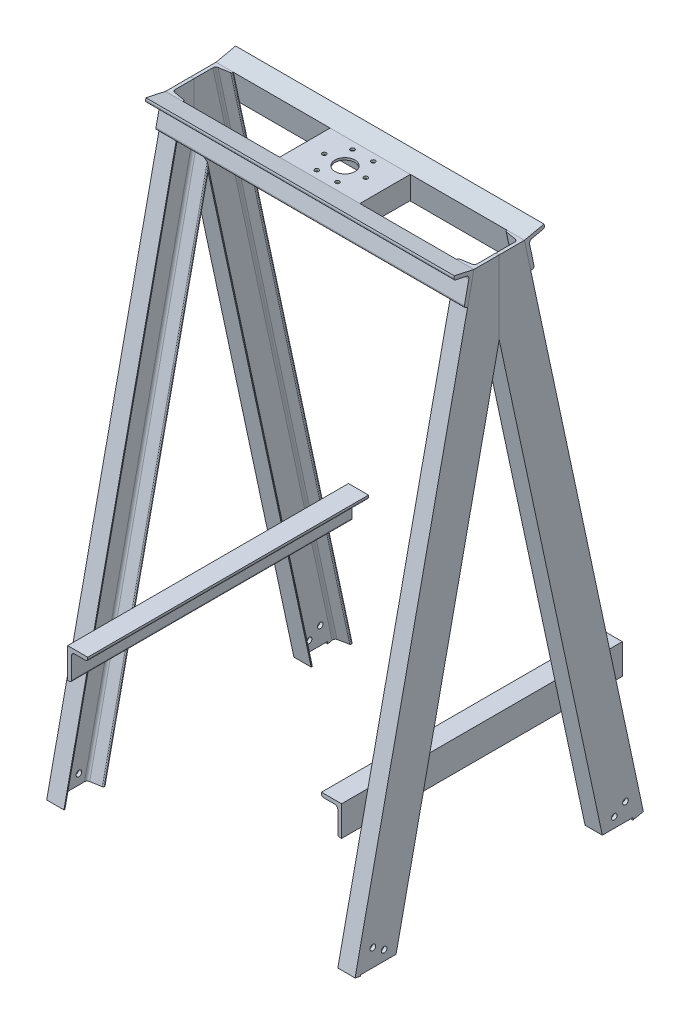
ISO-10303-21;
HEADER;
FILE_DESCRIPTION(('STEP AP214'),'2;1');
FILE_NAME('part.step','',(''),(''),'','','');
FILE_SCHEMA(('AUTOMOTIVE_DESIGN { 1 0 10303 214 1 1 1 1 }'));
ENDSEC;
DATA;
#1=APPLICATION_CONTEXT('core data for automotive mechanical design processes');
#2=APPLICATION_PROTOCOL_DEFINITION('international standard','automotive_design',2000,#1);
#3=PRODUCT_CONTEXT('',#1,'mechanical');
#4=PRODUCT('Part','Part','',(#3));
#5=PRODUCT_RELATED_PRODUCT_CATEGORY('part','',(#4));
#6=PRODUCT_DEFINITION_FORMATION('','',#4);
#7=PRODUCT_DEFINITION_CONTEXT('part definition',#1,'design');
#8=PRODUCT_DEFINITION('design','',#6,#7);
#9=PRODUCT_DEFINITION_SHAPE('','',#8);
#10=(LENGTH_UNIT() NAMED_UNIT(*) SI_UNIT(.MILLI.,.METRE.));
#11=(NAMED_UNIT(*) PLANE_ANGLE_UNIT() SI_UNIT($,.RADIAN.));
#12=(NAMED_UNIT(*) SI_UNIT($,.STERADIAN.) SOLID_ANGLE_UNIT());
#13=UNCERTAINTY_MEASURE_WITH_UNIT(LENGTH_MEASURE(1.E-05),#10,'distance_accuracy_value','');
#14=(GEOMETRIC_REPRESENTATION_CONTEXT(3) GLOBAL_UNCERTAINTY_ASSIGNED_CONTEXT((#13)) GLOBAL_UNIT_ASSIGNED_CONTEXT((#10,
#11,#12)) REPRESENTATION_CONTEXT('',''));
#15=CARTESIAN_POINT('',(0.,0.,0.));
#16=DIRECTION('',(0.,0.,1.));
#17=DIRECTION('',(1.,0.,0.));
#18=AXIS2_PLACEMENT_3D('',#15,#16,#17);
#19=CARTESIAN_POINT('',(101.6,1403.78210714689,-63.9404061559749));
#20=DIRECTION('',(0.,-1.,0.));
#21=DIRECTION('',(1.,0.,0.));
#22=AXIS2_PLACEMENT_3D('',#19,#20,#21);
#23=PLANE('',#22);
#24=CARTESIAN_POINT('',(-52.3874999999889,1403.78210714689,1.82157612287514E-13));
#25=DIRECTION('',(0.,1.,0.));
#26=DIRECTION('',(0.,0.,1.));
#27=AXIS2_PLACEMENT_3D('',#24,#25,#26);
#28=CIRCLE('',#27,5.159375);
#29=CARTESIAN_POINT('',(-52.3874999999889,1403.78210714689,5.15937500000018));
#30=VERTEX_POINT('',#29);
#31=EDGE_CURVE('E432',#30,#30,#28,.T.);
#32=ORIENTED_EDGE('',*,*,#31,.F.);
#33=EDGE_LOOP('',(#32));
#34=FACE_BOUND('',#33,.T.);
#35=CARTESIAN_POINT('',(4.90128186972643E-12,1403.78210714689,0.));
#36=DIRECTION('',(0.,1.,0.));
#37=DIRECTION('',(-1.,0.,0.));
#38=AXIS2_PLACEMENT_3D('',#35,#36,#37);
#39=CIRCLE('',#38,25.4000000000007);
#40=CARTESIAN_POINT('',(-25.3999999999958,1403.78210714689,0.));
#41=VERTEX_POINT('',#40);
#42=EDGE_CURVE('E438',#41,#41,#39,.T.);
#43=ORIENTED_EDGE('',*,*,#42,.F.);
#44=EDGE_LOOP('',(#43));
#45=FACE_BOUND('',#44,.T.);
#46=DIRECTION('',(1.,0.,0.));
#47=VECTOR('',#46,1.);
#48=CARTESIAN_POINT('',(101.6,1403.78210714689,63.940406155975));
#49=LINE('',#48,#47);
#50=CARTESIAN_POINT('',(-101.6,1403.78210714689,63.940406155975));
#51=VERTEX_POINT('',#50);
#52=CARTESIAN_POINT('',(101.6,1403.78210714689,63.940406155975));
#53=VERTEX_POINT('',#52);
#54=EDGE_CURVE('E240',#51,#53,#49,.T.);
#55=ORIENTED_EDGE('',*,*,#54,.T.);
#56=DIRECTION('',(0.,0.,1.));
#57=VECTOR('',#56,1.);
#58=CARTESIAN_POINT('',(101.6,1403.78210714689,-63.9404061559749));
#59=LINE('',#58,#57);
#60=CARTESIAN_POINT('',(101.6,1403.78210714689,-63.9404061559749));
#61=VERTEX_POINT('',#60);
#62=EDGE_CURVE('E293',#61,#53,#59,.T.);
#63=ORIENTED_EDGE('',*,*,#62,.F.);
#64=DIRECTION('',(1.,0.,0.));
#65=VECTOR('',#64,1.);
#66=CARTESIAN_POINT('',(101.6,1403.78210714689,-63.9404061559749));
#67=LINE('',#66,#65);
#68=CARTESIAN_POINT('',(-101.6,1403.78210714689,-63.9404061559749));
#69=VERTEX_POINT('',#68);
#70=EDGE_CURVE('E193',#69,#61,#67,.T.);
#71=ORIENTED_EDGE('',*,*,#70,.F.);
#72=DIRECTION('',(0.,0.,1.));
#73=VECTOR('',#72,1.);
#74=CARTESIAN_POINT('',(-101.6,1403.78210714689,-63.9404061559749));
#75=LINE('',#74,#73);
#76=EDGE_CURVE('E289',#69,#51,#75,.T.);
#77=ORIENTED_EDGE('',*,*,#76,.T.);
#78=EDGE_LOOP('',(#55,#63,#71,#77));
#79=FACE_BOUND('',#78,.T.);
#80=CARTESIAN_POINT('',(-26.1937499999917,1403.78210714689,45.368905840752));
#81=DIRECTION('',(0.,1.,0.));
#82=DIRECTION('',(0.,0.,1.));
#83=AXIS2_PLACEMENT_3D('',#80,#81,#82);
#84=CIRCLE('',#83,5.159375);
#85=CARTESIAN_POINT('',(-26.1937499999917,1403.78210714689,50.528280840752));
#86=VERTEX_POINT('',#85);
#87=EDGE_CURVE('E394',#86,#86,#84,.T.);
#88=ORIENTED_EDGE('',*,*,#87,.F.);
#89=EDGE_LOOP('',(#88));
#90=FACE_BOUND('',#89,.T.);
#91=CARTESIAN_POINT('',(26.1937500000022,1403.78210714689,45.3689058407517));
#92=DIRECTION('',(0.,1.,0.));
#93=DIRECTION('',(0.,0.,1.));
#94=AXIS2_PLACEMENT_3D('',#91,#92,#93);
#95=CIRCLE('',#94,5.159375);
#96=CARTESIAN_POINT('',(26.1937500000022,1403.78210714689,50.5282808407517));
#97=VERTEX_POINT('',#96);
#98=EDGE_CURVE('E398',#97,#97,#95,.T.);
#99=ORIENTED_EDGE('',*,*,#98,.F.);
#100=EDGE_LOOP('',(#99));
#101=FACE_BOUND('',#100,.T.);
#102=CARTESIAN_POINT('',(52.3874999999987,1403.78210714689,-5.4797778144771E-13));
#103=DIRECTION('',(0.,1.,0.));
#104=DIRECTION('',(0.,0.,1.));
#105=AXIS2_PLACEMENT_3D('',#102,#103,#104);
#106=CIRCLE('',#105,5.159375);
#107=CARTESIAN_POINT('',(52.3874999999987,1403.78210714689,5.15937499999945));
#108=VERTEX_POINT('',#107);
#109=EDGE_CURVE('E402',#108,#108,#106,.T.);
#110=ORIENTED_EDGE('',*,*,#109,.F.);
#111=EDGE_LOOP('',(#110));
#112=FACE_BOUND('',#111,.T.);
#113=CARTESIAN_POINT('',(26.1937500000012,1403.78210714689,-45.3689058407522));
#114=DIRECTION('',(0.,1.,0.));
#115=DIRECTION('',(0.,0.,1.));
#116=AXIS2_PLACEMENT_3D('',#113,#114,#115);
#117=CIRCLE('',#116,5.159375);
#118=CARTESIAN_POINT('',(26.1937500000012,1403.78210714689,-40.2095308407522));
#119=VERTEX_POINT('',#118);
#120=EDGE_CURVE('E406',#119,#119,#117,.T.);
#121=ORIENTED_EDGE('',*,*,#120,.F.);
#122=EDGE_LOOP('',(#121));
#123=FACE_BOUND('',#122,.T.);
#124=CARTESIAN_POINT('',(-26.1937499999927,1403.78210714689,-45.3689058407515));
#125=DIRECTION('',(0.,1.,0.));
#126=DIRECTION('',(0.,0.,1.));
#127=AXIS2_PLACEMENT_3D('',#124,#125,#126);
#128=CIRCLE('',#127,5.159375);
#129=CARTESIAN_POINT('',(-26.1937499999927,1403.78210714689,-40.2095308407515));
#130=VERTEX_POINT('',#129);
#131=EDGE_CURVE('E409',#130,#130,#128,.T.);
#132=ORIENTED_EDGE('',*,*,#131,.F.);
#133=EDGE_LOOP('',(#132));
#134=FACE_BOUND('',#133,.T.);
#135=ADVANCED_FACE('F176',(#34,#45,#79,#90,#101,#112,#123,#134),#23,.F.);
#136=CARTESIAN_POINT('',(101.6,1403.78210714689,-63.9404061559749));
#137=DIRECTION('',(-1.,0.,0.));
#138=DIRECTION('',(0.,-1.,0.));
#139=AXIS2_PLACEMENT_3D('',#136,#137,#138);
#140=PLANE('',#139);
#141=DIRECTION('',(0.,-1.,0.));
#142=VECTOR('',#141,1.);
#143=CARTESIAN_POINT('',(101.6,1403.78210714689,63.940406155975));
#144=LINE('',#143,#142);
#145=CARTESIAN_POINT('',(101.6,1346.37810714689,63.940406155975));
#146=VERTEX_POINT('',#145);
#147=EDGE_CURVE('E297',#53,#146,#144,.T.);
#148=ORIENTED_EDGE('',*,*,#147,.T.);
#149=DIRECTION('',(0.,0.,1.));
#150=VECTOR('',#149,1.);
#151=CARTESIAN_POINT('',(101.6,1346.37810714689,-63.9404061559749));
#152=LINE('',#151,#150);
#153=CARTESIAN_POINT('',(101.6,1346.37810714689,-63.9404061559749));
#154=VERTEX_POINT('',#153);
#155=EDGE_CURVE('E13',#154,#146,#152,.T.);
#156=ORIENTED_EDGE('',*,*,#155,.F.);
#157=DIRECTION('',(0.,-1.,0.));
#158=VECTOR('',#157,1.);
#159=CARTESIAN_POINT('',(101.6,1403.78210714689,-63.9404061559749));
#160=LINE('',#159,#158);
#161=EDGE_CURVE('E320',#61,#154,#160,.T.);
#162=ORIENTED_EDGE('',*,*,#161,.F.);
#163=ORIENTED_EDGE('',*,*,#62,.T.);
#164=EDGE_LOOP('',(#148,#156,#162,#163));
#165=FACE_BOUND('',#164,.T.);
#166=ADVANCED_FACE('F178',(#165),#140,.F.);
#167=CARTESIAN_POINT('',(101.6,1346.37810714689,-63.9404061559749));
#168=DIRECTION('',(0.,1.,0.));
#169=DIRECTION('',(-1.,0.,0.));
#170=AXIS2_PLACEMENT_3D('',#167,#168,#169);
#171=PLANE('',#170);
#172=DIRECTION('',(-1.,0.,0.));
#173=VECTOR('',#172,1.);
#174=CARTESIAN_POINT('',(101.6,1346.37810714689,63.940406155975));
#175=LINE('',#174,#173);
#176=CARTESIAN_POINT('',(98.8094950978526,1346.37810714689,63.940406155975));
#177=VERTEX_POINT('',#176);
#178=EDGE_CURVE('E300',#146,#177,#175,.T.);
#179=ORIENTED_EDGE('',*,*,#178,.T.);
#180=DIRECTION('',(0.,0.,1.));
#181=VECTOR('',#180,1.);
#182=CARTESIAN_POINT('',(98.8094950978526,1346.37810714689,-63.9404061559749));
#183=LINE('',#182,#181);
#184=CARTESIAN_POINT('',(98.8094950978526,1346.37810714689,-63.9404061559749));
#185=VERTEX_POINT('',#184);
#186=EDGE_CURVE('E185',#185,#177,#183,.T.);
#187=ORIENTED_EDGE('',*,*,#186,.F.);
#188=DIRECTION('',(-1.,0.,0.));
#189=VECTOR('',#188,1.);
#190=CARTESIAN_POINT('',(101.6,1346.37810714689,-63.9404061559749));
#191=LINE('',#190,#189);
#192=EDGE_CURVE('E248',#154,#185,#191,.T.);
#193=ORIENTED_EDGE('',*,*,#192,.F.);
#194=ORIENTED_EDGE('',*,*,#155,.T.);
#195=EDGE_LOOP('',(#179,#187,#193,#194));
#196=FACE_BOUND('',#195,.T.);
#197=ADVANCED_FACE('F470',(#196),#171,.F.);
#198=CARTESIAN_POINT('',(98.8094950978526,1349.68010714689,-63.9404061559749));
#199=DIRECTION('',(0.,0.,1.));
#200=DIRECTION('',(0.,-1.,0.));
#201=AXIS2_PLACEMENT_3D('',#198,#199,#200);
#202=CYLINDRICAL_SURFACE('',#201,3.30199999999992);
#203=CARTESIAN_POINT('',(98.8094950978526,1349.68010714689,63.940406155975));
#204=DIRECTION('',(0.,0.,-1.));
#205=DIRECTION('',(0.,1.,0.));
#206=AXIS2_PLACEMENT_3D('',#203,#204,#205);
#207=CIRCLE('',#206,3.30199999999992);
#208=CARTESIAN_POINT('',(95.5524287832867,1349.13722316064,63.940406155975));
#209=VERTEX_POINT('',#208);
#210=EDGE_CURVE('E303',#177,#209,#207,.T.);
#211=ORIENTED_EDGE('',*,*,#210,.T.);
#212=DIRECTION('',(0.,0.,1.));
#213=VECTOR('',#212,1.);
#214=CARTESIAN_POINT('',(95.5524287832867,1349.13722316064,-63.9404061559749));
#215=LINE('',#214,#213);
#216=CARTESIAN_POINT('',(95.5524287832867,1349.13722316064,-63.9404061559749));
#217=VERTEX_POINT('',#216);
#218=EDGE_CURVE('E339',#217,#209,#215,.T.);
#219=ORIENTED_EDGE('',*,*,#218,.F.);
#220=CARTESIAN_POINT('',(98.8094950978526,1349.68010714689,-63.9404061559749));
#221=DIRECTION('',(0.,0.,-1.));
#222=DIRECTION('',(0.,1.,0.));
#223=AXIS2_PLACEMENT_3D('',#220,#221,#222);
#224=CIRCLE('',#223,3.30199999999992);
#225=EDGE_CURVE('E347',#185,#217,#224,.T.);
#226=ORIENTED_EDGE('',*,*,#225,.F.);
#227=ORIENTED_EDGE('',*,*,#186,.T.);
#228=EDGE_LOOP('',(#211,#219,#226,#227));
#229=FACE_BOUND('',#228,.T.);
#230=ADVANCED_FACE('F345',(#229),#202,.T.);
#231=CARTESIAN_POINT('',(88.5077126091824,1391.40243695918,-63.9404061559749));
#232=DIRECTION('',(0.986391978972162,0.164410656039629,0.));
#233=DIRECTION('',(-0.164410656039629,0.986391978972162,0.));
#234=AXIS2_PLACEMENT_3D('',#231,#232,#233);
#235=PLANE('',#234);
#236=DIRECTION('',(-0.164410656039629,0.986391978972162,0.));
#237=VECTOR('',#236,1.);
#238=CARTESIAN_POINT('',(88.5077126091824,1391.40243695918,63.940406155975));
#239=LINE('',#238,#237);
#240=CARTESIAN_POINT('',(88.5077126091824,1391.40243695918,63.940406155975));
#241=VERTEX_POINT('',#240);
#242=EDGE_CURVE('E305',#209,#241,#239,.T.);
#243=ORIENTED_EDGE('',*,*,#242,.T.);
#244=DIRECTION('',(0.,0.,1.));
#245=VECTOR('',#244,1.);
#246=CARTESIAN_POINT('',(88.5077126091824,1391.40243695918,-63.9404061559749));
#247=LINE('',#246,#245);
#248=CARTESIAN_POINT('',(88.5077126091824,1391.40243695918,-63.9404061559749));
#249=VERTEX_POINT('',#248);
#250=EDGE_CURVE('E336',#249,#241,#247,.T.);
#251=ORIENTED_EDGE('',*,*,#250,.F.);
#252=DIRECTION('',(-0.164410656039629,0.986391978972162,0.));
#253=VECTOR('',#252,1.);
#254=CARTESIAN_POINT('',(88.5077126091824,1391.40243695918,-63.9404061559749));
#255=LINE('',#254,#253);
#256=EDGE_CURVE('E365',#217,#249,#255,.T.);
#257=ORIENTED_EDGE('',*,*,#256,.F.);
#258=ORIENTED_EDGE('',*,*,#218,.T.);
#259=EDGE_LOOP('',(#243,#251,#257,#258));
#260=FACE_BOUND('',#259,.T.);
#261=ADVANCED_FACE('F356',(#260),#235,.F.);
#262=CARTESIAN_POINT('',(80.4903186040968,1390.06610714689,-63.9404061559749));
#263=DIRECTION('',(0.,0.,1.));
#264=DIRECTION('',(0.,-1.,0.));
#265=AXIS2_PLACEMENT_3D('',#262,#263,#264);
#266=CYLINDRICAL_SURFACE('',#265,8.12799999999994);
#267=CARTESIAN_POINT('',(80.4903186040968,1390.06610714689,63.940406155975));
#268=DIRECTION('',(0.,0.,1.));
#269=DIRECTION('',(0.,1.,0.));
#270=AXIS2_PLACEMENT_3D('',#267,#268,#269);
#271=CIRCLE('',#270,8.12799999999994);
#272=CARTESIAN_POINT('',(80.4903186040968,1398.19410714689,63.940406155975));
#273=VERTEX_POINT('',#272);
#274=EDGE_CURVE('E307',#241,#273,#271,.T.);
#275=ORIENTED_EDGE('',*,*,#274,.T.);
#276=DIRECTION('',(0.,0.,1.));
#277=VECTOR('',#276,1.);
#278=CARTESIAN_POINT('',(80.4903186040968,1398.19410714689,-63.9404061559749));
#279=LINE('',#278,#277);
#280=CARTESIAN_POINT('',(80.4903186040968,1398.19410714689,-63.9404061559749));
#281=VERTEX_POINT('',#280);
#282=EDGE_CURVE('E333',#281,#273,#279,.T.);
#283=ORIENTED_EDGE('',*,*,#282,.F.);
#284=CARTESIAN_POINT('',(80.4903186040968,1390.06610714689,-63.9404061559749));
#285=DIRECTION('',(0.,0.,1.));
#286=DIRECTION('',(0.,1.,0.));
#287=AXIS2_PLACEMENT_3D('',#284,#285,#286);
#288=CIRCLE('',#287,8.12799999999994);
#289=EDGE_CURVE('E362',#249,#281,#288,.T.);
#290=ORIENTED_EDGE('',*,*,#289,.F.);
#291=ORIENTED_EDGE('',*,*,#250,.T.);
#292=EDGE_LOOP('',(#275,#283,#290,#291));
#293=FACE_BOUND('',#292,.T.);
#294=ADVANCED_FACE('F360',(#293),#266,.F.);
#295=CARTESIAN_POINT('',(-80.4903186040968,1398.19410714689,-63.9404061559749));
#296=DIRECTION('',(0.,1.,0.));
#297=DIRECTION('',(-1.,0.,0.));
#298=AXIS2_PLACEMENT_3D('',#295,#296,#297);
#299=PLANE('',#298);
#300=CARTESIAN_POINT('',(-26.1937499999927,1398.19410714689,-45.3689058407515));
#301=DIRECTION('',(0.,1.,0.));
#302=DIRECTION('',(-1.,0.,0.));
#303=AXIS2_PLACEMENT_3D('',#300,#301,#302);
#304=CIRCLE('',#303,5.159375);
#305=CARTESIAN_POINT('',(-31.3531249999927,1398.19410714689,-45.3689058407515));
#306=VERTEX_POINT('',#305);
#307=EDGE_CURVE('E411',#306,#306,#304,.T.);
#308=ORIENTED_EDGE('',*,*,#307,.T.);
#309=EDGE_LOOP('',(#308));
#310=FACE_BOUND('',#309,.T.);
#311=CARTESIAN_POINT('',(26.1937500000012,1398.19410714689,-45.3689058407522));
#312=DIRECTION('',(0.,1.,0.));
#313=DIRECTION('',(-1.,0.,0.));
#314=AXIS2_PLACEMENT_3D('',#311,#312,#313);
#315=CIRCLE('',#314,5.159375);
#316=CARTESIAN_POINT('',(21.0343750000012,1398.19410714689,-45.3689058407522));
#317=VERTEX_POINT('',#316);
#318=EDGE_CURVE('E417',#317,#317,#315,.T.);
#319=ORIENTED_EDGE('',*,*,#318,.T.);
#320=EDGE_LOOP('',(#319));
#321=FACE_BOUND('',#320,.T.);
#322=CARTESIAN_POINT('',(52.3874999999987,1398.19410714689,-5.4797778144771E-13));
#323=DIRECTION('',(0.,1.,0.));
#324=DIRECTION('',(-1.,0.,0.));
#325=AXIS2_PLACEMENT_3D('',#322,#323,#324);
#326=CIRCLE('',#325,5.159375);
#327=CARTESIAN_POINT('',(47.2281249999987,1398.19410714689,-5.4797778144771E-13));
#328=VERTEX_POINT('',#327);
#329=EDGE_CURVE('E421',#328,#328,#326,.T.);
#330=ORIENTED_EDGE('',*,*,#329,.T.);
#331=EDGE_LOOP('',(#330));
#332=FACE_BOUND('',#331,.T.);
#333=CARTESIAN_POINT('',(26.1937500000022,1398.19410714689,45.3689058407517));
#334=DIRECTION('',(0.,1.,0.));
#335=DIRECTION('',(-1.,0.,0.));
#336=AXIS2_PLACEMENT_3D('',#333,#334,#335);
#337=CIRCLE('',#336,5.159375);
#338=CARTESIAN_POINT('',(21.0343750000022,1398.19410714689,45.3689058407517));
#339=VERTEX_POINT('',#338);
#340=EDGE_CURVE('E425',#339,#339,#337,.T.);
#341=ORIENTED_EDGE('',*,*,#340,.T.);
#342=EDGE_LOOP('',(#341));
#343=FACE_BOUND('',#342,.T.);
#344=CARTESIAN_POINT('',(-26.1937499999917,1398.19410714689,45.368905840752));
#345=DIRECTION('',(0.,1.,0.));
#346=DIRECTION('',(-1.,0.,0.));
#347=AXIS2_PLACEMENT_3D('',#344,#345,#346);
#348=CIRCLE('',#347,5.159375);
#349=CARTESIAN_POINT('',(-31.3531249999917,1398.19410714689,45.368905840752));
#350=VERTEX_POINT('',#349);
#351=EDGE_CURVE('E429',#350,#350,#348,.T.);
#352=ORIENTED_EDGE('',*,*,#351,.T.);
#353=EDGE_LOOP('',(#352));
#354=FACE_BOUND('',#353,.T.);
#355=CARTESIAN_POINT('',(-52.3874999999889,1398.19410714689,1.82157612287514E-13));
#356=DIRECTION('',(0.,1.,0.));
#357=DIRECTION('',(-1.,0.,0.));
#358=AXIS2_PLACEMENT_3D('',#355,#356,#357);
#359=CIRCLE('',#358,5.159375);
#360=CARTESIAN_POINT('',(-57.5468749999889,1398.19410714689,1.82157612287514E-13));
#361=VERTEX_POINT('',#360);
#362=EDGE_CURVE('E435',#361,#361,#359,.T.);
#363=ORIENTED_EDGE('',*,*,#362,.T.);
#364=EDGE_LOOP('',(#363));
#365=FACE_BOUND('',#364,.T.);
#366=CARTESIAN_POINT('',(4.88177146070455E-12,1398.19410714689,0.));
#367=DIRECTION('',(0.,1.,0.));
#368=DIRECTION('',(-1.,0.,0.));
#369=AXIS2_PLACEMENT_3D('',#366,#367,#368);
#370=CIRCLE('',#369,25.4000000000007);
#371=CARTESIAN_POINT('',(-25.3999999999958,1398.19410714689,0.));
#372=VERTEX_POINT('',#371);
#373=EDGE_CURVE('E301',#372,#372,#370,.F.);
#374=ORIENTED_EDGE('',*,*,#373,.F.);
#375=EDGE_LOOP('',(#374));
#376=FACE_BOUND('',#375,.T.);
#377=DIRECTION('',(-1.,0.,0.));
#378=VECTOR('',#377,1.);
#379=CARTESIAN_POINT('',(-80.4903186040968,1398.19410714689,63.940406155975));
#380=LINE('',#379,#378);
#381=CARTESIAN_POINT('',(-80.4903186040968,1398.19410714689,63.940406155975));
#382=VERTEX_POINT('',#381);
#383=EDGE_CURVE('E309',#273,#382,#380,.T.);
#384=ORIENTED_EDGE('',*,*,#383,.T.);
#385=DIRECTION('',(0.,0.,1.));
#386=VECTOR('',#385,1.);
#387=CARTESIAN_POINT('',(-80.4903186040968,1398.19410714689,-63.9404061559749));
#388=LINE('',#387,#386);
#389=CARTESIAN_POINT('',(-80.4903186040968,1398.19410714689,-63.9404061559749));
#390=VERTEX_POINT('',#389);
#391=EDGE_CURVE('E330',#390,#382,#388,.T.);
#392=ORIENTED_EDGE('',*,*,#391,.F.);
#393=DIRECTION('',(-1.,0.,0.));
#394=VECTOR('',#393,1.);
#395=CARTESIAN_POINT('',(-80.4903186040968,1398.19410714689,-63.9404061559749));
#396=LINE('',#395,#394);
#397=EDGE_CURVE('E364',#281,#390,#396,.T.);
#398=ORIENTED_EDGE('',*,*,#397,.F.);
#399=ORIENTED_EDGE('',*,*,#282,.T.);
#400=EDGE_LOOP('',(#384,#392,#398,#399));
#401=FACE_BOUND('',#400,.T.);
#402=ADVANCED_FACE('F448',(#310,#321,#332,#343,#354,#365,#376,#401),#299,.F.);
#403=CARTESIAN_POINT('',(-80.4903186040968,1390.06610714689,-63.9404061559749));
#404=DIRECTION('',(0.,0.,1.));
#405=DIRECTION('',(0.,-1.,0.));
#406=AXIS2_PLACEMENT_3D('',#403,#404,#405);
#407=CYLINDRICAL_SURFACE('',#406,8.12800000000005);
#408=CARTESIAN_POINT('',(-80.4903186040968,1390.06610714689,63.940406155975));
#409=DIRECTION('',(0.,0.,1.));
#410=DIRECTION('',(0.,-1.,0.));
#411=AXIS2_PLACEMENT_3D('',#408,#409,#410);
#412=CIRCLE('',#411,8.12800000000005);
#413=CARTESIAN_POINT('',(-88.5077126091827,1391.40243695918,63.940406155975));
#414=VERTEX_POINT('',#413);
#415=EDGE_CURVE('E311',#382,#414,#412,.T.);
#416=ORIENTED_EDGE('',*,*,#415,.T.);
#417=DIRECTION('',(0.,0.,1.));
#418=VECTOR('',#417,1.);
#419=CARTESIAN_POINT('',(-88.5077126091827,1391.40243695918,-63.9404061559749));
#420=LINE('',#419,#418);
#421=CARTESIAN_POINT('',(-88.5077126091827,1391.40243695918,-63.9404061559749));
#422=VERTEX_POINT('',#421);
#423=EDGE_CURVE('E327',#422,#414,#420,.T.);
#424=ORIENTED_EDGE('',*,*,#423,.F.);
#425=CARTESIAN_POINT('',(-80.4903186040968,1390.06610714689,-63.9404061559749));
#426=DIRECTION('',(0.,0.,1.));
#427=DIRECTION('',(0.,-1.,0.));
#428=AXIS2_PLACEMENT_3D('',#425,#426,#427);
#429=CIRCLE('',#428,8.12800000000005);
#430=EDGE_CURVE('E367',#390,#422,#429,.T.);
#431=ORIENTED_EDGE('',*,*,#430,.F.);
#432=ORIENTED_EDGE('',*,*,#391,.T.);
#433=EDGE_LOOP('',(#416,#424,#431,#432));
#434=FACE_BOUND('',#433,.T.);
#435=ADVANCED_FACE('F451',(#434),#407,.F.);
#436=CARTESIAN_POINT('',(-88.5077126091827,1391.40243695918,-63.9404061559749));
#437=DIRECTION('',(-0.986391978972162,0.164410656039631,0.));
#438=DIRECTION('',(-0.164410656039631,-0.986391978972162,0.));
#439=AXIS2_PLACEMENT_3D('',#436,#437,#438);
#440=PLANE('',#439);
#441=DIRECTION('',(-0.164410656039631,-0.986391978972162,0.));
#442=VECTOR('',#441,1.);
#443=CARTESIAN_POINT('',(-88.5077126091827,1391.40243695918,63.940406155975));
#444=LINE('',#443,#442);
#445=CARTESIAN_POINT('',(-95.5524287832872,1349.13722316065,63.940406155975));
#446=VERTEX_POINT('',#445);
#447=EDGE_CURVE('E313',#414,#446,#444,.T.);
#448=ORIENTED_EDGE('',*,*,#447,.T.);
#449=DIRECTION('',(0.,0.,1.));
#450=VECTOR('',#449,1.);
#451=CARTESIAN_POINT('',(-95.5524287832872,1349.13722316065,-63.9404061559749));
#452=LINE('',#451,#450);
#453=CARTESIAN_POINT('',(-95.5524287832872,1349.13722316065,-63.9404061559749));
#454=VERTEX_POINT('',#453);
#455=EDGE_CURVE('E324',#454,#446,#452,.T.);
#456=ORIENTED_EDGE('',*,*,#455,.F.);
#457=DIRECTION('',(-0.164410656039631,-0.986391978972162,0.));
#458=VECTOR('',#457,1.);
#459=CARTESIAN_POINT('',(-88.5077126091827,1391.40243695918,-63.9404061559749));
#460=LINE('',#459,#458);
#461=EDGE_CURVE('E373',#422,#454,#460,.T.);
#462=ORIENTED_EDGE('',*,*,#461,.F.);
#463=ORIENTED_EDGE('',*,*,#423,.T.);
#464=EDGE_LOOP('',(#448,#456,#462,#463));
#465=FACE_BOUND('',#464,.T.);
#466=ADVANCED_FACE('F379',(#465),#440,.F.);
#467=CARTESIAN_POINT('',(-98.8094950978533,1349.68010714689,-63.9404061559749));
#468=DIRECTION('',(0.,0.,1.));
#469=DIRECTION('',(0.,-1.,0.));
#470=AXIS2_PLACEMENT_3D('',#467,#468,#469);
#471=CYLINDRICAL_SURFACE('',#470,3.30200000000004);
#472=CARTESIAN_POINT('',(-98.8094950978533,1349.68010714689,63.940406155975));
#473=DIRECTION('',(0.,0.,-1.));
#474=DIRECTION('',(0.,-1.,0.));
#475=AXIS2_PLACEMENT_3D('',#472,#473,#474);
#476=CIRCLE('',#475,3.30200000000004);
#477=CARTESIAN_POINT('',(-98.8094950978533,1346.37810714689,63.940406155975));
#478=VERTEX_POINT('',#477);
#479=EDGE_CURVE('E315',#446,#478,#476,.T.);
#480=ORIENTED_EDGE('',*,*,#479,.T.);
#481=DIRECTION('',(0.,0.,1.));
#482=VECTOR('',#481,1.);
#483=CARTESIAN_POINT('',(-98.8094950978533,1346.37810714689,-63.9404061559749));
#484=LINE('',#483,#482);
#485=CARTESIAN_POINT('',(-98.8094950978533,1346.37810714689,-63.9404061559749));
#486=VERTEX_POINT('',#485);
#487=EDGE_CURVE('E288',#486,#478,#484,.T.);
#488=ORIENTED_EDGE('',*,*,#487,.F.);
#489=CARTESIAN_POINT('',(-98.8094950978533,1349.68010714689,-63.9404061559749));
#490=DIRECTION('',(0.,0.,-1.));
#491=DIRECTION('',(0.,-1.,0.));
#492=AXIS2_PLACEMENT_3D('',#489,#490,#491);
#493=CIRCLE('',#492,3.30200000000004);
#494=EDGE_CURVE('E279',#454,#486,#493,.T.);
#495=ORIENTED_EDGE('',*,*,#494,.F.);
#496=ORIENTED_EDGE('',*,*,#455,.T.);
#497=EDGE_LOOP('',(#480,#488,#495,#496));
#498=FACE_BOUND('',#497,.T.);
#499=ADVANCED_FACE('F383',(#498),#471,.T.);
#500=CARTESIAN_POINT('',(-101.6,1346.37810714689,-63.9404061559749));
#501=DIRECTION('',(0.,1.,0.));
#502=DIRECTION('',(-1.,0.,0.));
#503=AXIS2_PLACEMENT_3D('',#500,#501,#502);
#504=PLANE('',#503);
#505=DIRECTION('',(-1.,0.,0.));
#506=VECTOR('',#505,1.);
#507=CARTESIAN_POINT('',(-101.6,1346.37810714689,63.940406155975));
#508=LINE('',#507,#506);
#509=CARTESIAN_POINT('',(-101.6,1346.37810714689,63.940406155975));
#510=VERTEX_POINT('',#509);
#511=EDGE_CURVE('E287',#478,#510,#508,.T.);
#512=ORIENTED_EDGE('',*,*,#511,.T.);
#513=DIRECTION('',(0.,0.,1.));
#514=VECTOR('',#513,1.);
#515=CARTESIAN_POINT('',(-101.6,1346.37810714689,-63.9404061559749));
#516=LINE('',#515,#514);
#517=CARTESIAN_POINT('',(-101.6,1346.37810714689,-63.9404061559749));
#518=VERTEX_POINT('',#517);
#519=EDGE_CURVE('E284',#518,#510,#516,.T.);
#520=ORIENTED_EDGE('',*,*,#519,.F.);
#521=DIRECTION('',(-1.,0.,0.));
#522=VECTOR('',#521,1.);
#523=CARTESIAN_POINT('',(-101.6,1346.37810714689,-63.9404061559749));
#524=LINE('',#523,#522);
#525=EDGE_CURVE('E273',#486,#518,#524,.T.);
#526=ORIENTED_EDGE('',*,*,#525,.F.);
#527=ORIENTED_EDGE('',*,*,#487,.T.);
#528=EDGE_LOOP('',(#512,#520,#526,#527));
#529=FACE_BOUND('',#528,.T.);
#530=ADVANCED_FACE('F285',(#529),#504,.F.);
#531=CARTESIAN_POINT('',(-101.6,1403.78210714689,-63.9404061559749));
#532=DIRECTION('',(1.,0.,0.));
#533=DIRECTION('',(0.,1.,0.));
#534=AXIS2_PLACEMENT_3D('',#531,#532,#533);
#535=PLANE('',#534);
#536=DIRECTION('',(0.,1.,0.));
#537=VECTOR('',#536,1.);
#538=CARTESIAN_POINT('',(-101.6,1403.78210714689,63.940406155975));
#539=LINE('',#538,#537);
#540=EDGE_CURVE('E234',#510,#51,#539,.T.);
#541=ORIENTED_EDGE('',*,*,#540,.T.);
#542=ORIENTED_EDGE('',*,*,#76,.F.);
#543=DIRECTION('',(0.,1.,0.));
#544=VECTOR('',#543,1.);
#545=CARTESIAN_POINT('',(-101.6,1403.78210714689,-63.9404061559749));
#546=LINE('',#545,#544);
#547=EDGE_CURVE('E277',#518,#69,#546,.T.);
#548=ORIENTED_EDGE('',*,*,#547,.F.);
#549=ORIENTED_EDGE('',*,*,#519,.T.);
#550=EDGE_LOOP('',(#541,#542,#548,#549));
#551=FACE_BOUND('',#550,.T.);
#552=ADVANCED_FACE('F291',(#551),#535,.F.);
#553=CARTESIAN_POINT('',(98.8094950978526,1349.68010714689,-63.9404061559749));
#554=DIRECTION('',(0.,0.,-1.));
#555=DIRECTION('',(0.,1.,0.));
#556=AXIS2_PLACEMENT_3D('',#553,#554,#555);
#557=PLANE('',#556);
#558=ORIENTED_EDGE('',*,*,#161,.T.);
#559=ORIENTED_EDGE('',*,*,#192,.T.);
#560=ORIENTED_EDGE('',*,*,#225,.T.);
#561=ORIENTED_EDGE('',*,*,#256,.T.);
#562=ORIENTED_EDGE('',*,*,#289,.T.);
#563=ORIENTED_EDGE('',*,*,#397,.T.);
#564=ORIENTED_EDGE('',*,*,#430,.T.);
#565=ORIENTED_EDGE('',*,*,#461,.T.);
#566=ORIENTED_EDGE('',*,*,#494,.T.);
#567=ORIENTED_EDGE('',*,*,#525,.T.);
#568=ORIENTED_EDGE('',*,*,#547,.T.);
#569=ORIENTED_EDGE('',*,*,#70,.T.);
#570=EDGE_LOOP('',(#558,#559,#560,#561,#562,#563,#564,#565,#566,#567,#568,#569));
#571=FACE_BOUND('',#570,.T.);
#572=ADVANCED_FACE('F275',(#571),#557,.T.);
#573=CARTESIAN_POINT('',(98.8094950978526,1349.68010714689,63.940406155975));
#574=DIRECTION('',(0.,0.,-1.));
#575=DIRECTION('',(0.,1.,0.));
#576=AXIS2_PLACEMENT_3D('',#573,#574,#575);
#577=PLANE('',#576);
#578=ORIENTED_EDGE('',*,*,#147,.F.);
#579=ORIENTED_EDGE('',*,*,#54,.F.);
#580=ORIENTED_EDGE('',*,*,#540,.F.);
#581=ORIENTED_EDGE('',*,*,#511,.F.);
#582=ORIENTED_EDGE('',*,*,#479,.F.);
#583=ORIENTED_EDGE('',*,*,#447,.F.);
#584=ORIENTED_EDGE('',*,*,#415,.F.);
#585=ORIENTED_EDGE('',*,*,#383,.F.);
#586=ORIENTED_EDGE('',*,*,#274,.F.);
#587=ORIENTED_EDGE('',*,*,#242,.F.);
#588=ORIENTED_EDGE('',*,*,#210,.F.);
#589=ORIENTED_EDGE('',*,*,#178,.F.);
#590=EDGE_LOOP('',(#578,#579,#580,#581,#582,#583,#584,#585,#586,#587,#588,#589));
#591=FACE_BOUND('',#590,.T.);
#592=ADVANCED_FACE('F351',(#591),#577,.F.);
#593=CARTESIAN_POINT('',(0.,-21.3144687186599,0.));
#594=DIRECTION('',(0.,1.,0.));
#595=DIRECTION('',(-1.,0.,0.));
#596=AXIS2_PLACEMENT_3D('',#593,#594,#595);
#597=CYLINDRICAL_SURFACE('',#596,25.4000000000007);
#598=ORIENTED_EDGE('',*,*,#42,.T.);
#599=EDGE_LOOP('',(#598));
#600=FACE_BOUND('',#599,.T.);
#601=ORIENTED_EDGE('',*,*,#373,.T.);
#602=EDGE_LOOP('',(#601));
#603=FACE_BOUND('',#602,.T.);
#604=ADVANCED_FACE('F446',(#600,#603),#597,.F.);
#605=CARTESIAN_POINT('',(-52.3874999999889,1403.78210714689,1.82157612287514E-13));
#606=DIRECTION('',(0.,1.,0.));
#607=DIRECTION('',(0.,0.,1.));
#608=AXIS2_PLACEMENT_3D('',#605,#606,#607);
#609=CYLINDRICAL_SURFACE('',#608,5.159375);
#610=ORIENTED_EDGE('',*,*,#362,.F.);
#611=EDGE_LOOP('',(#610));
#612=FACE_BOUND('',#611,.T.);
#613=ORIENTED_EDGE('',*,*,#31,.T.);
#614=EDGE_LOOP('',(#613));
#615=FACE_BOUND('',#614,.T.);
#616=ADVANCED_FACE('F490',(#612,#615),#609,.F.);
#617=CARTESIAN_POINT('',(-26.1937499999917,1403.78210714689,45.368905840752));
#618=DIRECTION('',(0.,1.,0.));
#619=DIRECTION('',(0.,0.,1.));
#620=AXIS2_PLACEMENT_3D('',#617,#618,#619);
#621=CYLINDRICAL_SURFACE('',#620,5.159375);
#622=ORIENTED_EDGE('',*,*,#351,.F.);
#623=EDGE_LOOP('',(#622));
#624=FACE_BOUND('',#623,.T.);
#625=ORIENTED_EDGE('',*,*,#87,.T.);
#626=EDGE_LOOP('',(#625));
#627=FACE_BOUND('',#626,.T.);
#628=ADVANCED_FACE('F503',(#624,#627),#621,.F.);
#629=CARTESIAN_POINT('',(26.1937500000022,1403.78210714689,45.3689058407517));
#630=DIRECTION('',(0.,1.,0.));
#631=DIRECTION('',(0.,0.,1.));
#632=AXIS2_PLACEMENT_3D('',#629,#630,#631);
#633=CYLINDRICAL_SURFACE('',#632,5.159375);
#634=ORIENTED_EDGE('',*,*,#340,.F.);
#635=EDGE_LOOP('',(#634));
#636=FACE_BOUND('',#635,.T.);
#637=ORIENTED_EDGE('',*,*,#98,.T.);
#638=EDGE_LOOP('',(#637));
#639=FACE_BOUND('',#638,.T.);
#640=ADVANCED_FACE('F507',(#636,#639),#633,.F.);
#641=CARTESIAN_POINT('',(52.3874999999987,1403.78210714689,-5.4797778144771E-13));
#642=DIRECTION('',(0.,1.,0.));
#643=DIRECTION('',(0.,0.,1.));
#644=AXIS2_PLACEMENT_3D('',#641,#642,#643);
#645=CYLINDRICAL_SURFACE('',#644,5.159375);
#646=ORIENTED_EDGE('',*,*,#329,.F.);
#647=EDGE_LOOP('',(#646));
#648=FACE_BOUND('',#647,.T.);
#649=ORIENTED_EDGE('',*,*,#109,.T.);
#650=EDGE_LOOP('',(#649));
#651=FACE_BOUND('',#650,.T.);
#652=ADVANCED_FACE('F517',(#648,#651),#645,.F.);
#653=CARTESIAN_POINT('',(26.1937500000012,1403.78210714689,-45.3689058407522));
#654=DIRECTION('',(0.,1.,0.));
#655=DIRECTION('',(0.,0.,1.));
#656=AXIS2_PLACEMENT_3D('',#653,#654,#655);
#657=CYLINDRICAL_SURFACE('',#656,5.159375);
#658=ORIENTED_EDGE('',*,*,#318,.F.);
#659=EDGE_LOOP('',(#658));
#660=FACE_BOUND('',#659,.T.);
#661=ORIENTED_EDGE('',*,*,#120,.T.);
#662=EDGE_LOOP('',(#661));
#663=FACE_BOUND('',#662,.T.);
#664=ADVANCED_FACE('F527',(#660,#663),#657,.F.);
#665=CARTESIAN_POINT('',(-26.1937499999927,1403.78210714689,-45.3689058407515));
#666=DIRECTION('',(0.,1.,0.));
#667=DIRECTION('',(0.,0.,1.));
#668=AXIS2_PLACEMENT_3D('',#665,#666,#667);
#669=CYLINDRICAL_SURFACE('',#668,5.159375);
#670=ORIENTED_EDGE('',*,*,#307,.F.);
#671=EDGE_LOOP('',(#670));
#672=FACE_BOUND('',#671,.T.);
#673=ORIENTED_EDGE('',*,*,#131,.T.);
#674=EDGE_LOOP('',(#673));
#675=FACE_BOUND('',#674,.T.);
#676=ADVANCED_FACE('F537',(#672,#675),#669,.F.);
#677=CLOSED_SHELL('',(#135,#166,#197,#230,#261,#294,#402,#435,#466,#499,#530,#552,#572,#592,
#604,#616,#628,#640,#652,#664,#676));
#678=MANIFOLD_SOLID_BREP('B2',#677);
#679=CARTESIAN_POINT('',(296.071689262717,355.6,-355.6));
#680=DIRECTION('',(0.,1.,0.));
#681=DIRECTION('',(-1.,0.,0.));
#682=AXIS2_PLACEMENT_3D('',#679,#680,#681);
#683=PLANE('',#682);
#684=DIRECTION('',(-1.,0.,0.));
#685=VECTOR('',#684,1.);
#686=CARTESIAN_POINT('',(296.071689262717,355.6,355.6));
#687=LINE('',#686,#685);
#688=CARTESIAN_POINT('',(346.871689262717,355.6,355.6));
#689=VERTEX_POINT('',#688);
#690=CARTESIAN_POINT('',(296.071689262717,355.6,355.6));
#691=VERTEX_POINT('',#690);
#692=EDGE_CURVE('E796',#689,#691,#687,.T.);
#693=ORIENTED_EDGE('',*,*,#692,.F.);
#694=DIRECTION('',(0.,0.,1.));
#695=VECTOR('',#694,1.);
#696=CARTESIAN_POINT('',(346.871689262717,355.6,-355.6));
#697=LINE('',#696,#695);
#698=CARTESIAN_POINT('',(346.871689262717,355.6,-355.6));
#699=VERTEX_POINT('',#698);
#700=EDGE_CURVE('E174',#699,#689,#697,.T.);
#701=ORIENTED_EDGE('',*,*,#700,.F.);
#702=DIRECTION('',(-1.,0.,0.));
#703=VECTOR('',#702,1.);
#704=CARTESIAN_POINT('',(296.071689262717,355.6,-355.6));
#705=LINE('',#704,#703);
#706=CARTESIAN_POINT('',(296.071689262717,355.6,-355.6));
#707=VERTEX_POINT('',#706);
#708=EDGE_CURVE('E819',#699,#707,#705,.T.);
#709=ORIENTED_EDGE('',*,*,#708,.T.);
#710=DIRECTION('',(0.,0.,1.));
#711=VECTOR('',#710,1.);
#712=CARTESIAN_POINT('',(296.071689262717,355.6,-355.6));
#713=LINE('',#712,#711);
#714=EDGE_CURVE('E696',#707,#691,#713,.T.);
#715=ORIENTED_EDGE('',*,*,#714,.T.);
#716=EDGE_LOOP('',(#693,#701,#709,#715));
#717=FACE_BOUND('',#716,.T.);
#718=ADVANCED_FACE('F693',(#717),#683,.T.);
#719=CARTESIAN_POINT('',(346.871689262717,355.6,-355.6));
#720=DIRECTION('',(1.,0.,0.));
#721=DIRECTION('',(0.,1.,0.));
#722=AXIS2_PLACEMENT_3D('',#719,#720,#721);
#723=PLANE('',#722);
#724=DIRECTION('',(0.,1.,0.));
#725=VECTOR('',#724,1.);
#726=CARTESIAN_POINT('',(346.871689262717,355.6,355.6));
#727=LINE('',#726,#725);
#728=CARTESIAN_POINT('',(346.871689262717,279.4,355.600000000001));
#729=VERTEX_POINT('',#728);
#730=EDGE_CURVE('E817',#729,#689,#727,.T.);
#731=ORIENTED_EDGE('',*,*,#730,.F.);
#732=DIRECTION('',(0.,0.,1.));
#733=VECTOR('',#732,1.);
#734=CARTESIAN_POINT('',(346.871689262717,279.4,-355.599999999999));
#735=LINE('',#734,#733);
#736=CARTESIAN_POINT('',(346.871689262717,279.4,-355.599999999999));
#737=VERTEX_POINT('',#736);
#738=EDGE_CURVE('E702',#737,#729,#735,.T.);
#739=ORIENTED_EDGE('',*,*,#738,.F.);
#740=DIRECTION('',(0.,1.,0.));
#741=VECTOR('',#740,1.);
#742=CARTESIAN_POINT('',(346.871689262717,355.6,-355.6));
#743=LINE('',#742,#741);
#744=EDGE_CURVE('E786',#737,#699,#743,.T.);
#745=ORIENTED_EDGE('',*,*,#744,.T.);
#746=ORIENTED_EDGE('',*,*,#700,.T.);
#747=EDGE_LOOP('',(#731,#739,#745,#746));
#748=FACE_BOUND('',#747,.T.);
#749=ADVANCED_FACE('F833',(#748),#723,.T.);
#750=CARTESIAN_POINT('',(346.871689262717,279.4,-355.599999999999));
#751=DIRECTION('',(0.,-1.,0.));
#752=DIRECTION('',(1.,0.,0.));
#753=AXIS2_PLACEMENT_3D('',#750,#751,#752);
#754=PLANE('',#753);
#755=DIRECTION('',(1.,0.,0.));
#756=VECTOR('',#755,1.);
#757=CARTESIAN_POINT('',(346.871689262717,279.4,355.600000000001));
#758=LINE('',#757,#756);
#759=CARTESIAN_POINT('',(342.116809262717,279.4,355.600000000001));
#760=VERTEX_POINT('',#759);
#761=EDGE_CURVE('E773',#760,#729,#758,.T.);
#762=ORIENTED_EDGE('',*,*,#761,.F.);
#763=DIRECTION('',(0.,0.,1.));
#764=VECTOR('',#763,1.);
#765=CARTESIAN_POINT('',(342.116809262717,279.4,-355.599999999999));
#766=LINE('',#765,#764);
#767=CARTESIAN_POINT('',(342.116809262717,279.4,-355.599999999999));
#768=VERTEX_POINT('',#767);
#769=EDGE_CURVE('E768',#768,#760,#766,.T.);
#770=ORIENTED_EDGE('',*,*,#769,.F.);
#771=DIRECTION('',(1.,0.,0.));
#772=VECTOR('',#771,1.);
#773=CARTESIAN_POINT('',(346.871689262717,279.4,-355.599999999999));
#774=LINE('',#773,#772);
#775=EDGE_CURVE('E771',#768,#737,#774,.T.);
#776=ORIENTED_EDGE('',*,*,#775,.T.);
#777=ORIENTED_EDGE('',*,*,#738,.T.);
#778=EDGE_LOOP('',(#762,#770,#776,#777));
#779=FACE_BOUND('',#778,.T.);
#780=ADVANCED_FACE('F770',(#779),#754,.T.);
#781=CARTESIAN_POINT('',(342.116809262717,284.17012,-355.599999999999));
#782=DIRECTION('',(0.,0.,1.));
#783=DIRECTION('',(1.,0.,0.));
#784=AXIS2_PLACEMENT_3D('',#781,#782,#783);
#785=CYLINDRICAL_SURFACE('',#784,4.77011999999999);
#786=CARTESIAN_POINT('',(342.116809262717,284.17012,355.600000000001));
#787=DIRECTION('',(0.,0.,1.));
#788=DIRECTION('',(-1.,0.,0.));
#789=AXIS2_PLACEMENT_3D('',#786,#787,#788);
#790=CIRCLE('',#789,4.77011999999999);
#791=CARTESIAN_POINT('',(337.346689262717,284.17012,355.600000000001));
#792=VERTEX_POINT('',#791);
#793=EDGE_CURVE('E814',#792,#760,#790,.T.);
#794=ORIENTED_EDGE('',*,*,#793,.F.);
#795=DIRECTION('',(0.,0.,1.));
#796=VECTOR('',#795,1.);
#797=CARTESIAN_POINT('',(337.346689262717,284.17012,-355.599999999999));
#798=LINE('',#797,#796);
#799=CARTESIAN_POINT('',(337.346689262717,284.17012,-355.599999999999));
#800=VERTEX_POINT('',#799);
#801=EDGE_CURVE('E778',#800,#792,#798,.T.);
#802=ORIENTED_EDGE('',*,*,#801,.F.);
#803=CARTESIAN_POINT('',(342.116809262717,284.17012,-355.599999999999));
#804=DIRECTION('',(0.,0.,1.));
#805=DIRECTION('',(-1.,0.,0.));
#806=AXIS2_PLACEMENT_3D('',#803,#804,#805);
#807=CIRCLE('',#806,4.77011999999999);
#808=EDGE_CURVE('E784',#800,#768,#807,.T.);
#809=ORIENTED_EDGE('',*,*,#808,.T.);
#810=ORIENTED_EDGE('',*,*,#769,.T.);
#811=EDGE_LOOP('',(#794,#802,#809,#810));
#812=FACE_BOUND('',#811,.T.);
#813=ADVANCED_FACE('F788',(#812),#785,.T.);
#814=CARTESIAN_POINT('',(337.346689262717,284.17012,-355.599999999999));
#815=DIRECTION('',(-1.,0.,0.));
#816=DIRECTION('',(0.,-1.,0.));
#817=AXIS2_PLACEMENT_3D('',#814,#815,#816);
#818=PLANE('',#817);
#819=DIRECTION('',(0.,-1.,0.));
#820=VECTOR('',#819,1.);
#821=CARTESIAN_POINT('',(337.346689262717,284.17012,355.600000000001));
#822=LINE('',#821,#820);
#823=CARTESIAN_POINT('',(337.346689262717,338.1248,355.6));
#824=VERTEX_POINT('',#823);
#825=EDGE_CURVE('E811',#824,#792,#822,.T.);
#826=ORIENTED_EDGE('',*,*,#825,.F.);
#827=DIRECTION('',(0.,0.,1.));
#828=VECTOR('',#827,1.);
#829=CARTESIAN_POINT('',(337.346689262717,338.1248,-355.6));
#830=LINE('',#829,#828);
#831=CARTESIAN_POINT('',(337.346689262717,338.1248,-355.6));
#832=VERTEX_POINT('',#831);
#833=EDGE_CURVE('E823',#832,#824,#830,.T.);
#834=ORIENTED_EDGE('',*,*,#833,.F.);
#835=DIRECTION('',(0.,-1.,0.));
#836=VECTOR('',#835,1.);
#837=CARTESIAN_POINT('',(337.346689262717,284.17012,-355.599999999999));
#838=LINE('',#837,#836);
#839=EDGE_CURVE('E789',#832,#800,#838,.T.);
#840=ORIENTED_EDGE('',*,*,#839,.T.);
#841=ORIENTED_EDGE('',*,*,#801,.T.);
#842=EDGE_LOOP('',(#826,#834,#840,#841));
#843=FACE_BOUND('',#842,.T.);
#844=ADVANCED_FACE('F846',(#843),#818,.T.);
#845=CARTESIAN_POINT('',(329.396489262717,338.1248,-355.6));
#846=DIRECTION('',(0.,0.,1.));
#847=DIRECTION('',(1.,0.,0.));
#848=AXIS2_PLACEMENT_3D('',#845,#846,#847);
#849=CYLINDRICAL_SURFACE('',#848,7.95019999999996);
#850=CARTESIAN_POINT('',(329.396489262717,338.1248,355.6));
#851=DIRECTION('',(0.,0.,-1.));
#852=DIRECTION('',(-1.,0.,0.));
#853=AXIS2_PLACEMENT_3D('',#850,#851,#852);
#854=CIRCLE('',#853,7.95019999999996);
#855=CARTESIAN_POINT('',(329.396489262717,346.075,355.6));
#856=VERTEX_POINT('',#855);
#857=EDGE_CURVE('E808',#856,#824,#854,.T.);
#858=ORIENTED_EDGE('',*,*,#857,.F.);
#859=DIRECTION('',(0.,0.,1.));
#860=VECTOR('',#859,1.);
#861=CARTESIAN_POINT('',(329.396489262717,346.075,-355.6));
#862=LINE('',#861,#860);
#863=CARTESIAN_POINT('',(329.396489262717,346.075,-355.6));
#864=VERTEX_POINT('',#863);
#865=EDGE_CURVE('E825',#864,#856,#862,.T.);
#866=ORIENTED_EDGE('',*,*,#865,.F.);
#867=CARTESIAN_POINT('',(329.396489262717,338.1248,-355.6));
#868=DIRECTION('',(0.,0.,-1.));
#869=DIRECTION('',(-1.,0.,0.));
#870=AXIS2_PLACEMENT_3D('',#867,#868,#869);
#871=CIRCLE('',#870,7.95019999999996);
#872=EDGE_CURVE('E791',#864,#832,#871,.T.);
#873=ORIENTED_EDGE('',*,*,#872,.T.);
#874=ORIENTED_EDGE('',*,*,#833,.T.);
#875=EDGE_LOOP('',(#858,#866,#873,#874));
#876=FACE_BOUND('',#875,.T.);
#877=ADVANCED_FACE('F849',(#876),#849,.F.);
#878=CARTESIAN_POINT('',(329.396489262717,346.075,-355.6));
#879=DIRECTION('',(0.,-1.,0.));
#880=DIRECTION('',(1.,0.,0.));
#881=AXIS2_PLACEMENT_3D('',#878,#879,#880);
#882=PLANE('',#881);
#883=DIRECTION('',(1.,0.,0.));
#884=VECTOR('',#883,1.);
#885=CARTESIAN_POINT('',(329.396489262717,346.075,355.6));
#886=LINE('',#885,#884);
#887=CARTESIAN_POINT('',(300.841809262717,346.075,355.6));
#888=VERTEX_POINT('',#887);
#889=EDGE_CURVE('E805',#888,#856,#886,.T.);
#890=ORIENTED_EDGE('',*,*,#889,.F.);
#891=DIRECTION('',(0.,0.,1.));
#892=VECTOR('',#891,1.);
#893=CARTESIAN_POINT('',(300.841809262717,346.075,-355.6));
#894=LINE('',#893,#892);
#895=CARTESIAN_POINT('',(300.841809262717,346.075,-355.6));
#896=VERTEX_POINT('',#895);
#897=EDGE_CURVE('E827',#896,#888,#894,.T.);
#898=ORIENTED_EDGE('',*,*,#897,.F.);
#899=DIRECTION('',(1.,0.,0.));
#900=VECTOR('',#899,1.);
#901=CARTESIAN_POINT('',(329.396489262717,346.075,-355.6));
#902=LINE('',#901,#900);
#903=EDGE_CURVE('E956',#896,#864,#902,.T.);
#904=ORIENTED_EDGE('',*,*,#903,.T.);
#905=ORIENTED_EDGE('',*,*,#865,.T.);
#906=EDGE_LOOP('',(#890,#898,#904,#905));
#907=FACE_BOUND('',#906,.T.);
#908=ADVANCED_FACE('F853',(#907),#882,.T.);
#909=CARTESIAN_POINT('',(300.841809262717,350.84512,-355.6));
#910=DIRECTION('',(0.,0.,1.));
#911=DIRECTION('',(1.,0.,0.));
#912=AXIS2_PLACEMENT_3D('',#909,#910,#911);
#913=CYLINDRICAL_SURFACE('',#912,4.77011999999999);
#914=CARTESIAN_POINT('',(300.841809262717,350.84512,355.6));
#915=DIRECTION('',(0.,0.,1.));
#916=DIRECTION('',(1.,0.,0.));
#917=AXIS2_PLACEMENT_3D('',#914,#915,#916);
#918=CIRCLE('',#917,4.77011999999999);
#919=CARTESIAN_POINT('',(296.071689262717,350.84512,355.6));
#920=VERTEX_POINT('',#919);
#921=EDGE_CURVE('E802',#920,#888,#918,.T.);
#922=ORIENTED_EDGE('',*,*,#921,.F.);
#923=DIRECTION('',(0.,0.,1.));
#924=VECTOR('',#923,1.);
#925=CARTESIAN_POINT('',(296.071689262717,350.84512,-355.6));
#926=LINE('',#925,#924);
#927=CARTESIAN_POINT('',(296.071689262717,350.84512,-355.6));
#928=VERTEX_POINT('',#927);
#929=EDGE_CURVE('E828',#928,#920,#926,.T.);
#930=ORIENTED_EDGE('',*,*,#929,.F.);
#931=CARTESIAN_POINT('',(300.841809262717,350.84512,-355.6));
#932=DIRECTION('',(0.,0.,1.));
#933=DIRECTION('',(1.,0.,0.));
#934=AXIS2_PLACEMENT_3D('',#931,#932,#933);
#935=CIRCLE('',#934,4.77011999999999);
#936=EDGE_CURVE('E960',#928,#896,#935,.T.);
#937=ORIENTED_EDGE('',*,*,#936,.T.);
#938=ORIENTED_EDGE('',*,*,#897,.T.);
#939=EDGE_LOOP('',(#922,#930,#937,#938));
#940=FACE_BOUND('',#939,.T.);
#941=ADVANCED_FACE('F857',(#940),#913,.T.);
#942=CARTESIAN_POINT('',(296.071689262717,350.84512,-355.6));
#943=DIRECTION('',(-1.,0.,0.));
#944=DIRECTION('',(0.,-1.,0.));
#945=AXIS2_PLACEMENT_3D('',#942,#943,#944);
#946=PLANE('',#945);
#947=DIRECTION('',(0.,-1.,0.));
#948=VECTOR('',#947,1.);
#949=CARTESIAN_POINT('',(296.071689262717,350.84512,355.6));
#950=LINE('',#949,#948);
#951=EDGE_CURVE('E799',#691,#920,#950,.T.);
#952=ORIENTED_EDGE('',*,*,#951,.F.);
#953=ORIENTED_EDGE('',*,*,#714,.F.);
#954=DIRECTION('',(0.,-1.,0.));
#955=VECTOR('',#954,1.);
#956=CARTESIAN_POINT('',(296.071689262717,350.84512,-355.6));
#957=LINE('',#956,#955);
#958=EDGE_CURVE('E964',#707,#928,#957,.T.);
#959=ORIENTED_EDGE('',*,*,#958,.T.);
#960=ORIENTED_EDGE('',*,*,#929,.T.);
#961=EDGE_LOOP('',(#952,#953,#959,#960));
#962=FACE_BOUND('',#961,.T.);
#963=ADVANCED_FACE('F830',(#962),#946,.T.);
#964=CARTESIAN_POINT('',(342.116809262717,284.17012,-355.599999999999));
#965=DIRECTION('',(0.,0.,-1.));
#966=DIRECTION('',(-1.,0.,0.));
#967=AXIS2_PLACEMENT_3D('',#964,#965,#966);
#968=PLANE('',#967);
#969=ORIENTED_EDGE('',*,*,#708,.F.);
#970=ORIENTED_EDGE('',*,*,#744,.F.);
#971=ORIENTED_EDGE('',*,*,#775,.F.);
#972=ORIENTED_EDGE('',*,*,#808,.F.);
#973=ORIENTED_EDGE('',*,*,#839,.F.);
#974=ORIENTED_EDGE('',*,*,#872,.F.);
#975=ORIENTED_EDGE('',*,*,#903,.F.);
#976=ORIENTED_EDGE('',*,*,#936,.F.);
#977=ORIENTED_EDGE('',*,*,#958,.F.);
#978=EDGE_LOOP('',(#969,#970,#971,#972,#973,#974,#975,#976,#977));
#979=FACE_BOUND('',#978,.T.);
#980=ADVANCED_FACE('F782',(#979),#968,.T.);
#981=CARTESIAN_POINT('',(342.116809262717,284.17012,355.600000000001));
#982=DIRECTION('',(0.,0.,-1.));
#983=DIRECTION('',(-1.,0.,0.));
#984=AXIS2_PLACEMENT_3D('',#981,#982,#983);
#985=PLANE('',#984);
#986=ORIENTED_EDGE('',*,*,#692,.T.);
#987=ORIENTED_EDGE('',*,*,#951,.T.);
#988=ORIENTED_EDGE('',*,*,#921,.T.);
#989=ORIENTED_EDGE('',*,*,#889,.T.);
#990=ORIENTED_EDGE('',*,*,#857,.T.);
#991=ORIENTED_EDGE('',*,*,#825,.T.);
#992=ORIENTED_EDGE('',*,*,#793,.T.);
#993=ORIENTED_EDGE('',*,*,#761,.T.);
#994=ORIENTED_EDGE('',*,*,#730,.T.);
#995=EDGE_LOOP('',(#986,#987,#988,#989,#990,#991,#992,#993,#994));
#996=FACE_BOUND('',#995,.T.);
#997=ADVANCED_FACE('F832',(#996),#985,.F.);
#998=CLOSED_SHELL('',(#718,#749,#780,#813,#844,#877,#908,#941,#963,#980,#997));
#999=MANIFOLD_SOLID_BREP('B7',#998);
#1000=CARTESIAN_POINT('',(-296.071689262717,355.6,-355.6));
#1001=DIRECTION('',(0.,-1.,0.));
#1002=DIRECTION('',(0.,0.,-1.));
#1003=AXIS2_PLACEMENT_3D('',#1000,#1001,#1002);
#1004=PLANE('',#1003);
#1005=DIRECTION('',(1.,0.,0.));
#1006=VECTOR('',#1005,1.);
#1007=CARTESIAN_POINT('',(-296.071689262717,355.6,355.6));
#1008=LINE('',#1007,#1006);
#1009=CARTESIAN_POINT('',(-346.871689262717,355.6,355.6));
#1010=VERTEX_POINT('',#1009);
#1011=CARTESIAN_POINT('',(-296.071689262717,355.6,355.6));
#1012=VERTEX_POINT('',#1011);
#1013=EDGE_CURVE('E1092',#1010,#1012,#1008,.T.);
#1014=ORIENTED_EDGE('',*,*,#1013,.T.);
#1015=DIRECTION('',(0.,0.,1.));
#1016=VECTOR('',#1015,1.);
#1017=CARTESIAN_POINT('',(-296.071689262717,355.6,-355.6));
#1018=LINE('',#1017,#1016);
#1019=CARTESIAN_POINT('',(-296.071689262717,355.6,-355.6));
#1020=VERTEX_POINT('',#1019);
#1021=EDGE_CURVE('E691',#1020,#1012,#1018,.T.);
#1022=ORIENTED_EDGE('',*,*,#1021,.F.);
#1023=DIRECTION('',(1.,0.,0.));
#1024=VECTOR('',#1023,1.);
#1025=CARTESIAN_POINT('',(-296.071689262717,355.6,-355.6));
#1026=LINE('',#1025,#1024);
#1027=CARTESIAN_POINT('',(-346.871689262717,355.6,-355.6));
#1028=VERTEX_POINT('',#1027);
#1029=EDGE_CURVE('E1110',#1028,#1020,#1026,.T.);
#1030=ORIENTED_EDGE('',*,*,#1029,.F.);
#1031=DIRECTION('',(0.,0.,1.));
#1032=VECTOR('',#1031,1.);
#1033=CARTESIAN_POINT('',(-346.871689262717,355.6,-355.6));
#1034=LINE('',#1033,#1032);
#1035=EDGE_CURVE('E1088',#1028,#1010,#1034,.T.);
#1036=ORIENTED_EDGE('',*,*,#1035,.T.);
#1037=EDGE_LOOP('',(#1014,#1022,#1030,#1036));
#1038=FACE_BOUND('',#1037,.T.);
#1039=ADVANCED_FACE('F979',(#1038),#1004,.F.);
#1040=CARTESIAN_POINT('',(-296.071689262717,350.84512,-355.6));
#1041=DIRECTION('',(-1.,0.,0.));
#1042=DIRECTION('',(0.,0.,1.));
#1043=AXIS2_PLACEMENT_3D('',#1040,#1041,#1042);
#1044=PLANE('',#1043);
#1045=DIRECTION('',(0.,-1.,0.));
#1046=VECTOR('',#1045,1.);
#1047=CARTESIAN_POINT('',(-296.071689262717,350.84512,355.6));
#1048=LINE('',#1047,#1046);
#1049=CARTESIAN_POINT('',(-296.071689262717,350.84512,355.6));
#1050=VERTEX_POINT('',#1049);
#1051=EDGE_CURVE('E1095',#1012,#1050,#1048,.T.);
#1052=ORIENTED_EDGE('',*,*,#1051,.T.);
#1053=DIRECTION('',(0.,0.,1.));
#1054=VECTOR('',#1053,1.);
#1055=CARTESIAN_POINT('',(-296.071689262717,350.84512,-355.6));
#1056=LINE('',#1055,#1054);
#1057=CARTESIAN_POINT('',(-296.071689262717,350.84512,-355.6));
#1058=VERTEX_POINT('',#1057);
#1059=EDGE_CURVE('E987',#1058,#1050,#1056,.T.);
#1060=ORIENTED_EDGE('',*,*,#1059,.F.);
#1061=DIRECTION('',(0.,-1.,0.));
#1062=VECTOR('',#1061,1.);
#1063=CARTESIAN_POINT('',(-296.071689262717,350.84512,-355.6));
#1064=LINE('',#1063,#1062);
#1065=EDGE_CURVE('E1047',#1020,#1058,#1064,.T.);
#1066=ORIENTED_EDGE('',*,*,#1065,.F.);
#1067=ORIENTED_EDGE('',*,*,#1021,.T.);
#1068=EDGE_LOOP('',(#1052,#1060,#1066,#1067));
#1069=FACE_BOUND('',#1068,.T.);
#1070=ADVANCED_FACE('F1157',(#1069),#1044,.F.);
#1071=CARTESIAN_POINT('',(-300.841809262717,350.84512,-355.6));
#1072=DIRECTION('',(0.,0.,1.));
#1073=DIRECTION('',(1.,0.,0.));
#1074=AXIS2_PLACEMENT_3D('',#1071,#1072,#1073);
#1075=CYLINDRICAL_SURFACE('',#1074,4.77011999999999);
#1076=CARTESIAN_POINT('',(-300.841809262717,350.84512,355.6));
#1077=DIRECTION('',(0.,0.,-1.));
#1078=DIRECTION('',(-1.,0.,0.));
#1079=AXIS2_PLACEMENT_3D('',#1076,#1077,#1078);
#1080=CIRCLE('',#1079,4.77011999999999);
#1081=CARTESIAN_POINT('',(-300.841809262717,346.075,355.6));
#1082=VERTEX_POINT('',#1081);
#1083=EDGE_CURVE('E1097',#1050,#1082,#1080,.T.);
#1084=ORIENTED_EDGE('',*,*,#1083,.T.);
#1085=DIRECTION('',(0.,0.,1.));
#1086=VECTOR('',#1085,1.);
#1087=CARTESIAN_POINT('',(-300.841809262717,346.075,-355.6));
#1088=LINE('',#1087,#1086);
#1089=CARTESIAN_POINT('',(-300.841809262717,346.075,-355.6));
#1090=VERTEX_POINT('',#1089);
#1091=EDGE_CURVE('E1121',#1090,#1082,#1088,.T.);
#1092=ORIENTED_EDGE('',*,*,#1091,.F.);
#1093=CARTESIAN_POINT('',(-300.841809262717,350.84512,-355.6));
#1094=DIRECTION('',(0.,0.,-1.));
#1095=DIRECTION('',(-1.,0.,0.));
#1096=AXIS2_PLACEMENT_3D('',#1093,#1094,#1095);
#1097=CIRCLE('',#1096,4.77011999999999);
#1098=EDGE_CURVE('E1130',#1058,#1090,#1097,.T.);
#1099=ORIENTED_EDGE('',*,*,#1098,.F.);
#1100=ORIENTED_EDGE('',*,*,#1059,.T.);
#1101=EDGE_LOOP('',(#1084,#1092,#1099,#1100));
#1102=FACE_BOUND('',#1101,.T.);
#1103=ADVANCED_FACE('F1128',(#1102),#1075,.T.);
#1104=CARTESIAN_POINT('',(-329.396489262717,346.075,-355.6));
#1105=DIRECTION('',(0.,1.,0.));
#1106=DIRECTION('',(0.,0.,1.));
#1107=AXIS2_PLACEMENT_3D('',#1104,#1105,#1106);
#1108=PLANE('',#1107);
#1109=DIRECTION('',(-1.,0.,0.));
#1110=VECTOR('',#1109,1.);
#1111=CARTESIAN_POINT('',(-329.396489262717,346.075,355.6));
#1112=LINE('',#1111,#1110);
#1113=CARTESIAN_POINT('',(-329.396489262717,346.075,355.6));
#1114=VERTEX_POINT('',#1113);
#1115=EDGE_CURVE('E1099',#1082,#1114,#1112,.T.);
#1116=ORIENTED_EDGE('',*,*,#1115,.T.);
#1117=DIRECTION('',(0.,0.,1.));
#1118=VECTOR('',#1117,1.);
#1119=CARTESIAN_POINT('',(-329.396489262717,346.075,-355.6));
#1120=LINE('',#1119,#1118);
#1121=CARTESIAN_POINT('',(-329.396489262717,346.075,-355.6));
#1122=VERTEX_POINT('',#1121);
#1123=EDGE_CURVE('E1118',#1122,#1114,#1120,.T.);
#1124=ORIENTED_EDGE('',*,*,#1123,.F.);
#1125=DIRECTION('',(-1.,0.,0.));
#1126=VECTOR('',#1125,1.);
#1127=CARTESIAN_POINT('',(-329.396489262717,346.075,-355.6));
#1128=LINE('',#1127,#1126);
#1129=EDGE_CURVE('E1146',#1090,#1122,#1128,.T.);
#1130=ORIENTED_EDGE('',*,*,#1129,.F.);
#1131=ORIENTED_EDGE('',*,*,#1091,.T.);
#1132=EDGE_LOOP('',(#1116,#1124,#1130,#1131));
#1133=FACE_BOUND('',#1132,.T.);
#1134=ADVANCED_FACE('F1139',(#1133),#1108,.F.);
#1135=CARTESIAN_POINT('',(-329.396489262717,338.1248,-355.6));
#1136=DIRECTION('',(0.,0.,1.));
#1137=DIRECTION('',(1.,0.,0.));
#1138=AXIS2_PLACEMENT_3D('',#1135,#1136,#1137);
#1139=CYLINDRICAL_SURFACE('',#1138,7.95019999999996);
#1140=CARTESIAN_POINT('',(-329.396489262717,338.1248,355.6));
#1141=DIRECTION('',(0.,0.,1.));
#1142=DIRECTION('',(1.,0.,0.));
#1143=AXIS2_PLACEMENT_3D('',#1140,#1141,#1142);
#1144=CIRCLE('',#1143,7.95019999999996);
#1145=CARTESIAN_POINT('',(-337.346689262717,338.1248,355.6));
#1146=VERTEX_POINT('',#1145);
#1147=EDGE_CURVE('E1101',#1114,#1146,#1144,.T.);
#1148=ORIENTED_EDGE('',*,*,#1147,.T.);
#1149=DIRECTION('',(0.,0.,1.));
#1150=VECTOR('',#1149,1.);
#1151=CARTESIAN_POINT('',(-337.346689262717,338.1248,-355.6));
#1152=LINE('',#1151,#1150);
#1153=CARTESIAN_POINT('',(-337.346689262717,338.1248,-355.6));
#1154=VERTEX_POINT('',#1153);
#1155=EDGE_CURVE('E1115',#1154,#1146,#1152,.T.);
#1156=ORIENTED_EDGE('',*,*,#1155,.F.);
#1157=CARTESIAN_POINT('',(-329.396489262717,338.1248,-355.6));
#1158=DIRECTION('',(0.,0.,1.));
#1159=DIRECTION('',(1.,0.,0.));
#1160=AXIS2_PLACEMENT_3D('',#1157,#1158,#1159);
#1161=CIRCLE('',#1160,7.95019999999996);
#1162=EDGE_CURVE('E1145',#1122,#1154,#1161,.T.);
#1163=ORIENTED_EDGE('',*,*,#1162,.F.);
#1164=ORIENTED_EDGE('',*,*,#1123,.T.);
#1165=EDGE_LOOP('',(#1148,#1156,#1163,#1164));
#1166=FACE_BOUND('',#1165,.T.);
#1167=ADVANCED_FACE('F1143',(#1166),#1139,.F.);
#1168=CARTESIAN_POINT('',(-337.346689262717,284.17012,-355.6));
#1169=DIRECTION('',(-1.,0.,0.));
#1170=DIRECTION('',(0.,-1.,0.));
#1171=AXIS2_PLACEMENT_3D('',#1168,#1169,#1170);
#1172=PLANE('',#1171);
#1173=DIRECTION('',(0.,-1.,0.));
#1174=VECTOR('',#1173,1.);
#1175=CARTESIAN_POINT('',(-337.346689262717,284.17012,355.6));
#1176=LINE('',#1175,#1174);
#1177=CARTESIAN_POINT('',(-337.346689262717,284.17012,355.6));
#1178=VERTEX_POINT('',#1177);
#1179=EDGE_CURVE('E1104',#1146,#1178,#1176,.T.);
#1180=ORIENTED_EDGE('',*,*,#1179,.T.);
#1181=DIRECTION('',(0.,0.,1.));
#1182=VECTOR('',#1181,1.);
#1183=CARTESIAN_POINT('',(-337.346689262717,284.17012,-355.6));
#1184=LINE('',#1183,#1182);
#1185=CARTESIAN_POINT('',(-337.346689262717,284.17012,-355.6));
#1186=VERTEX_POINT('',#1185);
#1187=EDGE_CURVE('E1080',#1186,#1178,#1184,.T.);
#1188=ORIENTED_EDGE('',*,*,#1187,.F.);
#1189=DIRECTION('',(0.,-1.,0.));
#1190=VECTOR('',#1189,1.);
#1191=CARTESIAN_POINT('',(-337.346689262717,284.17012,-355.6));
#1192=LINE('',#1191,#1190);
#1193=EDGE_CURVE('E1071',#1154,#1186,#1192,.T.);
#1194=ORIENTED_EDGE('',*,*,#1193,.F.);
#1195=ORIENTED_EDGE('',*,*,#1155,.T.);
#1196=EDGE_LOOP('',(#1180,#1188,#1194,#1195));
#1197=FACE_BOUND('',#1196,.T.);
#1198=ADVANCED_FACE('F1169',(#1197),#1172,.F.);
#1199=CARTESIAN_POINT('',(-342.116809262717,284.17012,-355.6));
#1200=DIRECTION('',(0.,0.,1.));
#1201=DIRECTION('',(1.,0.,0.));
#1202=AXIS2_PLACEMENT_3D('',#1199,#1200,#1201);
#1203=CYLINDRICAL_SURFACE('',#1202,4.77011999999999);
#1204=CARTESIAN_POINT('',(-342.116809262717,284.17012,355.6));
#1205=DIRECTION('',(0.,0.,-1.));
#1206=DIRECTION('',(1.,0.,0.));
#1207=AXIS2_PLACEMENT_3D('',#1204,#1205,#1206);
#1208=CIRCLE('',#1207,4.77011999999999);
#1209=CARTESIAN_POINT('',(-342.116809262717,279.4,355.6));
#1210=VERTEX_POINT('',#1209);
#1211=EDGE_CURVE('E1079',#1178,#1210,#1208,.T.);
#1212=ORIENTED_EDGE('',*,*,#1211,.T.);
#1213=DIRECTION('',(0.,0.,1.));
#1214=VECTOR('',#1213,1.);
#1215=CARTESIAN_POINT('',(-342.116809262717,279.4,-355.6));
#1216=LINE('',#1215,#1214);
#1217=CARTESIAN_POINT('',(-342.116809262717,279.4,-355.6));
#1218=VERTEX_POINT('',#1217);
#1219=EDGE_CURVE('E1076',#1218,#1210,#1216,.T.);
#1220=ORIENTED_EDGE('',*,*,#1219,.F.);
#1221=CARTESIAN_POINT('',(-342.116809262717,284.17012,-355.6));
#1222=DIRECTION('',(0.,0.,-1.));
#1223=DIRECTION('',(1.,0.,0.));
#1224=AXIS2_PLACEMENT_3D('',#1221,#1222,#1223);
#1225=CIRCLE('',#1224,4.77011999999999);
#1226=EDGE_CURVE('E1065',#1186,#1218,#1225,.T.);
#1227=ORIENTED_EDGE('',*,*,#1226,.F.);
#1228=ORIENTED_EDGE('',*,*,#1187,.T.);
#1229=EDGE_LOOP('',(#1212,#1220,#1227,#1228));
#1230=FACE_BOUND('',#1229,.T.);
#1231=ADVANCED_FACE('F1077',(#1230),#1203,.T.);
#1232=CARTESIAN_POINT('',(-346.871689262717,279.4,-355.6));
#1233=DIRECTION('',(0.,1.,0.));
#1234=DIRECTION('',(0.,0.,1.));
#1235=AXIS2_PLACEMENT_3D('',#1232,#1233,#1234);
#1236=PLANE('',#1235);
#1237=DIRECTION('',(-1.,0.,0.));
#1238=VECTOR('',#1237,1.);
#1239=CARTESIAN_POINT('',(-346.871689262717,279.4,355.6));
#1240=LINE('',#1239,#1238);
#1241=CARTESIAN_POINT('',(-346.871689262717,279.4,355.6));
#1242=VERTEX_POINT('',#1241);
#1243=EDGE_CURVE('E1032',#1210,#1242,#1240,.T.);
#1244=ORIENTED_EDGE('',*,*,#1243,.T.);
#1245=DIRECTION('',(0.,0.,1.));
#1246=VECTOR('',#1245,1.);
#1247=CARTESIAN_POINT('',(-346.871689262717,279.4,-355.6));
#1248=LINE('',#1247,#1246);
#1249=CARTESIAN_POINT('',(-346.871689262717,279.4,-355.6));
#1250=VERTEX_POINT('',#1249);
#1251=EDGE_CURVE('E1081',#1250,#1242,#1248,.T.);
#1252=ORIENTED_EDGE('',*,*,#1251,.F.);
#1253=DIRECTION('',(-1.,0.,0.));
#1254=VECTOR('',#1253,1.);
#1255=CARTESIAN_POINT('',(-346.871689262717,279.4,-355.6));
#1256=LINE('',#1255,#1254);
#1257=EDGE_CURVE('E1069',#1218,#1250,#1256,.T.);
#1258=ORIENTED_EDGE('',*,*,#1257,.F.);
#1259=ORIENTED_EDGE('',*,*,#1219,.T.);
#1260=EDGE_LOOP('',(#1244,#1252,#1258,#1259));
#1261=FACE_BOUND('',#1260,.T.);
#1262=ADVANCED_FACE('F1083',(#1261),#1236,.F.);
#1263=CARTESIAN_POINT('',(-346.871689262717,355.6,-355.6));
#1264=DIRECTION('',(1.,0.,0.));
#1265=DIRECTION('',(0.,1.,0.));
#1266=AXIS2_PLACEMENT_3D('',#1263,#1264,#1265);
#1267=PLANE('',#1266);
#1268=DIRECTION('',(0.,1.,0.));
#1269=VECTOR('',#1268,1.);
#1270=CARTESIAN_POINT('',(-346.871689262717,355.6,355.6));
#1271=LINE('',#1270,#1269);
#1272=EDGE_CURVE('E1039',#1242,#1010,#1271,.T.);
#1273=ORIENTED_EDGE('',*,*,#1272,.T.);
#1274=ORIENTED_EDGE('',*,*,#1035,.F.);
#1275=DIRECTION('',(0.,1.,0.));
#1276=VECTOR('',#1275,1.);
#1277=CARTESIAN_POINT('',(-346.871689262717,355.6,-355.6));
#1278=LINE('',#1277,#1276);
#1279=EDGE_CURVE('E995',#1250,#1028,#1278,.T.);
#1280=ORIENTED_EDGE('',*,*,#1279,.F.);
#1281=ORIENTED_EDGE('',*,*,#1251,.T.);
#1282=EDGE_LOOP('',(#1273,#1274,#1280,#1281));
#1283=FACE_BOUND('',#1282,.T.);
#1284=ADVANCED_FACE('F1177',(#1283),#1267,.F.);
#1285=CARTESIAN_POINT('',(-342.116809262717,284.17012,-355.6));
#1286=DIRECTION('',(0.,0.,1.));
#1287=DIRECTION('',(1.,0.,0.));
#1288=AXIS2_PLACEMENT_3D('',#1285,#1286,#1287);
#1289=PLANE('',#1288);
#1290=ORIENTED_EDGE('',*,*,#1029,.T.);
#1291=ORIENTED_EDGE('',*,*,#1065,.T.);
#1292=ORIENTED_EDGE('',*,*,#1098,.T.);
#1293=ORIENTED_EDGE('',*,*,#1129,.T.);
#1294=ORIENTED_EDGE('',*,*,#1162,.T.);
#1295=ORIENTED_EDGE('',*,*,#1193,.T.);
#1296=ORIENTED_EDGE('',*,*,#1226,.T.);
#1297=ORIENTED_EDGE('',*,*,#1257,.T.);
#1298=ORIENTED_EDGE('',*,*,#1279,.T.);
#1299=EDGE_LOOP('',(#1290,#1291,#1292,#1293,#1294,#1295,#1296,#1297,#1298));
#1300=FACE_BOUND('',#1299,.T.);
#1301=ADVANCED_FACE('F1067',(#1300),#1289,.F.);
#1302=CARTESIAN_POINT('',(-342.116809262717,284.17012,355.6));
#1303=DIRECTION('',(0.,0.,1.));
#1304=DIRECTION('',(1.,0.,0.));
#1305=AXIS2_PLACEMENT_3D('',#1302,#1303,#1304);
#1306=PLANE('',#1305);
#1307=ORIENTED_EDGE('',*,*,#1013,.F.);
#1308=ORIENTED_EDGE('',*,*,#1272,.F.);
#1309=ORIENTED_EDGE('',*,*,#1243,.F.);
#1310=ORIENTED_EDGE('',*,*,#1211,.F.);
#1311=ORIENTED_EDGE('',*,*,#1179,.F.);
#1312=ORIENTED_EDGE('',*,*,#1147,.F.);
#1313=ORIENTED_EDGE('',*,*,#1115,.F.);
#1314=ORIENTED_EDGE('',*,*,#1083,.F.);
#1315=ORIENTED_EDGE('',*,*,#1051,.F.);
#1316=EDGE_LOOP('',(#1307,#1308,#1309,#1310,#1311,#1312,#1313,#1314,#1315));
#1317=FACE_BOUND('',#1316,.T.);
#1318=ADVANCED_FACE('F1134',(#1317),#1306,.T.);
#1319=CLOSED_SHELL('',(#1039,#1070,#1103,#1134,#1167,#1198,#1231,#1262,#1284,#1301,#1318));
#1320=MANIFOLD_SOLID_BREP('B168',#1319);
#1321=CARTESIAN_POINT('',(390.55968926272,1414.43884150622,-113.610054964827));
#1322=DIRECTION('',(0.,0.977748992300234,0.209778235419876));
#1323=DIRECTION('',(0.,-0.209778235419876,0.977748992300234));
#1324=AXIS2_PLACEMENT_3D('',#1321,#1322,#1323);
#1325=PLANE('',#1324);
#1326=DIRECTION('',(0.,0.209778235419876,-0.977748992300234));
#1327=VECTOR('',#1326,1.);
#1328=CARTESIAN_POINT('',(-390.55968926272,1414.43884150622,-113.610054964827));
#1329=LINE('',#1328,#1327);
#1330=CARTESIAN_POINT('',(-390.55968926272,1403.78210714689,-63.9404061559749));
#1331=VERTEX_POINT('',#1330);
#1332=CARTESIAN_POINT('',(-390.55968926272,1414.43884150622,-113.610054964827));
#1333=VERTEX_POINT('',#1332);
#1334=EDGE_CURVE('E1385',#1331,#1333,#1329,.T.);
#1335=ORIENTED_EDGE('',*,*,#1334,.F.);
#1336=DIRECTION('',(-1.,0.,0.));
#1337=VECTOR('',#1336,1.);
#1338=CARTESIAN_POINT('',(390.55968926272,1403.78210714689,-63.940406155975));
#1339=LINE('',#1338,#1337);
#1340=CARTESIAN_POINT('',(390.55968926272,1403.78210714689,-63.940406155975));
#1341=VERTEX_POINT('',#1340);
#1342=EDGE_CURVE('E977',#1341,#1331,#1339,.T.);
#1343=ORIENTED_EDGE('',*,*,#1342,.F.);
#1344=DIRECTION('',(0.,0.209778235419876,-0.977748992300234));
#1345=VECTOR('',#1344,1.);
#1346=CARTESIAN_POINT('',(390.55968926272,1414.43884150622,-113.610054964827));
#1347=LINE('',#1346,#1345);
#1348=CARTESIAN_POINT('',(390.55968926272,1414.43884150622,-113.610054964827));
#1349=VERTEX_POINT('',#1348);
#1350=EDGE_CURVE('E1408',#1341,#1349,#1347,.T.);
#1351=ORIENTED_EDGE('',*,*,#1350,.T.);
#1352=DIRECTION('',(-1.,0.,0.));
#1353=VECTOR('',#1352,1.);
#1354=CARTESIAN_POINT('',(390.55968926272,1414.43884150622,-113.610054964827));
#1355=LINE('',#1354,#1353);
#1356=EDGE_CURVE('E1285',#1349,#1333,#1355,.T.);
#1357=ORIENTED_EDGE('',*,*,#1356,.T.);
#1358=EDGE_LOOP('',(#1335,#1343,#1351,#1357));
#1359=FACE_BOUND('',#1358,.T.);
#1360=ADVANCED_FACE('F1282',(#1359),#1325,.T.);
#1361=CARTESIAN_POINT('',(390.55968926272,1403.78210714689,-63.940406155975));
#1362=DIRECTION('',(0.,-0.209778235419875,0.977748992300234));
#1363=DIRECTION('',(0.,-0.977748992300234,-0.209778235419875));
#1364=AXIS2_PLACEMENT_3D('',#1361,#1362,#1363);
#1365=PLANE('',#1364);
#1366=DIRECTION('',(0.,0.977748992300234,0.209778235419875));
#1367=VECTOR('',#1366,1.);
#1368=CARTESIAN_POINT('',(-390.55968926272,1403.78210714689,-63.9404061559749));
#1369=LINE('',#1368,#1367);
#1370=CARTESIAN_POINT('',(-390.559689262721,1329.27763393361,-79.9255076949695));
#1371=VERTEX_POINT('',#1370);
#1372=EDGE_CURVE('E1406',#1371,#1331,#1369,.T.);
#1373=ORIENTED_EDGE('',*,*,#1372,.F.);
#1374=DIRECTION('',(-1.,0.,0.));
#1375=VECTOR('',#1374,1.);
#1376=CARTESIAN_POINT('',(390.55968926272,1329.27763393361,-79.9255076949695));
#1377=LINE('',#1376,#1375);
#1378=CARTESIAN_POINT('',(390.55968926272,1329.27763393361,-79.9255076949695));
#1379=VERTEX_POINT('',#1378);
#1380=EDGE_CURVE('E1291',#1379,#1371,#1377,.T.);
#1381=ORIENTED_EDGE('',*,*,#1380,.F.);
#1382=DIRECTION('',(0.,0.977748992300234,0.209778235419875));
#1383=VECTOR('',#1382,1.);
#1384=CARTESIAN_POINT('',(390.55968926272,1403.78210714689,-63.940406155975));
#1385=LINE('',#1384,#1383);
#1386=EDGE_CURVE('E1375',#1379,#1341,#1385,.T.);
#1387=ORIENTED_EDGE('',*,*,#1386,.T.);
#1388=ORIENTED_EDGE('',*,*,#1342,.T.);
#1389=EDGE_LOOP('',(#1373,#1381,#1387,#1388));
#1390=FACE_BOUND('',#1389,.T.);
#1391=ADVANCED_FACE('F1422',(#1390),#1365,.T.);
#1392=CARTESIAN_POINT('',(390.55968926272,1329.27763393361,-79.9255076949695));
#1393=DIRECTION('',(0.,-0.977748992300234,-0.209778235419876));
#1394=DIRECTION('',(0.,0.209778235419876,-0.977748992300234));
#1395=AXIS2_PLACEMENT_3D('',#1392,#1393,#1394);
#1396=PLANE('',#1395);
#1397=DIRECTION('',(0.,-0.209778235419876,0.977748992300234));
#1398=VECTOR('',#1397,1.);
#1399=CARTESIAN_POINT('',(-390.559689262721,1329.27763393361,-79.9255076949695));
#1400=LINE('',#1399,#1398);
#1401=CARTESIAN_POINT('',(-390.559689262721,1330.27510426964,-84.574586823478));
#1402=VERTEX_POINT('',#1401);
#1403=EDGE_CURVE('E1362',#1402,#1371,#1400,.T.);
#1404=ORIENTED_EDGE('',*,*,#1403,.F.);
#1405=DIRECTION('',(-1.,0.,0.));
#1406=VECTOR('',#1405,1.);
#1407=CARTESIAN_POINT('',(390.55968926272,1330.27510426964,-84.574586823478));
#1408=LINE('',#1407,#1406);
#1409=CARTESIAN_POINT('',(390.55968926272,1330.27510426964,-84.574586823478));
#1410=VERTEX_POINT('',#1409);
#1411=EDGE_CURVE('E1357',#1410,#1402,#1408,.T.);
#1412=ORIENTED_EDGE('',*,*,#1411,.F.);
#1413=DIRECTION('',(0.,-0.209778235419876,0.977748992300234));
#1414=VECTOR('',#1413,1.);
#1415=CARTESIAN_POINT('',(390.55968926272,1329.27763393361,-79.9255076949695));
#1416=LINE('',#1415,#1414);
#1417=EDGE_CURVE('E1360',#1410,#1379,#1416,.T.);
#1418=ORIENTED_EDGE('',*,*,#1417,.T.);
#1419=ORIENTED_EDGE('',*,*,#1380,.T.);
#1420=EDGE_LOOP('',(#1404,#1412,#1418,#1419));
#1421=FACE_BOUND('',#1420,.T.);
#1422=ADVANCED_FACE('F1359',(#1421),#1396,.T.);
#1423=CARTESIAN_POINT('',(390.55968926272,1334.93908429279,-83.573919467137));
#1424=DIRECTION('',(-1.,0.,0.));
#1425=DIRECTION('',(0.,0.,1.));
#1426=AXIS2_PLACEMENT_3D('',#1423,#1424,#1425);
#1427=CYLINDRICAL_SURFACE('',#1426,4.77012000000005);
#1428=CARTESIAN_POINT('',(-390.559689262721,1334.93908429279,-83.5739194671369));
#1429=DIRECTION('',(-1.,0.,0.));
#1430=DIRECTION('',(0.,-0.209778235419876,0.977748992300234));
#1431=AXIS2_PLACEMENT_3D('',#1428,#1429,#1430);
#1432=CIRCLE('',#1431,4.77012000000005);
#1433=CARTESIAN_POINT('',(-390.559689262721,1335.93975164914,-88.2378994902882));
#1434=VERTEX_POINT('',#1433);
#1435=EDGE_CURVE('E1403',#1434,#1402,#1432,.T.);
#1436=ORIENTED_EDGE('',*,*,#1435,.F.);
#1437=DIRECTION('',(-1.,0.,0.));
#1438=VECTOR('',#1437,1.);
#1439=CARTESIAN_POINT('',(390.55968926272,1335.93975164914,-88.2378994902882));
#1440=LINE('',#1439,#1438);
#1441=CARTESIAN_POINT('',(390.55968926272,1335.93975164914,-88.2378994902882));
#1442=VERTEX_POINT('',#1441);
#1443=EDGE_CURVE('E1367',#1442,#1434,#1440,.T.);
#1444=ORIENTED_EDGE('',*,*,#1443,.F.);
#1445=CARTESIAN_POINT('',(390.55968926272,1334.93908429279,-83.573919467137));
#1446=DIRECTION('',(-1.,0.,0.));
#1447=DIRECTION('',(0.,-0.209778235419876,0.977748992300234));
#1448=AXIS2_PLACEMENT_3D('',#1445,#1446,#1447);
#1449=CIRCLE('',#1448,4.77012000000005);
#1450=EDGE_CURVE('E1373',#1442,#1410,#1449,.T.);
#1451=ORIENTED_EDGE('',*,*,#1450,.T.);
#1452=ORIENTED_EDGE('',*,*,#1411,.T.);
#1453=EDGE_LOOP('',(#1436,#1444,#1451,#1452));
#1454=FACE_BOUND('',#1453,.T.);
#1455=ADVANCED_FACE('F1377',(#1454),#1427,.T.);
#1456=CARTESIAN_POINT('',(390.55968926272,1335.93975164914,-88.2378994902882));
#1457=DIRECTION('',(0.,0.209778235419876,-0.977748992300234));
#1458=DIRECTION('',(0.,0.977748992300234,0.209778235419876));
#1459=AXIS2_PLACEMENT_3D('',#1456,#1457,#1458);
#1460=PLANE('',#1459);
#1461=DIRECTION('',(0.,-0.977748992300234,-0.209778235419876));
#1462=VECTOR('',#1461,1.);
#1463=CARTESIAN_POINT('',(-390.559689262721,1335.93975164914,-88.2378994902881));
#1464=LINE('',#1463,#1462);
#1465=CARTESIAN_POINT('',(-390.55968926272,1388.69388564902,-76.9193819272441));
#1466=VERTEX_POINT('',#1465);
#1467=EDGE_CURVE('E1400',#1466,#1434,#1464,.T.);
#1468=ORIENTED_EDGE('',*,*,#1467,.F.);
#1469=DIRECTION('',(-1.,0.,0.));
#1470=VECTOR('',#1469,1.);
#1471=CARTESIAN_POINT('',(390.55968926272,1388.69388564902,-76.9193819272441));
#1472=LINE('',#1471,#1470);
#1473=CARTESIAN_POINT('',(390.55968926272,1388.69388564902,-76.9193819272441));
#1474=VERTEX_POINT('',#1473);
#1475=EDGE_CURVE('E1412',#1474,#1466,#1472,.T.);
#1476=ORIENTED_EDGE('',*,*,#1475,.F.);
#1477=DIRECTION('',(0.,-0.977748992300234,-0.209778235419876));
#1478=VECTOR('',#1477,1.);
#1479=CARTESIAN_POINT('',(390.55968926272,1335.93975164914,-88.2378994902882));
#1480=LINE('',#1479,#1478);
#1481=EDGE_CURVE('E1378',#1474,#1442,#1480,.T.);
#1482=ORIENTED_EDGE('',*,*,#1481,.T.);
#1483=ORIENTED_EDGE('',*,*,#1443,.T.);
#1484=EDGE_LOOP('',(#1468,#1476,#1482,#1483));
#1485=FACE_BOUND('',#1484,.T.);
#1486=ADVANCED_FACE('F1435',(#1485),#1460,.T.);
#1487=CARTESIAN_POINT('',(390.55968926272,1390.36166457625,-84.6926819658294));
#1488=DIRECTION('',(-1.,0.,0.));
#1489=DIRECTION('',(0.,0.,1.));
#1490=AXIS2_PLACEMENT_3D('',#1487,#1488,#1489);
#1491=CYLINDRICAL_SURFACE('',#1490,7.95020000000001);
#1492=CARTESIAN_POINT('',(-390.55968926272,1390.36166457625,-84.6926819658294));
#1493=DIRECTION('',(1.,0.,0.));
#1494=DIRECTION('',(0.,-0.209778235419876,0.977748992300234));
#1495=AXIS2_PLACEMENT_3D('',#1492,#1493,#1494);
#1496=CIRCLE('',#1495,7.95020000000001);
#1497=CARTESIAN_POINT('',(-390.55968926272,1398.13496461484,-83.0249030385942));
#1498=VERTEX_POINT('',#1497);
#1499=EDGE_CURVE('E1397',#1498,#1466,#1496,.T.);
#1500=ORIENTED_EDGE('',*,*,#1499,.F.);
#1501=DIRECTION('',(-1.,0.,0.));
#1502=VECTOR('',#1501,1.);
#1503=CARTESIAN_POINT('',(390.55968926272,1398.13496461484,-83.0249030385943));
#1504=LINE('',#1503,#1502);
#1505=CARTESIAN_POINT('',(390.55968926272,1398.13496461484,-83.0249030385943));
#1506=VERTEX_POINT('',#1505);
#1507=EDGE_CURVE('E1414',#1506,#1498,#1504,.T.);
#1508=ORIENTED_EDGE('',*,*,#1507,.F.);
#1509=CARTESIAN_POINT('',(390.55968926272,1390.36166457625,-84.6926819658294));
#1510=DIRECTION('',(1.,0.,0.));
#1511=DIRECTION('',(0.,-0.209778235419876,0.977748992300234));
#1512=AXIS2_PLACEMENT_3D('',#1509,#1510,#1511);
#1513=CIRCLE('',#1512,7.95020000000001);
#1514=EDGE_CURVE('E1380',#1506,#1474,#1513,.T.);
#1515=ORIENTED_EDGE('',*,*,#1514,.T.);
#1516=ORIENTED_EDGE('',*,*,#1475,.T.);
#1517=EDGE_LOOP('',(#1500,#1508,#1515,#1516));
#1518=FACE_BOUND('',#1517,.T.);
#1519=ADVANCED_FACE('F1438',(#1518),#1491,.F.);
#1520=CARTESIAN_POINT('',(390.55968926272,1398.13496461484,-83.0249030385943));
#1521=DIRECTION('',(0.,-0.977748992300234,-0.209778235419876));
#1522=DIRECTION('',(0.,0.209778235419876,-0.977748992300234));
#1523=AXIS2_PLACEMENT_3D('',#1520,#1521,#1522);
#1524=PLANE('',#1523);
#1525=DIRECTION('',(0.,-0.209778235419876,0.977748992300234));
#1526=VECTOR('',#1525,1.);
#1527=CARTESIAN_POINT('',(-390.55968926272,1398.13496461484,-83.0249030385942));
#1528=LINE('',#1527,#1526);
#1529=CARTESIAN_POINT('',(-390.55968926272,1404.12511499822,-110.94421263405));
#1530=VERTEX_POINT('',#1529);
#1531=EDGE_CURVE('E1394',#1530,#1498,#1528,.T.);
#1532=ORIENTED_EDGE('',*,*,#1531,.F.);
#1533=DIRECTION('',(-1.,0.,0.));
#1534=VECTOR('',#1533,1.);
#1535=CARTESIAN_POINT('',(390.55968926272,1404.12511499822,-110.94421263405));
#1536=LINE('',#1535,#1534);
#1537=CARTESIAN_POINT('',(390.55968926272,1404.12511499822,-110.94421263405));
#1538=VERTEX_POINT('',#1537);
#1539=EDGE_CURVE('E1416',#1538,#1530,#1536,.T.);
#1540=ORIENTED_EDGE('',*,*,#1539,.F.);
#1541=DIRECTION('',(0.,-0.209778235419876,0.977748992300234));
#1542=VECTOR('',#1541,1.);
#1543=CARTESIAN_POINT('',(390.55968926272,1398.13496461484,-83.0249030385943));
#1544=LINE('',#1543,#1542);
#1545=EDGE_CURVE('E1545',#1538,#1506,#1544,.T.);
#1546=ORIENTED_EDGE('',*,*,#1545,.T.);
#1547=ORIENTED_EDGE('',*,*,#1507,.T.);
#1548=EDGE_LOOP('',(#1532,#1540,#1546,#1547));
#1549=FACE_BOUND('',#1548,.T.);
#1550=ADVANCED_FACE('F1442',(#1549),#1524,.T.);
#1551=CARTESIAN_POINT('',(390.55968926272,1408.78909502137,-109.943545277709));
#1552=DIRECTION('',(-1.,0.,0.));
#1553=DIRECTION('',(0.,0.,1.));
#1554=AXIS2_PLACEMENT_3D('',#1551,#1552,#1553);
#1555=CYLINDRICAL_SURFACE('',#1554,4.77012000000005);
#1556=CARTESIAN_POINT('',(-390.55968926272,1408.78909502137,-109.943545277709));
#1557=DIRECTION('',(-1.,0.,0.));
#1558=DIRECTION('',(0.,0.209778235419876,-0.977748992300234));
#1559=AXIS2_PLACEMENT_3D('',#1556,#1557,#1558);
#1560=CIRCLE('',#1559,4.77012000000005);
#1561=CARTESIAN_POINT('',(-390.55968926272,1409.78976237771,-114.60752530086));
#1562=VERTEX_POINT('',#1561);
#1563=EDGE_CURVE('E1391',#1562,#1530,#1560,.T.);
#1564=ORIENTED_EDGE('',*,*,#1563,.F.);
#1565=DIRECTION('',(-1.,0.,0.));
#1566=VECTOR('',#1565,1.);
#1567=CARTESIAN_POINT('',(390.55968926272,1409.78976237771,-114.60752530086));
#1568=LINE('',#1567,#1566);
#1569=CARTESIAN_POINT('',(390.55968926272,1409.78976237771,-114.60752530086));
#1570=VERTEX_POINT('',#1569);
#1571=EDGE_CURVE('E1417',#1570,#1562,#1568,.T.);
#1572=ORIENTED_EDGE('',*,*,#1571,.F.);
#1573=CARTESIAN_POINT('',(390.55968926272,1408.78909502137,-109.943545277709));
#1574=DIRECTION('',(-1.,0.,0.));
#1575=DIRECTION('',(0.,0.209778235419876,-0.977748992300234));
#1576=AXIS2_PLACEMENT_3D('',#1573,#1574,#1575);
#1577=CIRCLE('',#1576,4.77012000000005);
#1578=EDGE_CURVE('E1549',#1570,#1538,#1577,.T.);
#1579=ORIENTED_EDGE('',*,*,#1578,.T.);
#1580=ORIENTED_EDGE('',*,*,#1539,.T.);
#1581=EDGE_LOOP('',(#1564,#1572,#1579,#1580));
#1582=FACE_BOUND('',#1581,.T.);
#1583=ADVANCED_FACE('F1446',(#1582),#1555,.T.);
#1584=CARTESIAN_POINT('',(390.55968926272,1409.78976237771,-114.60752530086));
#1585=DIRECTION('',(0.,0.209778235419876,-0.977748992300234));
#1586=DIRECTION('',(0.,0.977748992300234,0.209778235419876));
#1587=AXIS2_PLACEMENT_3D('',#1584,#1585,#1586);
#1588=PLANE('',#1587);
#1589=DIRECTION('',(0.,-0.977748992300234,-0.209778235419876));
#1590=VECTOR('',#1589,1.);
#1591=CARTESIAN_POINT('',(-390.55968926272,1409.78976237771,-114.60752530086));
#1592=LINE('',#1591,#1590);
#1593=EDGE_CURVE('E1388',#1333,#1562,#1592,.T.);
#1594=ORIENTED_EDGE('',*,*,#1593,.F.);
#1595=ORIENTED_EDGE('',*,*,#1356,.F.);
#1596=DIRECTION('',(0.,-0.977748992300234,-0.209778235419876));
#1597=VECTOR('',#1596,1.);
#1598=CARTESIAN_POINT('',(390.55968926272,1409.78976237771,-114.60752530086));
#1599=LINE('',#1598,#1597);
#1600=EDGE_CURVE('E1553',#1349,#1570,#1599,.T.);
#1601=ORIENTED_EDGE('',*,*,#1600,.T.);
#1602=ORIENTED_EDGE('',*,*,#1571,.T.);
#1603=EDGE_LOOP('',(#1594,#1595,#1601,#1602));
#1604=FACE_BOUND('',#1603,.T.);
#1605=ADVANCED_FACE('F1419',(#1604),#1588,.T.);
#1606=CARTESIAN_POINT('',(390.55968926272,1334.93908429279,-83.573919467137));
#1607=DIRECTION('',(1.,0.,0.));
#1608=DIRECTION('',(0.,-0.209778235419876,0.977748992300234));
#1609=AXIS2_PLACEMENT_3D('',#1606,#1607,#1608);
#1610=PLANE('',#1609);
#1611=ORIENTED_EDGE('',*,*,#1350,.F.);
#1612=ORIENTED_EDGE('',*,*,#1386,.F.);
#1613=ORIENTED_EDGE('',*,*,#1417,.F.);
#1614=ORIENTED_EDGE('',*,*,#1450,.F.);
#1615=ORIENTED_EDGE('',*,*,#1481,.F.);
#1616=ORIENTED_EDGE('',*,*,#1514,.F.);
#1617=ORIENTED_EDGE('',*,*,#1545,.F.);
#1618=ORIENTED_EDGE('',*,*,#1578,.F.);
#1619=ORIENTED_EDGE('',*,*,#1600,.F.);
#1620=EDGE_LOOP('',(#1611,#1612,#1613,#1614,#1615,#1616,#1617,#1618,#1619));
#1621=FACE_BOUND('',#1620,.T.);
#1622=ADVANCED_FACE('F1371',(#1621),#1610,.T.);
#1623=CARTESIAN_POINT('',(-390.559689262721,1334.93908429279,-83.5739194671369));
#1624=DIRECTION('',(1.,0.,0.));
#1625=DIRECTION('',(0.,-0.209778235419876,0.977748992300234));
#1626=AXIS2_PLACEMENT_3D('',#1623,#1624,#1625);
#1627=PLANE('',#1626);
#1628=ORIENTED_EDGE('',*,*,#1334,.T.);
#1629=ORIENTED_EDGE('',*,*,#1593,.T.);
#1630=ORIENTED_EDGE('',*,*,#1563,.T.);
#1631=ORIENTED_EDGE('',*,*,#1531,.T.);
#1632=ORIENTED_EDGE('',*,*,#1499,.T.);
#1633=ORIENTED_EDGE('',*,*,#1467,.T.);
#1634=ORIENTED_EDGE('',*,*,#1435,.T.);
#1635=ORIENTED_EDGE('',*,*,#1403,.T.);
#1636=ORIENTED_EDGE('',*,*,#1372,.T.);
#1637=EDGE_LOOP('',(#1628,#1629,#1630,#1631,#1632,#1633,#1634,#1635,#1636));
#1638=FACE_BOUND('',#1637,.T.);
#1639=ADVANCED_FACE('F1421',(#1638),#1627,.F.);
#1640=CLOSED_SHELL('',(#1360,#1391,#1422,#1455,#1486,#1519,#1550,#1583,#1605,#1622,#1639));
#1641=MANIFOLD_SOLID_BREP('B685',#1640);
#1642=CARTESIAN_POINT('',(390.55968926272,1414.43884150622,113.610054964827));
#1643=DIRECTION('',(0.,-0.977748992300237,0.209778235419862));
#1644=DIRECTION('',(0.,-0.209778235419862,-0.977748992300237));
#1645=AXIS2_PLACEMENT_3D('',#1642,#1643,#1644);
#1646=PLANE('',#1645);
#1647=DIRECTION('',(0.,0.209778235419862,0.977748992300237));
#1648=VECTOR('',#1647,1.);
#1649=CARTESIAN_POINT('',(-390.55968926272,1414.43884150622,113.610054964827));
#1650=LINE('',#1649,#1648);
#1651=CARTESIAN_POINT('',(-390.55968926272,1403.78210714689,63.940406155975));
#1652=VERTEX_POINT('',#1651);
#1653=CARTESIAN_POINT('',(-390.55968926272,1414.43884150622,113.610054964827));
#1654=VERTEX_POINT('',#1653);
#1655=EDGE_CURVE('E1670',#1652,#1654,#1650,.T.);
#1656=ORIENTED_EDGE('',*,*,#1655,.T.);
#1657=DIRECTION('',(-1.,0.,0.));
#1658=VECTOR('',#1657,1.);
#1659=CARTESIAN_POINT('',(390.55968926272,1414.43884150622,113.610054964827));
#1660=LINE('',#1659,#1658);
#1661=CARTESIAN_POINT('',(390.55968926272,1414.43884150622,113.610054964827));
#1662=VERTEX_POINT('',#1661);
#1663=EDGE_CURVE('E1280',#1662,#1654,#1660,.T.);
#1664=ORIENTED_EDGE('',*,*,#1663,.F.);
#1665=DIRECTION('',(0.,0.209778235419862,0.977748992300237));
#1666=VECTOR('',#1665,1.);
#1667=CARTESIAN_POINT('',(390.55968926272,1414.43884150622,113.610054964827));
#1668=LINE('',#1667,#1666);
#1669=CARTESIAN_POINT('',(390.55968926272,1403.78210714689,63.940406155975));
#1670=VERTEX_POINT('',#1669);
#1671=EDGE_CURVE('E1686',#1670,#1662,#1668,.T.);
#1672=ORIENTED_EDGE('',*,*,#1671,.F.);
#1673=DIRECTION('',(-1.,0.,0.));
#1674=VECTOR('',#1673,1.);
#1675=CARTESIAN_POINT('',(390.55968926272,1403.78210714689,63.940406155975));
#1676=LINE('',#1675,#1674);
#1677=EDGE_CURVE('E1666',#1670,#1652,#1676,.T.);
#1678=ORIENTED_EDGE('',*,*,#1677,.T.);
#1679=EDGE_LOOP('',(#1656,#1664,#1672,#1678));
#1680=FACE_BOUND('',#1679,.T.);
#1681=ADVANCED_FACE('F1568',(#1680),#1646,.F.);
#1682=CARTESIAN_POINT('',(390.55968926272,1409.78976237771,114.60752530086));
#1683=DIRECTION('',(0.,-0.209778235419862,-0.977748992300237));
#1684=DIRECTION('',(0.,0.977748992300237,-0.209778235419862));
#1685=AXIS2_PLACEMENT_3D('',#1682,#1683,#1684);
#1686=PLANE('',#1685);
#1687=DIRECTION('',(0.,-0.977748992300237,0.209778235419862));
#1688=VECTOR('',#1687,1.);
#1689=CARTESIAN_POINT('',(-390.55968926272,1409.78976237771,114.60752530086));
#1690=LINE('',#1689,#1688);
#1691=CARTESIAN_POINT('',(-390.55968926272,1409.78976237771,114.60752530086));
#1692=VERTEX_POINT('',#1691);
#1693=EDGE_CURVE('E1673',#1654,#1692,#1690,.T.);
#1694=ORIENTED_EDGE('',*,*,#1693,.T.);
#1695=DIRECTION('',(-1.,0.,0.));
#1696=VECTOR('',#1695,1.);
#1697=CARTESIAN_POINT('',(390.55968926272,1409.78976237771,114.60752530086));
#1698=LINE('',#1697,#1696);
#1699=CARTESIAN_POINT('',(390.55968926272,1409.78976237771,114.60752530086));
#1700=VERTEX_POINT('',#1699);
#1701=EDGE_CURVE('E1576',#1700,#1692,#1698,.T.);
#1702=ORIENTED_EDGE('',*,*,#1701,.F.);
#1703=DIRECTION('',(0.,-0.977748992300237,0.209778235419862));
#1704=VECTOR('',#1703,1.);
#1705=CARTESIAN_POINT('',(390.55968926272,1409.78976237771,114.60752530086));
#1706=LINE('',#1705,#1704);
#1707=EDGE_CURVE('E1630',#1662,#1700,#1706,.T.);
#1708=ORIENTED_EDGE('',*,*,#1707,.F.);
#1709=ORIENTED_EDGE('',*,*,#1663,.T.);
#1710=EDGE_LOOP('',(#1694,#1702,#1708,#1709));
#1711=FACE_BOUND('',#1710,.T.);
#1712=ADVANCED_FACE('F1729',(#1711),#1686,.F.);
#1713=CARTESIAN_POINT('',(390.55968926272,1408.78909502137,109.943545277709));
#1714=DIRECTION('',(-1.,0.,0.));
#1715=DIRECTION('',(0.,-1.,0.));
#1716=AXIS2_PLACEMENT_3D('',#1713,#1714,#1715);
#1717=CYLINDRICAL_SURFACE('',#1716,4.77012000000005);
#1718=CARTESIAN_POINT('',(-390.55968926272,1408.78909502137,109.943545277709));
#1719=DIRECTION('',(1.,0.,0.));
#1720=DIRECTION('',(0.,0.209778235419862,0.977748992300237));
#1721=AXIS2_PLACEMENT_3D('',#1718,#1719,#1720);
#1722=CIRCLE('',#1721,4.77012000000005);
#1723=CARTESIAN_POINT('',(-390.55968926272,1404.12511499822,110.94421263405));
#1724=VERTEX_POINT('',#1723);
#1725=EDGE_CURVE('E1675',#1692,#1724,#1722,.T.);
#1726=ORIENTED_EDGE('',*,*,#1725,.T.);
#1727=DIRECTION('',(-1.,0.,0.));
#1728=VECTOR('',#1727,1.);
#1729=CARTESIAN_POINT('',(390.55968926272,1404.12511499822,110.94421263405));
#1730=LINE('',#1729,#1728);
#1731=CARTESIAN_POINT('',(390.55968926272,1404.12511499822,110.94421263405));
#1732=VERTEX_POINT('',#1731);
#1733=EDGE_CURVE('E1696',#1732,#1724,#1730,.T.);
#1734=ORIENTED_EDGE('',*,*,#1733,.F.);
#1735=CARTESIAN_POINT('',(390.55968926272,1408.78909502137,109.943545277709));
#1736=DIRECTION('',(1.,0.,0.));
#1737=DIRECTION('',(0.,0.209778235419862,0.977748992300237));
#1738=AXIS2_PLACEMENT_3D('',#1735,#1736,#1737);
#1739=CIRCLE('',#1738,4.77012000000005);
#1740=EDGE_CURVE('E1704',#1700,#1732,#1739,.T.);
#1741=ORIENTED_EDGE('',*,*,#1740,.F.);
#1742=ORIENTED_EDGE('',*,*,#1701,.T.);
#1743=EDGE_LOOP('',(#1726,#1734,#1741,#1742));
#1744=FACE_BOUND('',#1743,.T.);
#1745=ADVANCED_FACE('F1702',(#1744),#1717,.T.);
#1746=CARTESIAN_POINT('',(390.55968926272,1398.13496461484,83.0249030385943));
#1747=DIRECTION('',(0.,0.977748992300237,-0.209778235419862));
#1748=DIRECTION('',(0.,0.209778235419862,0.977748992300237));
#1749=AXIS2_PLACEMENT_3D('',#1746,#1747,#1748);
#1750=PLANE('',#1749);
#1751=DIRECTION('',(0.,-0.209778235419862,-0.977748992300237));
#1752=VECTOR('',#1751,1.);
#1753=CARTESIAN_POINT('',(-390.55968926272,1398.13496461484,83.0249030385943));
#1754=LINE('',#1753,#1752);
#1755=CARTESIAN_POINT('',(-390.55968926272,1398.13496461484,83.0249030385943));
#1756=VERTEX_POINT('',#1755);
#1757=EDGE_CURVE('E1677',#1724,#1756,#1754,.T.);
#1758=ORIENTED_EDGE('',*,*,#1757,.T.);
#1759=DIRECTION('',(-1.,0.,0.));
#1760=VECTOR('',#1759,1.);
#1761=CARTESIAN_POINT('',(390.55968926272,1398.13496461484,83.0249030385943));
#1762=LINE('',#1761,#1760);
#1763=CARTESIAN_POINT('',(390.55968926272,1398.13496461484,83.0249030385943));
#1764=VERTEX_POINT('',#1763);
#1765=EDGE_CURVE('E1693',#1764,#1756,#1762,.T.);
#1766=ORIENTED_EDGE('',*,*,#1765,.F.);
#1767=DIRECTION('',(0.,-0.209778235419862,-0.977748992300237));
#1768=VECTOR('',#1767,1.);
#1769=CARTESIAN_POINT('',(390.55968926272,1398.13496461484,83.0249030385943));
#1770=LINE('',#1769,#1768);
#1771=EDGE_CURVE('E1720',#1732,#1764,#1770,.T.);
#1772=ORIENTED_EDGE('',*,*,#1771,.F.);
#1773=ORIENTED_EDGE('',*,*,#1733,.T.);
#1774=EDGE_LOOP('',(#1758,#1766,#1772,#1773));
#1775=FACE_BOUND('',#1774,.T.);
#1776=ADVANCED_FACE('F1713',(#1775),#1750,.F.);
#1777=CARTESIAN_POINT('',(390.55968926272,1390.36166457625,84.6926819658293));
#1778=DIRECTION('',(-1.,0.,0.));
#1779=DIRECTION('',(0.,-1.,0.));
#1780=AXIS2_PLACEMENT_3D('',#1777,#1778,#1779);
#1781=CYLINDRICAL_SURFACE('',#1780,7.95020000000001);
#1782=CARTESIAN_POINT('',(-390.55968926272,1390.36166457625,84.6926819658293));
#1783=DIRECTION('',(-1.,0.,0.));
#1784=DIRECTION('',(0.,-0.209778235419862,-0.977748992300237));
#1785=AXIS2_PLACEMENT_3D('',#1782,#1783,#1784);
#1786=CIRCLE('',#1785,7.95020000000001);
#1787=CARTESIAN_POINT('',(-390.55968926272,1388.69388564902,76.9193819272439));
#1788=VERTEX_POINT('',#1787);
#1789=EDGE_CURVE('E1679',#1756,#1788,#1786,.T.);
#1790=ORIENTED_EDGE('',*,*,#1789,.T.);
#1791=DIRECTION('',(-1.,0.,0.));
#1792=VECTOR('',#1791,1.);
#1793=CARTESIAN_POINT('',(390.55968926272,1388.69388564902,76.919381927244));
#1794=LINE('',#1793,#1792);
#1795=CARTESIAN_POINT('',(390.55968926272,1388.69388564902,76.919381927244));
#1796=VERTEX_POINT('',#1795);
#1797=EDGE_CURVE('E1690',#1796,#1788,#1794,.T.);
#1798=ORIENTED_EDGE('',*,*,#1797,.F.);
#1799=CARTESIAN_POINT('',(390.55968926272,1390.36166457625,84.6926819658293));
#1800=DIRECTION('',(-1.,0.,0.));
#1801=DIRECTION('',(0.,-0.209778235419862,-0.977748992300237));
#1802=AXIS2_PLACEMENT_3D('',#1799,#1800,#1801);
#1803=CIRCLE('',#1802,7.95020000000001);
#1804=EDGE_CURVE('E1719',#1764,#1796,#1803,.T.);
#1805=ORIENTED_EDGE('',*,*,#1804,.F.);
#1806=ORIENTED_EDGE('',*,*,#1765,.T.);
#1807=EDGE_LOOP('',(#1790,#1798,#1805,#1806));
#1808=FACE_BOUND('',#1807,.T.);
#1809=ADVANCED_FACE('F1717',(#1808),#1781,.F.);
#1810=CARTESIAN_POINT('',(390.55968926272,1335.93975164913,88.2378994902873));
#1811=DIRECTION('',(0.,-0.209778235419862,-0.977748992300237));
#1812=DIRECTION('',(0.,0.977748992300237,-0.209778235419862));
#1813=AXIS2_PLACEMENT_3D('',#1810,#1811,#1812);
#1814=PLANE('',#1813);
#1815=DIRECTION('',(0.,-0.977748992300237,0.209778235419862));
#1816=VECTOR('',#1815,1.);
#1817=CARTESIAN_POINT('',(-390.55968926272,1335.93975164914,88.2378994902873));
#1818=LINE('',#1817,#1816);
#1819=CARTESIAN_POINT('',(-390.55968926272,1335.93975164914,88.2378994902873));
#1820=VERTEX_POINT('',#1819);
#1821=EDGE_CURVE('E1681',#1788,#1820,#1818,.T.);
#1822=ORIENTED_EDGE('',*,*,#1821,.T.);
#1823=DIRECTION('',(-1.,0.,0.));
#1824=VECTOR('',#1823,1.);
#1825=CARTESIAN_POINT('',(390.55968926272,1335.93975164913,88.2378994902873));
#1826=LINE('',#1825,#1824);
#1827=CARTESIAN_POINT('',(390.55968926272,1335.93975164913,88.2378994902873));
#1828=VERTEX_POINT('',#1827);
#1829=EDGE_CURVE('E1661',#1828,#1820,#1826,.T.);
#1830=ORIENTED_EDGE('',*,*,#1829,.F.);
#1831=DIRECTION('',(0.,-0.977748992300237,0.209778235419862));
#1832=VECTOR('',#1831,1.);
#1833=CARTESIAN_POINT('',(390.55968926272,1335.93975164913,88.2378994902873));
#1834=LINE('',#1833,#1832);
#1835=EDGE_CURVE('E1652',#1796,#1828,#1834,.T.);
#1836=ORIENTED_EDGE('',*,*,#1835,.F.);
#1837=ORIENTED_EDGE('',*,*,#1797,.T.);
#1838=EDGE_LOOP('',(#1822,#1830,#1836,#1837));
#1839=FACE_BOUND('',#1838,.T.);
#1840=ADVANCED_FACE('F1741',(#1839),#1814,.F.);
#1841=CARTESIAN_POINT('',(390.55968926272,1334.93908429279,83.5739194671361));
#1842=DIRECTION('',(-1.,0.,0.));
#1843=DIRECTION('',(0.,-1.,0.));
#1844=AXIS2_PLACEMENT_3D('',#1841,#1842,#1843);
#1845=CYLINDRICAL_SURFACE('',#1844,4.77012000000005);
#1846=CARTESIAN_POINT('',(-390.55968926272,1334.93908429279,83.5739194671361));
#1847=DIRECTION('',(1.,0.,0.));
#1848=DIRECTION('',(0.,-0.209778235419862,-0.977748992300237));
#1849=AXIS2_PLACEMENT_3D('',#1846,#1847,#1848);
#1850=CIRCLE('',#1849,4.77012000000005);
#1851=CARTESIAN_POINT('',(-390.55968926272,1330.27510426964,84.5745868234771));
#1852=VERTEX_POINT('',#1851);
#1853=EDGE_CURVE('E1660',#1820,#1852,#1850,.T.);
#1854=ORIENTED_EDGE('',*,*,#1853,.T.);
#1855=DIRECTION('',(-1.,0.,0.));
#1856=VECTOR('',#1855,1.);
#1857=CARTESIAN_POINT('',(390.55968926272,1330.27510426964,84.5745868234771));
#1858=LINE('',#1857,#1856);
#1859=CARTESIAN_POINT('',(390.55968926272,1330.27510426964,84.5745868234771));
#1860=VERTEX_POINT('',#1859);
#1861=EDGE_CURVE('E1657',#1860,#1852,#1858,.T.);
#1862=ORIENTED_EDGE('',*,*,#1861,.F.);
#1863=CARTESIAN_POINT('',(390.55968926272,1334.93908429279,83.5739194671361));
#1864=DIRECTION('',(1.,0.,0.));
#1865=DIRECTION('',(0.,-0.209778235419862,-0.977748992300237));
#1866=AXIS2_PLACEMENT_3D('',#1863,#1864,#1865);
#1867=CIRCLE('',#1866,4.77012000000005);
#1868=EDGE_CURVE('E1646',#1828,#1860,#1867,.T.);
#1869=ORIENTED_EDGE('',*,*,#1868,.F.);
#1870=ORIENTED_EDGE('',*,*,#1829,.T.);
#1871=EDGE_LOOP('',(#1854,#1862,#1869,#1870));
#1872=FACE_BOUND('',#1871,.T.);
#1873=ADVANCED_FACE('F1658',(#1872),#1845,.T.);
#1874=CARTESIAN_POINT('',(390.55968926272,1329.27763393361,79.9255076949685));
#1875=DIRECTION('',(0.,0.977748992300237,-0.209778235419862));
#1876=DIRECTION('',(0.,0.209778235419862,0.977748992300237));
#1877=AXIS2_PLACEMENT_3D('',#1874,#1875,#1876);
#1878=PLANE('',#1877);
#1879=DIRECTION('',(0.,-0.209778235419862,-0.977748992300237));
#1880=VECTOR('',#1879,1.);
#1881=CARTESIAN_POINT('',(-390.55968926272,1329.27763393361,79.9255076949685));
#1882=LINE('',#1881,#1880);
#1883=CARTESIAN_POINT('',(-390.55968926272,1329.27763393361,79.9255076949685));
#1884=VERTEX_POINT('',#1883);
#1885=EDGE_CURVE('E1616',#1852,#1884,#1882,.T.);
#1886=ORIENTED_EDGE('',*,*,#1885,.T.);
#1887=DIRECTION('',(-1.,0.,0.));
#1888=VECTOR('',#1887,1.);
#1889=CARTESIAN_POINT('',(390.55968926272,1329.27763393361,79.9255076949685));
#1890=LINE('',#1889,#1888);
#1891=CARTESIAN_POINT('',(390.55968926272,1329.27763393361,79.9255076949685));
#1892=VERTEX_POINT('',#1891);
#1893=EDGE_CURVE('E1662',#1892,#1884,#1890,.T.);
#1894=ORIENTED_EDGE('',*,*,#1893,.F.);
#1895=DIRECTION('',(0.,-0.209778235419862,-0.977748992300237));
#1896=VECTOR('',#1895,1.);
#1897=CARTESIAN_POINT('',(390.55968926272,1329.27763393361,79.9255076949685));
#1898=LINE('',#1897,#1896);
#1899=EDGE_CURVE('E1650',#1860,#1892,#1898,.T.);
#1900=ORIENTED_EDGE('',*,*,#1899,.F.);
#1901=ORIENTED_EDGE('',*,*,#1861,.T.);
#1902=EDGE_LOOP('',(#1886,#1894,#1900,#1901));
#1903=FACE_BOUND('',#1902,.T.);
#1904=ADVANCED_FACE('F1664',(#1903),#1878,.F.);
#1905=CARTESIAN_POINT('',(390.55968926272,1403.78210714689,63.940406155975));
#1906=DIRECTION('',(0.,0.209778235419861,0.977748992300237));
#1907=DIRECTION('',(0.,-0.977748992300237,0.209778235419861));
#1908=AXIS2_PLACEMENT_3D('',#1905,#1906,#1907);
#1909=PLANE('',#1908);
#1910=DIRECTION('',(0.,0.977748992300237,-0.209778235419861));
#1911=VECTOR('',#1910,1.);
#1912=CARTESIAN_POINT('',(-390.55968926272,1403.78210714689,63.940406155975));
#1913=LINE('',#1912,#1911);
#1914=EDGE_CURVE('E1622',#1884,#1652,#1913,.T.);
#1915=ORIENTED_EDGE('',*,*,#1914,.T.);
#1916=ORIENTED_EDGE('',*,*,#1677,.F.);
#1917=DIRECTION('',(0.,0.977748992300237,-0.209778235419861));
#1918=VECTOR('',#1917,1.);
#1919=CARTESIAN_POINT('',(390.55968926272,1403.78210714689,63.940406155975));
#1920=LINE('',#1919,#1918);
#1921=EDGE_CURVE('E1584',#1892,#1670,#1920,.T.);
#1922=ORIENTED_EDGE('',*,*,#1921,.F.);
#1923=ORIENTED_EDGE('',*,*,#1893,.T.);
#1924=EDGE_LOOP('',(#1915,#1916,#1922,#1923));
#1925=FACE_BOUND('',#1924,.T.);
#1926=ADVANCED_FACE('F1749',(#1925),#1909,.F.);
#1927=CARTESIAN_POINT('',(390.55968926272,1334.93908429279,83.5739194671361));
#1928=DIRECTION('',(-1.,0.,0.));
#1929=DIRECTION('',(0.,-0.209778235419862,-0.977748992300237));
#1930=AXIS2_PLACEMENT_3D('',#1927,#1928,#1929);
#1931=PLANE('',#1930);
#1932=ORIENTED_EDGE('',*,*,#1671,.T.);
#1933=ORIENTED_EDGE('',*,*,#1707,.T.);
#1934=ORIENTED_EDGE('',*,*,#1740,.T.);
#1935=ORIENTED_EDGE('',*,*,#1771,.T.);
#1936=ORIENTED_EDGE('',*,*,#1804,.T.);
#1937=ORIENTED_EDGE('',*,*,#1835,.T.);
#1938=ORIENTED_EDGE('',*,*,#1868,.T.);
#1939=ORIENTED_EDGE('',*,*,#1899,.T.);
#1940=ORIENTED_EDGE('',*,*,#1921,.T.);
#1941=EDGE_LOOP('',(#1932,#1933,#1934,#1935,#1936,#1937,#1938,#1939,#1940));
#1942=FACE_BOUND('',#1941,.T.);
#1943=ADVANCED_FACE('F1648',(#1942),#1931,.F.);
#1944=CARTESIAN_POINT('',(-390.55968926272,1334.93908429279,83.5739194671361));
#1945=DIRECTION('',(-1.,0.,0.));
#1946=DIRECTION('',(0.,-0.209778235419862,-0.977748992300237));
#1947=AXIS2_PLACEMENT_3D('',#1944,#1945,#1946);
#1948=PLANE('',#1947);
#1949=ORIENTED_EDGE('',*,*,#1655,.F.);
#1950=ORIENTED_EDGE('',*,*,#1914,.F.);
#1951=ORIENTED_EDGE('',*,*,#1885,.F.);
#1952=ORIENTED_EDGE('',*,*,#1853,.F.);
#1953=ORIENTED_EDGE('',*,*,#1821,.F.);
#1954=ORIENTED_EDGE('',*,*,#1789,.F.);
#1955=ORIENTED_EDGE('',*,*,#1757,.F.);
#1956=ORIENTED_EDGE('',*,*,#1725,.F.);
#1957=ORIENTED_EDGE('',*,*,#1693,.F.);
#1958=EDGE_LOOP('',(#1949,#1950,#1951,#1952,#1953,#1954,#1955,#1956,#1957));
#1959=FACE_BOUND('',#1958,.T.);
#1960=ADVANCED_FACE('F1708',(#1959),#1948,.T.);
#1961=CLOSED_SHELL('',(#1681,#1712,#1745,#1776,#1809,#1840,#1873,#1904,#1926,#1943,#1960));
#1962=MANIFOLD_SOLID_BREP('B971',#1961);
#1963=CARTESIAN_POINT('',(390.559689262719,1680.48653128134,-99.3392976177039));
#1964=DIRECTION('',(0.,0.209778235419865,0.977748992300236));
#1965=DIRECTION('',(0.,-0.977748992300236,0.209778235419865));
#1966=AXIS2_PLACEMENT_3D('',#1963,#1964,#1965);
#1967=PLANE('',#1966);
#1968=DIRECTION('',(0.,-0.977748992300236,0.209778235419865));
#1969=VECTOR('',#1968,1.);
#1970=CARTESIAN_POINT('',(390.559689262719,1680.48653128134,-99.3392976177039));
#1971=LINE('',#1970,#1969);
#1972=CARTESIAN_POINT('',(390.559689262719,1217.4790226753,0.));
#1973=VERTEX_POINT('',#1972);
#1974=CARTESIAN_POINT('',(390.559689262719,2.08351067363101E-13,261.212850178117));
#1975=VERTEX_POINT('',#1974);
#1976=EDGE_CURVE('E1994',#1973,#1975,#1971,.T.);
#1977=ORIENTED_EDGE('',*,*,#1976,.T.);
#1978=DIRECTION('',(-1.,0.,0.));
#1979=VECTOR('',#1978,1.);
#1980=CARTESIAN_POINT('',(390.559689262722,0.,261.212850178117));
#1981=LINE('',#1980,#1979);
#1982=CARTESIAN_POINT('',(346.871689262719,0.,261.212850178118));
#1983=VERTEX_POINT('',#1982);
#1984=EDGE_CURVE('E2076',#1975,#1983,#1981,.T.);
#1985=ORIENTED_EDGE('',*,*,#1984,.T.);
#1986=DIRECTION('',(0.,-0.977748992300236,0.209778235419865));
#1987=VECTOR('',#1986,1.);
#1988=CARTESIAN_POINT('',(346.871689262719,1680.48653128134,-99.3392976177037));
#1989=LINE('',#1988,#1987);
#1990=CARTESIAN_POINT('',(346.871689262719,1217.4790226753,0.));
#1991=VERTEX_POINT('',#1990);
#1992=EDGE_CURVE('E1997',#1991,#1983,#1989,.T.);
#1993=ORIENTED_EDGE('',*,*,#1992,.F.);
#1994=DIRECTION('',(-1.,0.,0.));
#1995=VECTOR('',#1994,1.);
#1996=CARTESIAN_POINT('',(390.559689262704,1217.4790226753,0.));
#1997=LINE('',#1996,#1995);
#1998=EDGE_CURVE('E2014',#1973,#1991,#1997,.T.);
#1999=ORIENTED_EDGE('',*,*,#1998,.F.);
#2000=EDGE_LOOP('',(#1977,#1985,#1993,#1999));
#2001=FACE_BOUND('',#2000,.T.);
#2002=ADVANCED_FACE('F1854',(#2001),#1967,.F.);
#2003=CARTESIAN_POINT('',(346.871689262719,1680.48653128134,-99.3392976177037));
#2004=DIRECTION('',(1.,0.,0.));
#2005=DIRECTION('',(0.,0.,-1.));
#2006=AXIS2_PLACEMENT_3D('',#2003,#2004,#2005);
#2007=PLANE('',#2006);
#2008=ORIENTED_EDGE('',*,*,#1992,.T.);
#2009=DIRECTION('',(0.,0.,1.));
#2010=VECTOR('',#2009,1.);
#2011=CARTESIAN_POINT('',(346.871689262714,1.19262238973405E-13,-99.3392976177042));
#2012=LINE('',#2011,#2010);
#2013=CARTESIAN_POINT('',(346.871689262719,2.07923712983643E-13,262.804629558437));
#2014=VERTEX_POINT('',#2013);
#2015=EDGE_CURVE('E2079',#1983,#2014,#2012,.T.);
#2016=ORIENTED_EDGE('',*,*,#2015,.T.);
#2017=DIRECTION('',(0.,-0.977748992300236,0.209778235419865));
#2018=VECTOR('',#2017,1.);
#2019=CARTESIAN_POINT('',(346.871689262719,1680.81302187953,-97.817567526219));
#2020=LINE('',#2019,#2018);
#2021=CARTESIAN_POINT('',(346.871689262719,1224.89809873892,0.));
#2022=VERTEX_POINT('',#2021);
#2023=EDGE_CURVE('E2047',#2022,#2014,#2020,.T.);
#2024=ORIENTED_EDGE('',*,*,#2023,.F.);
#2025=DIRECTION('',(0.,1.,0.));
#2026=VECTOR('',#2025,1.);
#2027=CARTESIAN_POINT('',(346.871689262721,1680.48653128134,0.));
#2028=LINE('',#2027,#2026);
#2029=EDGE_CURVE('E2040',#1991,#2022,#2028,.T.);
#2030=ORIENTED_EDGE('',*,*,#2029,.F.);
#2031=EDGE_LOOP('',(#2008,#2016,#2024,#2030));
#2032=FACE_BOUND('',#2031,.T.);
#2033=ADVANCED_FACE('F2149',(#2032),#2007,.F.);
#2034=CARTESIAN_POINT('',(349.665689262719,1680.81302187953,-97.8175675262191));
#2035=DIRECTION('',(0.,-0.977748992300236,0.209778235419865));
#2036=DIRECTION('',(0.,-0.209778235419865,-0.977748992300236));
#2037=AXIS2_PLACEMENT_3D('',#2034,#2035,#2036);
#2038=CYLINDRICAL_SURFACE('',#2037,2.794);
#2039=ORIENTED_EDGE('',*,*,#2023,.T.);
#2040=CARTESIAN_POINT('',(349.665689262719,0.,262.804629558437));
#2041=DIRECTION('',(0.,1.,0.));
#2042=DIRECTION('',(0.,0.,1.));
#2043=AXIS2_PLACEMENT_3D('',#2040,#2041,#2042);
#2044=ELLIPSE('',#2043,2.85758412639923,2.794);
#2045=CARTESIAN_POINT('',(349.206325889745,0.,265.623327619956));
#2046=VERTEX_POINT('',#2045);
#2047=EDGE_CURVE('E2085',#2014,#2046,#2044,.T.);
#2048=ORIENTED_EDGE('',*,*,#2047,.T.);
#2049=DIRECTION('',(0.,-0.977748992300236,0.209778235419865));
#2050=VECTOR('',#2049,1.);
#2051=CARTESIAN_POINT('',(349.206325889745,1681.39116633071,-95.1229116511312));
#2052=LINE('',#2051,#2050);
#2053=CARTESIAN_POINT('',(349.206325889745,1238.03568273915,0.));
#2054=VERTEX_POINT('',#2053);
#2055=EDGE_CURVE('E2050',#2054,#2046,#2052,.T.);
#2056=ORIENTED_EDGE('',*,*,#2055,.F.);
#2057=CARTESIAN_POINT('',(349.665689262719,1224.89809873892,0.));
#2058=DIRECTION('',(0.,0.,-1.));
#2059=DIRECTION('',(0.,-1.,0.));
#2060=AXIS2_PLACEMENT_3D('',#2057,#2058,#2059);
#2061=ELLIPSE('',#2060,13.3188268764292,2.794);
#2062=EDGE_CURVE('E2037',#2022,#2054,#2061,.T.);
#2063=ORIENTED_EDGE('',*,*,#2062,.F.);
#2064=EDGE_LOOP('',(#2039,#2048,#2056,#2063));
#2065=FACE_BOUND('',#2064,.T.);
#2066=ADVANCED_FACE('F2154',(#2065),#2038,.T.);
#2067=CARTESIAN_POINT('',(376.488977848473,1682.34512034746,-90.6766564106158));
#2068=DIRECTION('',(0.164410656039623,-0.206923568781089,-0.964443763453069));
#2069=DIRECTION('',(0.,0.977748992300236,-0.209778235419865));
#2070=AXIS2_PLACEMENT_3D('',#2067,#2068,#2069);
#2071=PLANE('',#2070);
#2072=ORIENTED_EDGE('',*,*,#2055,.T.);
#2073=DIRECTION('',(0.985778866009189,0.,0.168047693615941));
#2074=VECTOR('',#2073,1.);
#2075=CARTESIAN_POINT('',(316.694620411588,0.,260.080992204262));
#2076=LINE('',#2075,#2074);
#2077=CARTESIAN_POINT('',(376.488977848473,0.,270.274255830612));
#2078=VERTEX_POINT('',#2077);
#2079=EDGE_CURVE('E2088',#2046,#2078,#2076,.T.);
#2080=ORIENTED_EDGE('',*,*,#2079,.T.);
#2081=DIRECTION('',(0.,-0.977748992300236,0.209778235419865));
#2082=VECTOR('',#2081,1.);
#2083=CARTESIAN_POINT('',(376.488977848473,1682.34512034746,-90.6766564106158));
#2084=LINE('',#2083,#2082);
#2085=CARTESIAN_POINT('',(376.488977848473,1259.71305247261,0.));
#2086=VERTEX_POINT('',#2085);
#2087=EDGE_CURVE('E2053',#2086,#2078,#2084,.T.);
#2088=ORIENTED_EDGE('',*,*,#2087,.F.);
#2089=DIRECTION('',(0.782946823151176,0.622088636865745,0.));
#2090=VECTOR('',#2089,1.);
#2091=CARTESIAN_POINT('',(582.337134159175,1423.26924195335,0.));
#2092=LINE('',#2091,#2090);
#2093=EDGE_CURVE('E2034',#2054,#2086,#2092,.T.);
#2094=ORIENTED_EDGE('',*,*,#2093,.F.);
#2095=EDGE_LOOP('',(#2072,#2080,#2088,#2094));
#2096=FACE_BOUND('',#2095,.T.);
#2097=ADVANCED_FACE('F2160',(#2096),#2071,.F.);
#2098=CARTESIAN_POINT('',(375.31968926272,1683.81676076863,-83.8175323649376));
#2099=DIRECTION('',(0.,-0.977748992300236,0.209778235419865));
#2100=DIRECTION('',(0.,-0.209778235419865,-0.977748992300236));
#2101=AXIS2_PLACEMENT_3D('',#2098,#2099,#2100);
#2102=CYLINDRICAL_SURFACE('',#2101,7.112);
#2103=ORIENTED_EDGE('',*,*,#2087,.T.);
#2104=CARTESIAN_POINT('',(375.31968926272,0.,277.449123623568));
#2105=DIRECTION('',(0.,1.,0.));
#2106=DIRECTION('',(0.,0.,1.));
#2107=AXIS2_PLACEMENT_3D('',#2104,#2105,#2106);
#2108=ELLIPSE('',#2107,7.27385050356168,7.112);
#2109=CARTESIAN_POINT('',(382.43168926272,0.,277.449123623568));
#2110=VERTEX_POINT('',#2109);
#2111=EDGE_CURVE('E2091',#2078,#2110,#2108,.F.);
#2112=ORIENTED_EDGE('',*,*,#2111,.T.);
#2113=DIRECTION('',(0.,-0.977748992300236,0.209778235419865));
#2114=VECTOR('',#2113,1.);
#2115=CARTESIAN_POINT('',(382.43168926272,1683.81676076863,-83.8175323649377));
#2116=LINE('',#2115,#2114);
#2117=CARTESIAN_POINT('',(382.43168926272,1293.15417538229,0.));
#2118=VERTEX_POINT('',#2117);
#2119=EDGE_CURVE('E2056',#2118,#2110,#2116,.T.);
#2120=ORIENTED_EDGE('',*,*,#2119,.F.);
#2121=CARTESIAN_POINT('',(375.31968926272,1293.15417538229,0.));
#2122=DIRECTION('',(0.,0.,-1.));
#2123=DIRECTION('',(0.,-1.,0.));
#2124=AXIS2_PLACEMENT_3D('',#2121,#2122,#2123);
#2125=ELLIPSE('',#2124,33.9024684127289,7.112);
#2126=EDGE_CURVE('E2031',#2086,#2118,#2125,.F.);
#2127=ORIENTED_EDGE('',*,*,#2126,.F.);
#2128=EDGE_LOOP('',(#2103,#2112,#2120,#2127));
#2129=FACE_BOUND('',#2128,.T.);
#2130=ADVANCED_FACE('F2133',(#2129),#2102,.F.);
#2131=CARTESIAN_POINT('',(382.43168926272,1698.46977051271,-15.5217652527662));
#2132=DIRECTION('',(1.,0.,0.));
#2133=DIRECTION('',(0.,0.,-1.));
#2134=AXIS2_PLACEMENT_3D('',#2131,#2132,#2133);
#2135=PLANE('',#2134);
#2136=CARTESIAN_POINT('',(382.43168926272,25.3999999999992,291.483024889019));
#2137=DIRECTION('',(-1.,0.,0.));
#2138=DIRECTION('',(0.,0.,1.));
#2139=AXIS2_PLACEMENT_3D('',#2136,#2137,#2138);
#2140=CIRCLE('',#2139,7.14374999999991);
#2141=CARTESIAN_POINT('',(382.43168926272,25.3999999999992,298.626774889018));
#2142=VERTEX_POINT('',#2141);
#2143=EDGE_CURVE('E2115',#2142,#2142,#2140,.T.);
#2144=ORIENTED_EDGE('',*,*,#2143,.F.);
#2145=EDGE_LOOP('',(#2144));
#2146=FACE_BOUND('',#2145,.T.);
#2147=CARTESIAN_POINT('',(382.43168926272,44.4499999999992,319.868351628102));
#2148=DIRECTION('',(-1.,0.,0.));
#2149=DIRECTION('',(0.,0.,1.));
#2150=AXIS2_PLACEMENT_3D('',#2147,#2148,#2149);
#2151=CIRCLE('',#2150,7.14374999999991);
#2152=CARTESIAN_POINT('',(382.43168926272,44.4499999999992,327.012101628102));
#2153=VERTEX_POINT('',#2152);
#2154=EDGE_CURVE('E1978',#2153,#2153,#2151,.T.);
#2155=ORIENTED_EDGE('',*,*,#2154,.F.);
#2156=EDGE_LOOP('',(#2155));
#2157=FACE_BOUND('',#2156,.T.);
#2158=ORIENTED_EDGE('',*,*,#2119,.T.);
#2159=DIRECTION('',(0.,0.,1.));
#2160=VECTOR('',#2159,1.);
#2161=CARTESIAN_POINT('',(382.431689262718,0.,-15.5217652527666));
#2162=LINE('',#2161,#2160);
#2163=CARTESIAN_POINT('',(382.43168926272,0.,348.888726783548));
#2164=VERTEX_POINT('',#2163);
#2165=EDGE_CURVE('E2093',#2110,#2164,#2162,.T.);
#2166=ORIENTED_EDGE('',*,*,#2165,.T.);
#2167=DIRECTION('',(0.,-0.977748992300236,0.209778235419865));
#2168=VECTOR('',#2167,1.);
#2169=CARTESIAN_POINT('',(382.43168926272,1698.46977051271,-15.5217652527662));
#2170=LINE('',#2169,#2168);
#2171=CARTESIAN_POINT('',(382.43168926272,1403.78210714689,47.7041327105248));
#2172=VERTEX_POINT('',#2171);
#2173=EDGE_CURVE('E2028',#2172,#2164,#2170,.T.);
#2174=ORIENTED_EDGE('',*,*,#2173,.F.);
#2175=DIRECTION('',(0.,0.,-1.));
#2176=VECTOR('',#2175,1.);
#2177=CARTESIAN_POINT('',(382.43168926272,1403.78210714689,-15.5217652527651));
#2178=LINE('',#2177,#2176);
#2179=CARTESIAN_POINT('',(382.43168926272,1403.78210714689,0.));
#2180=VERTEX_POINT('',#2179);
#2181=EDGE_CURVE('E2102',#2172,#2180,#2178,.T.);
#2182=ORIENTED_EDGE('',*,*,#2181,.T.);
#2183=DIRECTION('',(0.,1.,0.));
#2184=VECTOR('',#2183,1.);
#2185=CARTESIAN_POINT('',(382.43168926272,1698.46977051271,0.));
#2186=LINE('',#2185,#2184);
#2187=EDGE_CURVE('E2000',#2118,#2180,#2186,.T.);
#2188=ORIENTED_EDGE('',*,*,#2187,.F.);
#2189=EDGE_LOOP('',(#2158,#2166,#2174,#2182,#2188));
#2190=FACE_BOUND('',#2189,.T.);
#2191=ADVANCED_FACE('F2097',(#2146,#2157,#2190),#2135,.F.);
#2192=CARTESIAN_POINT('',(375.31968926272,1698.46977051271,-15.5217652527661));
#2193=DIRECTION('',(0.,-0.977748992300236,0.209778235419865));
#2194=DIRECTION('',(0.,-0.209778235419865,-0.977748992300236));
#2195=AXIS2_PLACEMENT_3D('',#2192,#2193,#2194);
#2196=CYLINDRICAL_SURFACE('',#2195,7.112);
#2197=CARTESIAN_POINT('',(375.31968926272,0.,348.888726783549));
#2198=DIRECTION('',(0.,1.,0.));
#2199=DIRECTION('',(0.,0.,1.));
#2200=AXIS2_PLACEMENT_3D('',#2197,#2198,#2199);
#2201=ELLIPSE('',#2200,7.27385050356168,7.112);
#2202=CARTESIAN_POINT('',(382.003119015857,0.,351.375586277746));
#2203=VERTEX_POINT('',#2202);
#2204=EDGE_CURVE('E1998',#2164,#2203,#2201,.F.);
#2205=ORIENTED_EDGE('',*,*,#2204,.T.);
#2206=CARTESIAN_POINT('',(375.31968926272,-11.5909277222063,351.375586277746));
#2207=DIRECTION('',(0.,0.,1.));
#2208=DIRECTION('',(0.,-1.,0.));
#2209=AXIS2_PLACEMENT_3D('',#2206,#2207,#2208);
#2210=ELLIPSE('',#2209,33.9024684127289,7.112);
#2211=CARTESIAN_POINT('',(382.196804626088,-2.94996754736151,351.375586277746));
#2212=VERTEX_POINT('',#2211);
#2213=EDGE_CURVE('E2074',#2203,#2212,#2210,.F.);
#2214=ORIENTED_EDGE('',*,*,#2213,.T.);
#2215=CARTESIAN_POINT('',(375.31968926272,-3.33022948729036,349.603234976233));
#2216=DIRECTION('',(0.,-0.977748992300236,0.209778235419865));
#2217=DIRECTION('',(-4.89796998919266E-05,0.209778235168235,0.977748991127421));
#2218=AXIS2_PLACEMENT_3D('',#2215,#2216,#2217);
#2219=CIRCLE('',#2218,7.112);
#2220=CARTESIAN_POINT('',(376.488977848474,-1.85858906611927,356.462359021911));
#2221=VERTEX_POINT('',#2220);
#2222=EDGE_CURVE('E2008',#2212,#2221,#2219,.T.);
#2223=ORIENTED_EDGE('',*,*,#2222,.T.);
#2224=DIRECTION('',(0.,-0.977748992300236,0.209778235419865));
#2225=VECTOR('',#2224,1.);
#2226=CARTESIAN_POINT('',(376.488977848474,1699.94141093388,-8.66264120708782));
#2227=LINE('',#2226,#2225);
#2228=CARTESIAN_POINT('',(376.488977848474,1403.78210714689,54.8790005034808));
#2229=VERTEX_POINT('',#2228);
#2230=EDGE_CURVE('E2026',#2229,#2221,#2227,.T.);
#2231=ORIENTED_EDGE('',*,*,#2230,.F.);
#2232=CARTESIAN_POINT('',(375.31968926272,1403.78210714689,47.7041327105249));
#2233=DIRECTION('',(0.,-1.,0.));
#2234=DIRECTION('',(0.,0.,1.));
#2235=AXIS2_PLACEMENT_3D('',#2232,#2233,#2234);
#2236=ELLIPSE('',#2235,7.27385050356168,7.112);
#2237=EDGE_CURVE('E2101',#2229,#2172,#2236,.F.);
#2238=ORIENTED_EDGE('',*,*,#2237,.T.);
#2239=ORIENTED_EDGE('',*,*,#2173,.T.);
#2240=EDGE_LOOP('',(#2205,#2214,#2223,#2231,#2238,#2239));
#2241=FACE_BOUND('',#2240,.T.);
#2242=ADVANCED_FACE('F2073',(#2241),#2196,.F.);
#2243=CARTESIAN_POINT('',(376.488977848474,1699.94141093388,-8.66264120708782));
#2244=DIRECTION('',(0.164410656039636,0.206923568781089,0.964443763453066));
#2245=DIRECTION('',(0.,-0.977748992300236,0.209778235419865));
#2246=AXIS2_PLACEMENT_3D('',#2243,#2244,#2245);
#2247=PLANE('',#2246);
#2248=DIRECTION('',(0.,-0.977748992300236,0.209778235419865));
#2249=VECTOR('',#2248,1.);
#2250=CARTESIAN_POINT('',(349.206325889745,1700.89536495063,-4.21638596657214));
#2251=LINE('',#2250,#2249);
#2252=CARTESIAN_POINT('',(349.206325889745,1403.78210714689,59.5299287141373));
#2253=VERTEX_POINT('',#2252);
#2254=CARTESIAN_POINT('',(349.206325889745,-0.904635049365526,360.908614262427));
#2255=VERTEX_POINT('',#2254);
#2256=EDGE_CURVE('E2022',#2253,#2255,#2251,.T.);
#2257=ORIENTED_EDGE('',*,*,#2256,.F.);
#2258=DIRECTION('',(0.985778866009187,0.,-0.168047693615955));
#2259=VECTOR('',#2258,1.);
#2260=CARTESIAN_POINT('',(387.015150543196,1403.78210714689,53.0845828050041));
#2261=LINE('',#2260,#2259);
#2262=EDGE_CURVE('E2069',#2253,#2229,#2261,.T.);
#2263=ORIENTED_EDGE('',*,*,#2262,.T.);
#2264=ORIENTED_EDGE('',*,*,#2230,.T.);
#2265=DIRECTION('',(-0.986391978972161,0.0344897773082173,0.160752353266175));
#2266=VECTOR('',#2265,1.);
#2267=CARTESIAN_POINT('',(376.488977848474,-1.85858906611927,356.462359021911));
#2268=LINE('',#2267,#2266);
#2269=EDGE_CURVE('E2023',#2221,#2255,#2268,.T.);
#2270=ORIENTED_EDGE('',*,*,#2269,.T.);
#2271=EDGE_LOOP('',(#2257,#2263,#2264,#2270));
#2272=FACE_BOUND('',#2271,.T.);
#2273=ADVANCED_FACE('F2067',(#2272),#2247,.F.);
#2274=CARTESIAN_POINT('',(349.66568926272,1701.47350940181,-1.52173009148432));
#2275=DIRECTION('',(0.,-0.977748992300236,0.209778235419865));
#2276=DIRECTION('',(0.,-0.209778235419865,-0.977748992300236));
#2277=AXIS2_PLACEMENT_3D('',#2274,#2275,#2276);
#2278=CYLINDRICAL_SURFACE('',#2277,2.794);
#2279=DIRECTION('',(0.,-0.977748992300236,0.209778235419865));
#2280=VECTOR('',#2279,1.);
#2281=CARTESIAN_POINT('',(346.87168926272,1701.47350940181,-1.52173009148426));
#2282=LINE('',#2281,#2280);
#2283=CARTESIAN_POINT('',(346.87168926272,1403.78210714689,62.3486267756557));
#2284=VERTEX_POINT('',#2283);
#2285=CARTESIAN_POINT('',(346.87168926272,-0.326490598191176,363.603270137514));
#2286=VERTEX_POINT('',#2285);
#2287=EDGE_CURVE('E1987',#2284,#2286,#2282,.T.);
#2288=ORIENTED_EDGE('',*,*,#2287,.F.);
#2289=CARTESIAN_POINT('',(349.66568926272,1403.78210714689,62.3486267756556));
#2290=DIRECTION('',(0.,-1.,0.));
#2291=DIRECTION('',(0.,0.,1.));
#2292=AXIS2_PLACEMENT_3D('',#2289,#2290,#2291);
#2293=ELLIPSE('',#2292,2.85758412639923,2.794);
#2294=EDGE_CURVE('E1965',#2284,#2253,#2293,.T.);
#2295=ORIENTED_EDGE('',*,*,#2294,.T.);
#2296=ORIENTED_EDGE('',*,*,#2256,.T.);
#2297=CARTESIAN_POINT('',(349.66568926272,-0.326490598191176,363.603270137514));
#2298=DIRECTION('',(0.,0.977748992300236,-0.209778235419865));
#2299=DIRECTION('',(-4.89796998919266E-05,0.209778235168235,0.977748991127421));
#2300=AXIS2_PLACEMENT_3D('',#2297,#2298,#2299);
#2301=CIRCLE('',#2300,2.794);
#2302=EDGE_CURVE('E2019',#2255,#2286,#2301,.T.);
#2303=ORIENTED_EDGE('',*,*,#2302,.T.);
#2304=EDGE_LOOP('',(#2288,#2295,#2296,#2303));
#2305=FACE_BOUND('',#2304,.T.);
#2306=ADVANCED_FACE('F2063',(#2305),#2278,.T.);
#2307=CARTESIAN_POINT('',(346.87168926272,1701.8,3.33066907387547E-13));
#2308=DIRECTION('',(1.,0.,0.));
#2309=DIRECTION('',(0.,0.,-1.));
#2310=AXIS2_PLACEMENT_3D('',#2307,#2308,#2309);
#2311=PLANE('',#2310);
#2312=DIRECTION('',(0.,-0.977748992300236,0.209778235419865));
#2313=VECTOR('',#2312,1.);
#2314=CARTESIAN_POINT('',(346.87168926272,1701.8,3.33066907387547E-13));
#2315=LINE('',#2314,#2313);
#2316=CARTESIAN_POINT('',(346.87168926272,1403.78210714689,63.940406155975));
#2317=VERTEX_POINT('',#2316);
#2318=CARTESIAN_POINT('',(346.87168926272,0.,365.125000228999));
#2319=VERTEX_POINT('',#2318);
#2320=EDGE_CURVE('E1974',#2317,#2319,#2315,.T.);
#2321=ORIENTED_EDGE('',*,*,#2320,.F.);
#2322=DIRECTION('',(0.,0.,-1.));
#2323=VECTOR('',#2322,1.);
#2324=CARTESIAN_POINT('',(346.871689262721,1403.78210714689,1.36798784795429E-12));
#2325=LINE('',#2324,#2323);
#2326=EDGE_CURVE('E1960',#2317,#2284,#2325,.T.);
#2327=ORIENTED_EDGE('',*,*,#2326,.T.);
#2328=ORIENTED_EDGE('',*,*,#2287,.T.);
#2329=DIRECTION('',(0.,0.209778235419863,0.977748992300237));
#2330=VECTOR('',#2329,1.);
#2331=CARTESIAN_POINT('',(346.87168926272,0.,365.125000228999));
#2332=LINE('',#2331,#2330);
#2333=EDGE_CURVE('E1982',#2286,#2319,#2332,.T.);
#2334=ORIENTED_EDGE('',*,*,#2333,.T.);
#2335=EDGE_LOOP('',(#2321,#2327,#2328,#2334));
#2336=FACE_BOUND('',#2335,.T.);
#2337=ADVANCED_FACE('F1980',(#2336),#2311,.F.);
#2338=CARTESIAN_POINT('',(390.55968926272,1701.8,0.));
#2339=DIRECTION('',(0.,-0.209778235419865,-0.977748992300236));
#2340=DIRECTION('',(0.,0.977748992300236,-0.209778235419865));
#2341=AXIS2_PLACEMENT_3D('',#2338,#2339,#2340);
#2342=PLANE('',#2341);
#2343=DIRECTION('',(0.,-0.977748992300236,0.209778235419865));
#2344=VECTOR('',#2343,1.);
#2345=CARTESIAN_POINT('',(390.55968926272,1701.8,0.));
#2346=LINE('',#2345,#2344);
#2347=CARTESIAN_POINT('',(390.55968926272,1403.78210714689,63.940406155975));
#2348=VERTEX_POINT('',#2347);
#2349=CARTESIAN_POINT('',(390.55968926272,0.,365.125000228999));
#2350=VERTEX_POINT('',#2349);
#2351=EDGE_CURVE('E1976',#2348,#2350,#2346,.T.);
#2352=ORIENTED_EDGE('',*,*,#2351,.F.);
#2353=DIRECTION('',(1.,0.,0.));
#2354=VECTOR('',#2353,1.);
#2355=CARTESIAN_POINT('',(-508.,1403.78210714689,63.940406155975));
#2356=LINE('',#2355,#2354);
#2357=EDGE_CURVE('E1963',#2317,#2348,#2356,.T.);
#2358=ORIENTED_EDGE('',*,*,#2357,.F.);
#2359=ORIENTED_EDGE('',*,*,#2320,.T.);
#2360=DIRECTION('',(1.,0.,0.));
#2361=VECTOR('',#2360,1.);
#2362=CARTESIAN_POINT('',(390.55968926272,0.,365.125000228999));
#2363=LINE('',#2362,#2361);
#2364=EDGE_CURVE('E1984',#2319,#2350,#2363,.T.);
#2365=ORIENTED_EDGE('',*,*,#2364,.T.);
#2366=EDGE_LOOP('',(#2352,#2358,#2359,#2365));
#2367=FACE_BOUND('',#2366,.T.);
#2368=ADVANCED_FACE('F1972',(#2367),#2342,.F.);
#2369=CARTESIAN_POINT('',(390.559689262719,1680.48653128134,-99.3392976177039));
#2370=DIRECTION('',(-1.,0.,0.));
#2371=DIRECTION('',(0.,0.,1.));
#2372=AXIS2_PLACEMENT_3D('',#2369,#2370,#2371);
#2373=PLANE('',#2372);
#2374=CARTESIAN_POINT('',(390.55968926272,25.3999999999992,291.483024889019));
#2375=DIRECTION('',(-1.,0.,0.));
#2376=DIRECTION('',(0.,0.,1.));
#2377=AXIS2_PLACEMENT_3D('',#2374,#2375,#2376);
#2378=CIRCLE('',#2377,7.14374999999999);
#2379=CARTESIAN_POINT('',(390.55968926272,25.3999999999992,298.626774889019));
#2380=VERTEX_POINT('',#2379);
#2381=EDGE_CURVE('E2118',#2380,#2380,#2378,.T.);
#2382=ORIENTED_EDGE('',*,*,#2381,.T.);
#2383=EDGE_LOOP('',(#2382));
#2384=FACE_BOUND('',#2383,.T.);
#2385=CARTESIAN_POINT('',(390.55968926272,44.4499999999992,319.868351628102));
#2386=DIRECTION('',(-1.,0.,0.));
#2387=DIRECTION('',(0.,0.,1.));
#2388=AXIS2_PLACEMENT_3D('',#2385,#2386,#2387);
#2389=CIRCLE('',#2388,7.14374999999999);
#2390=CARTESIAN_POINT('',(390.55968926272,44.4499999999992,327.012101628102));
#2391=VERTEX_POINT('',#2390);
#2392=EDGE_CURVE('E2112',#2391,#2391,#2389,.T.);
#2393=ORIENTED_EDGE('',*,*,#2392,.T.);
#2394=EDGE_LOOP('',(#2393));
#2395=FACE_BOUND('',#2394,.T.);
#2396=DIRECTION('',(0.,-0.209778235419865,-0.977748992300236));
#2397=VECTOR('',#2396,1.);
#2398=CARTESIAN_POINT('',(390.559689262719,-21.3134687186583,265.785702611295));
#2399=LINE('',#2398,#2397);
#2400=CARTESIAN_POINT('',(390.55968926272,-2.94996754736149,351.375586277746));
#2401=VERTEX_POINT('',#2400);
#2402=EDGE_CURVE('E1993',#2350,#2401,#2399,.T.);
#2403=ORIENTED_EDGE('',*,*,#2402,.T.);
#2404=DIRECTION('',(0.,1.,0.));
#2405=VECTOR('',#2404,1.);
#2406=CARTESIAN_POINT('',(390.559689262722,1680.48653128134,351.375586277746));
#2407=LINE('',#2406,#2405);
#2408=CARTESIAN_POINT('',(390.559689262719,0.,351.375586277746));
#2409=VERTEX_POINT('',#2408);
#2410=EDGE_CURVE('E1869',#2401,#2409,#2407,.T.);
#2411=ORIENTED_EDGE('',*,*,#2410,.T.);
#2412=DIRECTION('',(0.,0.,-1.));
#2413=VECTOR('',#2412,1.);
#2414=CARTESIAN_POINT('',(390.559689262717,1.19262238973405E-13,-99.3392976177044));
#2415=LINE('',#2414,#2413);
#2416=EDGE_CURVE('E1566',#2409,#1975,#2415,.T.);
#2417=ORIENTED_EDGE('',*,*,#2416,.T.);
#2418=ORIENTED_EDGE('',*,*,#1976,.F.);
#2419=DIRECTION('',(0.,-1.,0.));
#2420=VECTOR('',#2419,1.);
#2421=CARTESIAN_POINT('',(390.55968926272,1680.48653128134,0.));
#2422=LINE('',#2421,#2420);
#2423=CARTESIAN_POINT('',(390.55968926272,1403.78210714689,0.));
#2424=VERTEX_POINT('',#2423);
#2425=EDGE_CURVE('E2012',#2424,#1973,#2422,.T.);
#2426=ORIENTED_EDGE('',*,*,#2425,.F.);
#2427=DIRECTION('',(0.,0.,1.));
#2428=VECTOR('',#2427,1.);
#2429=CARTESIAN_POINT('',(390.559689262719,1403.78210714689,-99.339297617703));
#2430=LINE('',#2429,#2428);
#2431=EDGE_CURVE('E1877',#2424,#2348,#2430,.T.);
#2432=ORIENTED_EDGE('',*,*,#2431,.T.);
#2433=ORIENTED_EDGE('',*,*,#2351,.T.);
#2434=EDGE_LOOP('',(#2403,#2411,#2417,#2418,#2426,#2432,#2433));
#2435=FACE_BOUND('',#2434,.T.);
#2436=ADVANCED_FACE('F2011',(#2384,#2395,#2435),#2373,.F.);
#2437=CARTESIAN_POINT('',(349.665689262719,-20.9869781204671,267.30743270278));
#2438=DIRECTION('',(0.,0.977748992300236,-0.209778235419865));
#2439=DIRECTION('',(4.89796998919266E-05,-0.209778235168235,-0.977748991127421));
#2440=AXIS2_PLACEMENT_3D('',#2437,#2438,#2439);
#2441=PLANE('',#2440);
#2442=ORIENTED_EDGE('',*,*,#2222,.F.);
#2443=DIRECTION('',(1.,0.,0.));
#2444=VECTOR('',#2443,1.);
#2445=CARTESIAN_POINT('',(349.665689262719,-2.9499675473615,351.375586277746));
#2446=LINE('',#2445,#2444);
#2447=EDGE_CURVE('E1862',#2212,#2401,#2446,.T.);
#2448=ORIENTED_EDGE('',*,*,#2447,.T.);
#2449=ORIENTED_EDGE('',*,*,#2402,.F.);
#2450=ORIENTED_EDGE('',*,*,#2364,.F.);
#2451=ORIENTED_EDGE('',*,*,#2333,.F.);
#2452=ORIENTED_EDGE('',*,*,#2302,.F.);
#2453=ORIENTED_EDGE('',*,*,#2269,.F.);
#2454=EDGE_LOOP('',(#2442,#2448,#2449,#2450,#2451,#2452,#2453));
#2455=FACE_BOUND('',#2454,.T.);
#2456=ADVANCED_FACE('F2005',(#2455),#2441,.F.);
#2457=CARTESIAN_POINT('',(390.55968926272,1701.8,0.));
#2458=DIRECTION('',(0.,0.,-1.));
#2459=DIRECTION('',(0.,1.,0.));
#2460=AXIS2_PLACEMENT_3D('',#2457,#2458,#2459);
#2461=PLANE('',#2460);
#2462=DIRECTION('',(-1.,0.,0.));
#2463=VECTOR('',#2462,1.);
#2464=CARTESIAN_POINT('',(390.55968926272,1403.78210714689,0.));
#2465=LINE('',#2464,#2463);
#2466=EDGE_CURVE('E1999',#2424,#2180,#2465,.T.);
#2467=ORIENTED_EDGE('',*,*,#2466,.F.);
#2468=ORIENTED_EDGE('',*,*,#2425,.T.);
#2469=ORIENTED_EDGE('',*,*,#1998,.T.);
#2470=ORIENTED_EDGE('',*,*,#2029,.T.);
#2471=ORIENTED_EDGE('',*,*,#2062,.T.);
#2472=ORIENTED_EDGE('',*,*,#2093,.T.);
#2473=ORIENTED_EDGE('',*,*,#2126,.T.);
#2474=ORIENTED_EDGE('',*,*,#2187,.T.);
#2475=EDGE_LOOP('',(#2467,#2468,#2469,#2470,#2471,#2472,#2473,#2474));
#2476=FACE_BOUND('',#2475,.T.);
#2477=ADVANCED_FACE('F1856',(#2476),#2461,.T.);
#2478=CARTESIAN_POINT('',(-508.,1403.78210714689,63.940406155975));
#2479=DIRECTION('',(0.,-1.,0.));
#2480=DIRECTION('',(0.,0.,-1.));
#2481=AXIS2_PLACEMENT_3D('',#2478,#2479,#2480);
#2482=PLANE('',#2481);
#2483=ORIENTED_EDGE('',*,*,#2357,.T.);
#2484=ORIENTED_EDGE('',*,*,#2431,.F.);
#2485=ORIENTED_EDGE('',*,*,#2466,.T.);
#2486=ORIENTED_EDGE('',*,*,#2181,.F.);
#2487=ORIENTED_EDGE('',*,*,#2237,.F.);
#2488=ORIENTED_EDGE('',*,*,#2262,.F.);
#2489=ORIENTED_EDGE('',*,*,#2294,.F.);
#2490=ORIENTED_EDGE('',*,*,#2326,.F.);
#2491=EDGE_LOOP('',(#2483,#2484,#2485,#2486,#2487,#2488,#2489,#2490));
#2492=FACE_BOUND('',#2491,.T.);
#2493=ADVANCED_FACE('F1962',(#2492),#2482,.F.);
#2494=CARTESIAN_POINT('',(-508.,0.,351.375586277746));
#2495=DIRECTION('',(0.,1.,0.));
#2496=DIRECTION('',(0.,0.,1.));
#2497=AXIS2_PLACEMENT_3D('',#2494,#2495,#2496);
#2498=PLANE('',#2497);
#2499=ORIENTED_EDGE('',*,*,#2165,.F.);
#2500=ORIENTED_EDGE('',*,*,#2111,.F.);
#2501=ORIENTED_EDGE('',*,*,#2079,.F.);
#2502=ORIENTED_EDGE('',*,*,#2047,.F.);
#2503=ORIENTED_EDGE('',*,*,#2015,.F.);
#2504=ORIENTED_EDGE('',*,*,#1984,.F.);
#2505=ORIENTED_EDGE('',*,*,#2416,.F.);
#2506=DIRECTION('',(1.,0.,0.));
#2507=VECTOR('',#2506,1.);
#2508=CARTESIAN_POINT('',(-508.,0.,351.375586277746));
#2509=LINE('',#2508,#2507);
#2510=EDGE_CURVE('E1977',#2203,#2409,#2509,.T.);
#2511=ORIENTED_EDGE('',*,*,#2510,.F.);
#2512=ORIENTED_EDGE('',*,*,#2204,.F.);
#2513=EDGE_LOOP('',(#2499,#2500,#2501,#2502,#2503,#2504,#2505,#2511,#2512));
#2514=FACE_BOUND('',#2513,.T.);
#2515=ADVANCED_FACE('F2144',(#2514),#2498,.F.);
#2516=CARTESIAN_POINT('',(-508.,0.,351.375586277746));
#2517=DIRECTION('',(0.,0.,1.));
#2518=DIRECTION('',(1.,0.,0.));
#2519=AXIS2_PLACEMENT_3D('',#2516,#2517,#2518);
#2520=PLANE('',#2519);
#2521=ORIENTED_EDGE('',*,*,#2510,.T.);
#2522=ORIENTED_EDGE('',*,*,#2410,.F.);
#2523=ORIENTED_EDGE('',*,*,#2447,.F.);
#2524=ORIENTED_EDGE('',*,*,#2213,.F.);
#2525=EDGE_LOOP('',(#2521,#2522,#2523,#2524));
#2526=FACE_BOUND('',#2525,.T.);
#2527=ADVANCED_FACE('F2138',(#2526),#2520,.F.);
#2528=CARTESIAN_POINT('',(390.55968926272,44.4499999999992,319.868351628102));
#2529=DIRECTION('',(1.,0.,0.));
#2530=DIRECTION('',(0.,0.,1.));
#2531=AXIS2_PLACEMENT_3D('',#2528,#2529,#2530);
#2532=CYLINDRICAL_SURFACE('',#2531,7.14374999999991);
#2533=ORIENTED_EDGE('',*,*,#2392,.F.);
#2534=EDGE_LOOP('',(#2533));
#2535=FACE_BOUND('',#2534,.T.);
#2536=ORIENTED_EDGE('',*,*,#2154,.T.);
#2537=EDGE_LOOP('',(#2536));
#2538=FACE_BOUND('',#2537,.T.);
#2539=ADVANCED_FACE('F2127',(#2535,#2538),#2532,.F.);
#2540=CARTESIAN_POINT('',(390.55968926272,25.3999999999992,291.483024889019));
#2541=DIRECTION('',(1.,0.,0.));
#2542=DIRECTION('',(0.,0.,1.));
#2543=AXIS2_PLACEMENT_3D('',#2540,#2541,#2542);
#2544=CYLINDRICAL_SURFACE('',#2543,7.14374999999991);
#2545=ORIENTED_EDGE('',*,*,#2381,.F.);
#2546=EDGE_LOOP('',(#2545));
#2547=FACE_BOUND('',#2546,.T.);
#2548=ORIENTED_EDGE('',*,*,#2143,.T.);
#2549=EDGE_LOOP('',(#2548));
#2550=FACE_BOUND('',#2549,.T.);
#2551=ADVANCED_FACE('F2124',(#2547,#2550),#2544,.F.);
#2552=CLOSED_SHELL('',(#2002,#2033,#2066,#2097,#2130,#2191,#2242,#2273,#2306,#2337,#2368,#2436,
#2456,#2477,#2493,#2515,#2527,#2539,#2551));
#2553=MANIFOLD_SOLID_BREP('B1274',#2552);
#2554=CARTESIAN_POINT('',(390.559689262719,-21.3134687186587,-265.785702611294));
#2555=DIRECTION('',(0.,0.209778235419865,-0.977748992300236));
#2556=DIRECTION('',(0.,0.977748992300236,0.209778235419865));
#2557=AXIS2_PLACEMENT_3D('',#2554,#2555,#2556);
#2558=PLANE('',#2557);
#2559=DIRECTION('',(0.,0.977748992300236,0.209778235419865));
#2560=VECTOR('',#2559,1.);
#2561=CARTESIAN_POINT('',(346.871689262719,-21.3134687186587,-265.785702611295));
#2562=LINE('',#2561,#2560);
#2563=CARTESIAN_POINT('',(346.871689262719,1.62083142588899E-13,-261.212850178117));
#2564=VERTEX_POINT('',#2563);
#2565=CARTESIAN_POINT('',(346.871689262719,1217.4790226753,0.));
#2566=VERTEX_POINT('',#2565);
#2567=EDGE_CURVE('E2498',#2564,#2566,#2562,.T.);
#2568=ORIENTED_EDGE('',*,*,#2567,.F.);
#2569=DIRECTION('',(1.,0.,0.));
#2570=VECTOR('',#2569,1.);
#2571=CARTESIAN_POINT('',(390.559689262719,1.62083142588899E-13,-261.212850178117));
#2572=LINE('',#2571,#2570);
#2573=CARTESIAN_POINT('',(390.559689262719,1.62700648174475E-13,-261.212850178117));
#2574=VERTEX_POINT('',#2573);
#2575=EDGE_CURVE('E2582',#2564,#2574,#2572,.T.);
#2576=ORIENTED_EDGE('',*,*,#2575,.T.);
#2577=DIRECTION('',(0.,0.977748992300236,0.209778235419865));
#2578=VECTOR('',#2577,1.);
#2579=CARTESIAN_POINT('',(390.559689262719,-21.3134687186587,-265.785702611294));
#2580=LINE('',#2579,#2578);
#2581=CARTESIAN_POINT('',(390.559689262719,1217.4790226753,0.));
#2582=VERTEX_POINT('',#2581);
#2583=EDGE_CURVE('E2496',#2574,#2582,#2580,.T.);
#2584=ORIENTED_EDGE('',*,*,#2583,.T.);
#2585=DIRECTION('',(1.,0.,0.));
#2586=VECTOR('',#2585,1.);
#2587=CARTESIAN_POINT('',(390.559689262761,1217.4790226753,0.));
#2588=LINE('',#2587,#2586);
#2589=EDGE_CURVE('E2518',#2566,#2582,#2588,.T.);
#2590=ORIENTED_EDGE('',*,*,#2589,.F.);
#2591=EDGE_LOOP('',(#2568,#2576,#2584,#2590));
#2592=FACE_BOUND('',#2591,.T.);
#2593=ADVANCED_FACE('F2354',(#2592),#2558,.F.);
#2594=CARTESIAN_POINT('',(346.871689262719,-21.3134687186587,-265.785702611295));
#2595=DIRECTION('',(1.,0.,0.));
#2596=DIRECTION('',(0.,0.,-1.));
#2597=AXIS2_PLACEMENT_3D('',#2594,#2595,#2596);
#2598=PLANE('',#2597);
#2599=DIRECTION('',(0.,0.977748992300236,0.209778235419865));
#2600=VECTOR('',#2599,1.);
#2601=CARTESIAN_POINT('',(346.871689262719,-20.9869781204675,-267.307432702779));
#2602=LINE('',#2601,#2600);
#2603=CARTESIAN_POINT('',(346.871689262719,1.63109367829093E-13,-262.804629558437));
#2604=VERTEX_POINT('',#2603);
#2605=CARTESIAN_POINT('',(346.871689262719,1224.89809873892,0.));
#2606=VERTEX_POINT('',#2605);
#2607=EDGE_CURVE('E2550',#2604,#2606,#2602,.T.);
#2608=ORIENTED_EDGE('',*,*,#2607,.F.);
#2609=DIRECTION('',(0.,0.,1.));
#2610=VECTOR('',#2609,1.);
#2611=CARTESIAN_POINT('',(346.871689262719,1.63294399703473E-13,-265.785702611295));
#2612=LINE('',#2611,#2610);
#2613=EDGE_CURVE('E2585',#2604,#2564,#2612,.T.);
#2614=ORIENTED_EDGE('',*,*,#2613,.T.);
#2615=ORIENTED_EDGE('',*,*,#2567,.T.);
#2616=DIRECTION('',(0.,-1.,0.));
#2617=VECTOR('',#2616,1.);
#2618=CARTESIAN_POINT('',(346.871689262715,-21.3134687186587,-1.2300273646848E-13));
#2619=LINE('',#2618,#2617);
#2620=EDGE_CURVE('E2515',#2606,#2566,#2619,.T.);
#2621=ORIENTED_EDGE('',*,*,#2620,.F.);
#2622=EDGE_LOOP('',(#2608,#2614,#2615,#2621));
#2623=FACE_BOUND('',#2622,.T.);
#2624=ADVANCED_FACE('F2621',(#2623),#2598,.F.);
#2625=CARTESIAN_POINT('',(349.665689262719,-20.9869781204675,-267.307432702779));
#2626=DIRECTION('',(0.,0.977748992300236,0.209778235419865));
#2627=DIRECTION('',(0.,-0.209778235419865,0.977748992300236));
#2628=AXIS2_PLACEMENT_3D('',#2625,#2626,#2627);
#2629=CYLINDRICAL_SURFACE('',#2628,2.794);
#2630=DIRECTION('',(0.,0.977748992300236,0.209778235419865));
#2631=VECTOR('',#2630,1.);
#2632=CARTESIAN_POINT('',(349.206325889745,-20.4088336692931,-270.002088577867));
#2633=LINE('',#2632,#2631);
#2634=CARTESIAN_POINT('',(349.206325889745,1.6325204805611E-13,-265.623327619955));
#2635=VERTEX_POINT('',#2634);
#2636=CARTESIAN_POINT('',(349.206325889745,1238.03568273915,0.));
#2637=VERTEX_POINT('',#2636);
#2638=EDGE_CURVE('E2552',#2635,#2637,#2633,.T.);
#2639=ORIENTED_EDGE('',*,*,#2638,.F.);
#2640=CARTESIAN_POINT('',(349.665689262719,1.62506659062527E-13,-262.804629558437));
#2641=DIRECTION('',(0.,1.,0.));
#2642=DIRECTION('',(0.,0.,1.));
#2643=AXIS2_PLACEMENT_3D('',#2640,#2641,#2642);
#2644=ELLIPSE('',#2643,2.85758412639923,2.794);
#2645=EDGE_CURVE('E2588',#2635,#2604,#2644,.T.);
#2646=ORIENTED_EDGE('',*,*,#2645,.T.);
#2647=ORIENTED_EDGE('',*,*,#2607,.T.);
#2648=CARTESIAN_POINT('',(349.665689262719,1224.89809873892,0.));
#2649=DIRECTION('',(0.,0.,1.));
#2650=DIRECTION('',(0.,1.,0.));
#2651=AXIS2_PLACEMENT_3D('',#2648,#2649,#2650);
#2652=ELLIPSE('',#2651,13.3188268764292,2.794);
#2653=EDGE_CURVE('E2501',#2637,#2606,#2652,.T.);
#2654=ORIENTED_EDGE('',*,*,#2653,.F.);
#2655=EDGE_LOOP('',(#2639,#2646,#2647,#2654));
#2656=FACE_BOUND('',#2655,.T.);
#2657=ADVANCED_FACE('F2626',(#2656),#2629,.T.);
#2658=CARTESIAN_POINT('',(376.488977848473,-19.4548796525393,-274.448343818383));
#2659=DIRECTION('',(0.164410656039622,-0.20692356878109,0.964443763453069));
#2660=DIRECTION('',(0.,-0.977748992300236,-0.209778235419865));
#2661=AXIS2_PLACEMENT_3D('',#2658,#2659,#2660);
#2662=PLANE('',#2661);
#2663=DIRECTION('',(0.,0.977748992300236,0.209778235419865));
#2664=VECTOR('',#2663,1.);
#2665=CARTESIAN_POINT('',(376.488977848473,-19.4548796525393,-274.448343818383));
#2666=LINE('',#2665,#2664);
#2667=CARTESIAN_POINT('',(376.488977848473,1.64481254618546E-13,-270.274255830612));
#2668=VERTEX_POINT('',#2667);
#2669=CARTESIAN_POINT('',(376.488977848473,1259.71305247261,0.));
#2670=VERTEX_POINT('',#2669);
#2671=EDGE_CURVE('E2554',#2668,#2670,#2666,.T.);
#2672=ORIENTED_EDGE('',*,*,#2671,.F.);
#2673=DIRECTION('',(-0.985778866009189,0.,0.168047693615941));
#2674=VECTOR('',#2673,1.);
#2675=CARTESIAN_POINT('',(377.180448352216,1.64512433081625E-13,-270.392132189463));
#2676=LINE('',#2675,#2674);
#2677=EDGE_CURVE('E2591',#2668,#2635,#2676,.T.);
#2678=ORIENTED_EDGE('',*,*,#2677,.T.);
#2679=ORIENTED_EDGE('',*,*,#2638,.T.);
#2680=DIRECTION('',(-0.782946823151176,-0.622088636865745,0.));
#2681=VECTOR('',#2680,1.);
#2682=CARTESIAN_POINT('',(-246.545525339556,764.682389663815,0.));
#2683=LINE('',#2682,#2681);
#2684=EDGE_CURVE('E2538',#2670,#2637,#2683,.T.);
#2685=ORIENTED_EDGE('',*,*,#2684,.F.);
#2686=EDGE_LOOP('',(#2672,#2678,#2679,#2685));
#2687=FACE_BOUND('',#2686,.T.);
#2688=ADVANCED_FACE('F2633',(#2687),#2662,.F.);
#2689=CARTESIAN_POINT('',(375.31968926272,-17.9832392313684,-281.307467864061));
#2690=DIRECTION('',(0.,0.977748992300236,0.209778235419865));
#2691=DIRECTION('',(0.,-0.209778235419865,0.977748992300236));
#2692=AXIS2_PLACEMENT_3D('',#2689,#2690,#2691);
#2693=CYLINDRICAL_SURFACE('',#2692,7.112);
#2694=DIRECTION('',(0.,0.977748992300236,0.209778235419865));
#2695=VECTOR('',#2694,1.);
#2696=CARTESIAN_POINT('',(382.43168926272,-17.9832392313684,-281.307467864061));
#2697=LINE('',#2696,#2695);
#2698=CARTESIAN_POINT('',(382.43168926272,1.66375905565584E-13,-277.449123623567));
#2699=VERTEX_POINT('',#2698);
#2700=CARTESIAN_POINT('',(382.43168926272,1293.15417538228,0.));
#2701=VERTEX_POINT('',#2700);
#2702=EDGE_CURVE('E2556',#2699,#2701,#2697,.T.);
#2703=ORIENTED_EDGE('',*,*,#2702,.F.);
#2704=CARTESIAN_POINT('',(375.31968926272,1.66377599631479E-13,-277.449123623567));
#2705=DIRECTION('',(0.,1.,0.));
#2706=DIRECTION('',(0.,0.,1.));
#2707=AXIS2_PLACEMENT_3D('',#2704,#2705,#2706);
#2708=ELLIPSE('',#2707,7.27385050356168,7.112);
#2709=EDGE_CURVE('E2593',#2699,#2668,#2708,.F.);
#2710=ORIENTED_EDGE('',*,*,#2709,.T.);
#2711=ORIENTED_EDGE('',*,*,#2671,.T.);
#2712=CARTESIAN_POINT('',(375.31968926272,1293.15417538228,0.));
#2713=DIRECTION('',(0.,0.,1.));
#2714=DIRECTION('',(0.,1.,0.));
#2715=AXIS2_PLACEMENT_3D('',#2712,#2713,#2714);
#2716=ELLIPSE('',#2715,33.9024684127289,7.112);
#2717=EDGE_CURVE('E2541',#2701,#2670,#2716,.F.);
#2718=ORIENTED_EDGE('',*,*,#2717,.F.);
#2719=EDGE_LOOP('',(#2703,#2710,#2711,#2718));
#2720=FACE_BOUND('',#2719,.T.);
#2721=ADVANCED_FACE('F2604',(#2720),#2693,.F.);
#2722=CARTESIAN_POINT('',(382.43168926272,-3.33022948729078,-349.603234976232));
#2723=DIRECTION('',(1.,0.,0.));
#2724=DIRECTION('',(0.,0.,-1.));
#2725=AXIS2_PLACEMENT_3D('',#2722,#2723,#2724);
#2726=PLANE('',#2725);
#2727=CARTESIAN_POINT('',(382.43168926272,44.4499999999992,-319.868351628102));
#2728=DIRECTION('',(1.,0.,0.));
#2729=DIRECTION('',(0.,0.,-1.));
#2730=AXIS2_PLACEMENT_3D('',#2727,#2728,#2729);
#2731=CIRCLE('',#2730,7.14374999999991);
#2732=CARTESIAN_POINT('',(382.43168926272,44.4499999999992,-327.012101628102));
#2733=VERTEX_POINT('',#2732);
#2734=EDGE_CURVE('E2824',#2733,#2733,#2731,.T.);
#2735=ORIENTED_EDGE('',*,*,#2734,.T.);
#2736=EDGE_LOOP('',(#2735));
#2737=FACE_BOUND('',#2736,.T.);
#2738=CARTESIAN_POINT('',(382.43168926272,25.3999999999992,-291.483024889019));
#2739=DIRECTION('',(1.,0.,0.));
#2740=DIRECTION('',(0.,0.,-1.));
#2741=AXIS2_PLACEMENT_3D('',#2738,#2739,#2740);
#2742=CIRCLE('',#2741,7.14374999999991);
#2743=CARTESIAN_POINT('',(382.43168926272,25.3999999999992,-298.626774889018));
#2744=VERTEX_POINT('',#2743);
#2745=EDGE_CURVE('E2472',#2744,#2744,#2742,.T.);
#2746=ORIENTED_EDGE('',*,*,#2745,.T.);
#2747=EDGE_LOOP('',(#2746));
#2748=FACE_BOUND('',#2747,.T.);
#2749=DIRECTION('',(0.,1.,0.));
#2750=VECTOR('',#2749,1.);
#2751=CARTESIAN_POINT('',(382.43168926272,-3.33022948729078,-338.697997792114));
#2752=LINE('',#2751,#2750);
#2753=CARTESIAN_POINT('',(382.43168926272,-5.66997254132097,-338.697997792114));
#2754=VERTEX_POINT('',#2753);
#2755=CARTESIAN_POINT('',(382.43168926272,1.82579645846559E-13,-338.697997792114));
#2756=VERTEX_POINT('',#2755);
#2757=EDGE_CURVE('E2369',#2754,#2756,#2752,.T.);
#2758=ORIENTED_EDGE('',*,*,#2757,.T.);
#2759=DIRECTION('',(0.,0.,1.));
#2760=VECTOR('',#2759,1.);
#2761=CARTESIAN_POINT('',(382.43168926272,1.85464004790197E-13,-349.603234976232));
#2762=LINE('',#2761,#2760);
#2763=EDGE_CURVE('E2499',#2756,#2699,#2762,.T.);
#2764=ORIENTED_EDGE('',*,*,#2763,.T.);
#2765=ORIENTED_EDGE('',*,*,#2702,.T.);
#2766=DIRECTION('',(0.,-1.,0.));
#2767=VECTOR('',#2766,1.);
#2768=CARTESIAN_POINT('',(382.431689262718,-3.33022948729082,-1.20996962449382E-13));
#2769=LINE('',#2768,#2767);
#2770=CARTESIAN_POINT('',(382.43168926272,1403.78210714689,0.));
#2771=VERTEX_POINT('',#2770);
#2772=EDGE_CURVE('E2544',#2771,#2701,#2769,.T.);
#2773=ORIENTED_EDGE('',*,*,#2772,.F.);
#2774=DIRECTION('',(0.,0.,-1.));
#2775=VECTOR('',#2774,1.);
#2776=CARTESIAN_POINT('',(382.431689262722,1403.78210714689,-349.603234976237));
#2777=LINE('',#2776,#2775);
#2778=CARTESIAN_POINT('',(382.43168926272,1403.78210714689,-47.7041327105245));
#2779=VERTEX_POINT('',#2778);
#2780=EDGE_CURVE('E2377',#2771,#2779,#2777,.T.);
#2781=ORIENTED_EDGE('',*,*,#2780,.T.);
#2782=DIRECTION('',(0.,0.977748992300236,0.209778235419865));
#2783=VECTOR('',#2782,1.);
#2784=CARTESIAN_POINT('',(382.43168926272,-3.33022948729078,-349.603234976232));
#2785=LINE('',#2784,#2783);
#2786=CARTESIAN_POINT('',(382.43168926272,-3.33022948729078,-349.603234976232));
#2787=VERTEX_POINT('',#2786);
#2788=EDGE_CURVE('E2558',#2787,#2779,#2785,.T.);
#2789=ORIENTED_EDGE('',*,*,#2788,.F.);
#2790=DIRECTION('',(0.,0.209778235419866,-0.977748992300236));
#2791=VECTOR('',#2790,1.);
#2792=CARTESIAN_POINT('',(382.43168926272,-3.33022948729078,-349.603234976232));
#2793=LINE('',#2792,#2791);
#2794=EDGE_CURVE('E2490',#2754,#2787,#2793,.T.);
#2795=ORIENTED_EDGE('',*,*,#2794,.F.);
#2796=EDGE_LOOP('',(#2758,#2764,#2765,#2773,#2781,#2789,#2795));
#2797=FACE_BOUND('',#2796,.T.);
#2798=ADVANCED_FACE('F2600',(#2737,#2748,#2797),#2726,.F.);
#2799=CARTESIAN_POINT('',(375.31968926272,-3.33022948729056,-349.603234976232));
#2800=DIRECTION('',(0.,0.977748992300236,0.209778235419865));
#2801=DIRECTION('',(0.,-0.209778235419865,0.977748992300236));
#2802=AXIS2_PLACEMENT_3D('',#2799,#2800,#2801);
#2803=CYLINDRICAL_SURFACE('',#2802,7.112);
#2804=ORIENTED_EDGE('',*,*,#2788,.T.);
#2805=CARTESIAN_POINT('',(375.31968926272,1403.78210714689,-47.7041327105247));
#2806=DIRECTION('',(0.,-1.,0.));
#2807=DIRECTION('',(0.,0.,1.));
#2808=AXIS2_PLACEMENT_3D('',#2805,#2806,#2807);
#2809=ELLIPSE('',#2808,7.27385050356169,7.112);
#2810=CARTESIAN_POINT('',(376.488977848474,1403.78210714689,-54.8790005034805));
#2811=VERTEX_POINT('',#2810);
#2812=EDGE_CURVE('E2575',#2779,#2811,#2809,.F.);
#2813=ORIENTED_EDGE('',*,*,#2812,.T.);
#2814=DIRECTION('',(0.,0.977748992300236,0.209778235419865));
#2815=VECTOR('',#2814,1.);
#2816=CARTESIAN_POINT('',(376.488977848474,-1.85858906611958,-356.462359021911));
#2817=LINE('',#2816,#2815);
#2818=CARTESIAN_POINT('',(376.488977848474,-1.85858906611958,-356.462359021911));
#2819=VERTEX_POINT('',#2818);
#2820=EDGE_CURVE('E2561',#2819,#2811,#2817,.T.);
#2821=ORIENTED_EDGE('',*,*,#2820,.F.);
#2822=CARTESIAN_POINT('',(375.31968926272,-3.33022948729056,-349.603234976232));
#2823=DIRECTION('',(0.,0.977748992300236,0.209778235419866));
#2824=DIRECTION('',(-4.89796998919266E-05,0.209778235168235,-0.977748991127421));
#2825=AXIS2_PLACEMENT_3D('',#2822,#2823,#2824);
#2826=CIRCLE('',#2825,7.112);
#2827=EDGE_CURVE('E2530',#2787,#2819,#2826,.T.);
#2828=ORIENTED_EDGE('',*,*,#2827,.F.);
#2829=EDGE_LOOP('',(#2804,#2813,#2821,#2828));
#2830=FACE_BOUND('',#2829,.T.);
#2831=ADVANCED_FACE('F2610',(#2830),#2803,.F.);
#2832=CARTESIAN_POINT('',(376.488977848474,-1.85858906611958,-356.462359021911));
#2833=DIRECTION('',(0.164410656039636,0.206923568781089,-0.964443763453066));
#2834=DIRECTION('',(0.,0.977748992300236,0.209778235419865));
#2835=AXIS2_PLACEMENT_3D('',#2832,#2833,#2834);
#2836=PLANE('',#2835);
#2837=ORIENTED_EDGE('',*,*,#2820,.T.);
#2838=DIRECTION('',(-0.985778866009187,0.,-0.168047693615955));
#2839=VECTOR('',#2838,1.);
#2840=CARTESIAN_POINT('',(326.529322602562,1403.78210714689,-63.3957227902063));
#2841=LINE('',#2840,#2839);
#2842=CARTESIAN_POINT('',(349.206325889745,1403.78210714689,-59.529928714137));
#2843=VERTEX_POINT('',#2842);
#2844=EDGE_CURVE('E2572',#2811,#2843,#2841,.T.);
#2845=ORIENTED_EDGE('',*,*,#2844,.T.);
#2846=DIRECTION('',(0.,0.977748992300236,0.209778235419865));
#2847=VECTOR('',#2846,1.);
#2848=CARTESIAN_POINT('',(349.206325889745,-0.904635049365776,-360.908614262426));
#2849=LINE('',#2848,#2847);
#2850=CARTESIAN_POINT('',(349.206325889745,-0.904635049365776,-360.908614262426));
#2851=VERTEX_POINT('',#2850);
#2852=EDGE_CURVE('E2492',#2851,#2843,#2849,.T.);
#2853=ORIENTED_EDGE('',*,*,#2852,.F.);
#2854=DIRECTION('',(-0.986391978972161,0.0344897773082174,-0.160752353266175));
#2855=VECTOR('',#2854,1.);
#2856=CARTESIAN_POINT('',(376.488977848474,-1.85858906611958,-356.462359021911));
#2857=LINE('',#2856,#2855);
#2858=EDGE_CURVE('E2528',#2819,#2851,#2857,.T.);
#2859=ORIENTED_EDGE('',*,*,#2858,.F.);
#2860=EDGE_LOOP('',(#2837,#2845,#2853,#2859));
#2861=FACE_BOUND('',#2860,.T.);
#2862=ADVANCED_FACE('F2571',(#2861),#2836,.F.);
#2863=CARTESIAN_POINT('',(349.66568926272,-0.326490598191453,-363.603270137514));
#2864=DIRECTION('',(0.,0.977748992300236,0.209778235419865));
#2865=DIRECTION('',(0.,-0.209778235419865,0.977748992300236));
#2866=AXIS2_PLACEMENT_3D('',#2863,#2864,#2865);
#2867=CYLINDRICAL_SURFACE('',#2866,2.794);
#2868=ORIENTED_EDGE('',*,*,#2852,.T.);
#2869=CARTESIAN_POINT('',(349.66568926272,1403.78210714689,-62.3486267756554));
#2870=DIRECTION('',(0.,-1.,0.));
#2871=DIRECTION('',(0.,0.,1.));
#2872=AXIS2_PLACEMENT_3D('',#2869,#2870,#2871);
#2873=ELLIPSE('',#2872,2.85758412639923,2.794);
#2874=CARTESIAN_POINT('',(346.87168926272,1403.78210714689,-62.3486267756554));
#2875=VERTEX_POINT('',#2874);
#2876=EDGE_CURVE('E2484',#2843,#2875,#2873,.T.);
#2877=ORIENTED_EDGE('',*,*,#2876,.T.);
#2878=DIRECTION('',(0.,0.977748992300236,0.209778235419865));
#2879=VECTOR('',#2878,1.);
#2880=CARTESIAN_POINT('',(346.87168926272,-0.326490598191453,-363.603270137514));
#2881=LINE('',#2880,#2879);
#2882=CARTESIAN_POINT('',(346.87168926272,-0.326490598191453,-363.603270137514));
#2883=VERTEX_POINT('',#2882);
#2884=EDGE_CURVE('E2482',#2883,#2875,#2881,.T.);
#2885=ORIENTED_EDGE('',*,*,#2884,.F.);
#2886=CARTESIAN_POINT('',(349.66568926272,-0.326490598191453,-363.603270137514));
#2887=DIRECTION('',(0.,-0.977748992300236,-0.209778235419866));
#2888=DIRECTION('',(-4.89796998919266E-05,0.209778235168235,-0.977748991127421));
#2889=AXIS2_PLACEMENT_3D('',#2886,#2887,#2888);
#2890=CIRCLE('',#2889,2.794);
#2891=EDGE_CURVE('E2526',#2851,#2883,#2890,.T.);
#2892=ORIENTED_EDGE('',*,*,#2891,.F.);
#2893=EDGE_LOOP('',(#2868,#2877,#2885,#2892));
#2894=FACE_BOUND('',#2893,.T.);
#2895=ADVANCED_FACE('F2567',(#2894),#2867,.T.);
#2896=CARTESIAN_POINT('',(346.87168926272,-2.22044604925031E-13,-365.125000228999));
#2897=DIRECTION('',(1.,0.,0.));
#2898=DIRECTION('',(0.,0.,-1.));
#2899=AXIS2_PLACEMENT_3D('',#2896,#2897,#2898);
#2900=PLANE('',#2899);
#2901=ORIENTED_EDGE('',*,*,#2884,.T.);
#2902=DIRECTION('',(0.,0.,-1.));
#2903=VECTOR('',#2902,1.);
#2904=CARTESIAN_POINT('',(346.871689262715,1403.78210714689,-365.125000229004));
#2905=LINE('',#2904,#2903);
#2906=CARTESIAN_POINT('',(346.87168926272,1403.78210714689,-63.9404061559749));
#2907=VERTEX_POINT('',#2906);
#2908=EDGE_CURVE('E2463',#2875,#2907,#2905,.T.);
#2909=ORIENTED_EDGE('',*,*,#2908,.T.);
#2910=DIRECTION('',(0.,0.977748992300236,0.209778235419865));
#2911=VECTOR('',#2910,1.);
#2912=CARTESIAN_POINT('',(346.87168926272,-2.22044604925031E-13,-365.125000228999));
#2913=LINE('',#2912,#2911);
#2914=CARTESIAN_POINT('',(346.87168926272,-2.22044604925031E-13,-365.125000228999));
#2915=VERTEX_POINT('',#2914);
#2916=EDGE_CURVE('E2479',#2915,#2907,#2913,.T.);
#2917=ORIENTED_EDGE('',*,*,#2916,.F.);
#2918=DIRECTION('',(0.,0.209778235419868,-0.977748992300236));
#2919=VECTOR('',#2918,1.);
#2920=CARTESIAN_POINT('',(346.87168926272,-2.22044604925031E-13,-365.125000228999));
#2921=LINE('',#2920,#2919);
#2922=EDGE_CURVE('E2520',#2883,#2915,#2921,.T.);
#2923=ORIENTED_EDGE('',*,*,#2922,.F.);
#2924=EDGE_LOOP('',(#2901,#2909,#2917,#2923));
#2925=FACE_BOUND('',#2924,.T.);
#2926=ADVANCED_FACE('F2477',(#2925),#2900,.F.);
#2927=CARTESIAN_POINT('',(390.55968926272,-2.22044604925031E-13,-365.125000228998));
#2928=DIRECTION('',(0.,-0.209778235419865,0.977748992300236));
#2929=DIRECTION('',(0.,-0.977748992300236,-0.209778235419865));
#2930=AXIS2_PLACEMENT_3D('',#2927,#2928,#2929);
#2931=PLANE('',#2930);
#2932=ORIENTED_EDGE('',*,*,#2916,.T.);
#2933=DIRECTION('',(1.,0.,0.));
#2934=VECTOR('',#2933,1.);
#2935=CARTESIAN_POINT('',(-508.,1403.78210714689,-63.9404061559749));
#2936=LINE('',#2935,#2934);
#2937=CARTESIAN_POINT('',(390.55968926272,1403.78210714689,-63.9404061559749));
#2938=VERTEX_POINT('',#2937);
#2939=EDGE_CURVE('E2460',#2907,#2938,#2936,.T.);
#2940=ORIENTED_EDGE('',*,*,#2939,.T.);
#2941=DIRECTION('',(0.,0.977748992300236,0.209778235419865));
#2942=VECTOR('',#2941,1.);
#2943=CARTESIAN_POINT('',(390.55968926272,-2.22044604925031E-13,-365.125000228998));
#2944=LINE('',#2943,#2942);
#2945=CARTESIAN_POINT('',(390.55968926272,-2.22044604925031E-13,-365.125000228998));
#2946=VERTEX_POINT('',#2945);
#2947=EDGE_CURVE('E2488',#2946,#2938,#2944,.T.);
#2948=ORIENTED_EDGE('',*,*,#2947,.F.);
#2949=DIRECTION('',(1.,0.,0.));
#2950=VECTOR('',#2949,1.);
#2951=CARTESIAN_POINT('',(390.55968926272,-2.22044604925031E-13,-365.125000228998));
#2952=LINE('',#2951,#2950);
#2953=EDGE_CURVE('E2487',#2915,#2946,#2952,.T.);
#2954=ORIENTED_EDGE('',*,*,#2953,.F.);
#2955=EDGE_LOOP('',(#2932,#2940,#2948,#2954));
#2956=FACE_BOUND('',#2955,.T.);
#2957=ADVANCED_FACE('F2486',(#2956),#2931,.F.);
#2958=CARTESIAN_POINT('',(390.559689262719,-21.3134687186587,-265.785702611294));
#2959=DIRECTION('',(-1.,0.,0.));
#2960=DIRECTION('',(0.,0.,1.));
#2961=AXIS2_PLACEMENT_3D('',#2958,#2959,#2960);
#2962=PLANE('',#2961);
#2963=CARTESIAN_POINT('',(390.55968926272,44.4499999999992,-319.868351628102));
#2964=DIRECTION('',(1.,0.,0.));
#2965=DIRECTION('',(0.,0.,-1.));
#2966=AXIS2_PLACEMENT_3D('',#2963,#2964,#2965);
#2967=CIRCLE('',#2966,7.14374999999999);
#2968=CARTESIAN_POINT('',(390.55968926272,44.4499999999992,-327.012101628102));
#2969=VERTEX_POINT('',#2968);
#2970=EDGE_CURVE('E2827',#2969,#2969,#2967,.T.);
#2971=ORIENTED_EDGE('',*,*,#2970,.F.);
#2972=EDGE_LOOP('',(#2971));
#2973=FACE_BOUND('',#2972,.T.);
#2974=CARTESIAN_POINT('',(390.55968926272,25.3999999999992,-291.483024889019));
#2975=DIRECTION('',(1.,0.,0.));
#2976=DIRECTION('',(0.,0.,-1.));
#2977=AXIS2_PLACEMENT_3D('',#2974,#2975,#2976);
#2978=CIRCLE('',#2977,7.14374999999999);
#2979=CARTESIAN_POINT('',(390.55968926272,25.3999999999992,-298.626774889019));
#2980=VERTEX_POINT('',#2979);
#2981=EDGE_CURVE('E2821',#2980,#2980,#2978,.T.);
#2982=ORIENTED_EDGE('',*,*,#2981,.F.);
#2983=EDGE_LOOP('',(#2982));
#2984=FACE_BOUND('',#2983,.T.);
#2985=ORIENTED_EDGE('',*,*,#2583,.F.);
#2986=DIRECTION('',(0.,0.,-1.));
#2987=VECTOR('',#2986,1.);
#2988=CARTESIAN_POINT('',(390.559689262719,1.63294399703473E-13,-265.785702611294));
#2989=LINE('',#2988,#2987);
#2990=CARTESIAN_POINT('',(390.55968926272,1.82579645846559E-13,-338.697997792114));
#2991=VERTEX_POINT('',#2990);
#2992=EDGE_CURVE('E1852',#2574,#2991,#2989,.T.);
#2993=ORIENTED_EDGE('',*,*,#2992,.T.);
#2994=DIRECTION('',(0.,-1.,0.));
#2995=VECTOR('',#2994,1.);
#2996=CARTESIAN_POINT('',(390.55968926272,-21.3134687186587,-338.697997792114));
#2997=LINE('',#2996,#2995);
#2998=CARTESIAN_POINT('',(390.55968926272,-5.66997254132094,-338.697997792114));
#2999=VERTEX_POINT('',#2998);
#3000=EDGE_CURVE('E2483',#2991,#2999,#2997,.T.);
#3001=ORIENTED_EDGE('',*,*,#3000,.T.);
#3002=DIRECTION('',(0.,-0.209778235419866,0.977748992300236));
#3003=VECTOR('',#3002,1.);
#3004=CARTESIAN_POINT('',(390.559689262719,-21.3134687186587,-265.785702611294));
#3005=LINE('',#3004,#3003);
#3006=EDGE_CURVE('E2512',#2946,#2999,#3005,.T.);
#3007=ORIENTED_EDGE('',*,*,#3006,.F.);
#3008=ORIENTED_EDGE('',*,*,#2947,.T.);
#3009=DIRECTION('',(0.,0.,1.));
#3010=VECTOR('',#3009,1.);
#3011=CARTESIAN_POINT('',(390.559689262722,1403.78210714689,-265.785702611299));
#3012=LINE('',#3011,#3010);
#3013=CARTESIAN_POINT('',(390.55968926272,1403.78210714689,0.));
#3014=VERTEX_POINT('',#3013);
#3015=EDGE_CURVE('E2466',#2938,#3014,#3012,.T.);
#3016=ORIENTED_EDGE('',*,*,#3015,.T.);
#3017=DIRECTION('',(0.,1.,0.));
#3018=VECTOR('',#3017,1.);
#3019=CARTESIAN_POINT('',(390.559689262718,-21.3134687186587,-1.23029841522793E-13));
#3020=LINE('',#3019,#3018);
#3021=EDGE_CURVE('E2534',#2582,#3014,#3020,.T.);
#3022=ORIENTED_EDGE('',*,*,#3021,.F.);
#3023=EDGE_LOOP('',(#2985,#2993,#3001,#3007,#3008,#3016,#3022));
#3024=FACE_BOUND('',#3023,.T.);
#3025=ADVANCED_FACE('F2511',(#2973,#2984,#3024),#2962,.F.);
#3026=CARTESIAN_POINT('',(349.665689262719,-20.9869781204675,-267.307432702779));
#3027=DIRECTION('',(0.,-0.977748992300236,-0.209778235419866));
#3028=DIRECTION('',(4.89796998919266E-05,-0.209778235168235,0.977748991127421));
#3029=AXIS2_PLACEMENT_3D('',#3026,#3027,#3028);
#3030=PLANE('',#3029);
#3031=DIRECTION('',(1.,0.,0.));
#3032=VECTOR('',#3031,1.);
#3033=CARTESIAN_POINT('',(349.665689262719,-5.66997254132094,-338.697997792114));
#3034=LINE('',#3033,#3032);
#3035=EDGE_CURVE('E2362',#2754,#2999,#3034,.T.);
#3036=ORIENTED_EDGE('',*,*,#3035,.F.);
#3037=ORIENTED_EDGE('',*,*,#2794,.T.);
#3038=ORIENTED_EDGE('',*,*,#2827,.T.);
#3039=ORIENTED_EDGE('',*,*,#2858,.T.);
#3040=ORIENTED_EDGE('',*,*,#2891,.T.);
#3041=ORIENTED_EDGE('',*,*,#2922,.T.);
#3042=ORIENTED_EDGE('',*,*,#2953,.T.);
#3043=ORIENTED_EDGE('',*,*,#3006,.T.);
#3044=EDGE_LOOP('',(#3036,#3037,#3038,#3039,#3040,#3041,#3042,#3043));
#3045=FACE_BOUND('',#3044,.T.);
#3046=ADVANCED_FACE('F2514',(#3045),#3030,.T.);
#3047=CARTESIAN_POINT('',(390.55968926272,1701.8,0.));
#3048=DIRECTION('',(0.,0.,1.));
#3049=DIRECTION('',(0.,-1.,0.));
#3050=AXIS2_PLACEMENT_3D('',#3047,#3048,#3049);
#3051=PLANE('',#3050);
#3052=DIRECTION('',(1.,0.,0.));
#3053=VECTOR('',#3052,1.);
#3054=CARTESIAN_POINT('',(390.55968926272,1403.78210714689,0.));
#3055=LINE('',#3054,#3053);
#3056=EDGE_CURVE('E2500',#2771,#3014,#3055,.T.);
#3057=ORIENTED_EDGE('',*,*,#3056,.F.);
#3058=ORIENTED_EDGE('',*,*,#2772,.T.);
#3059=ORIENTED_EDGE('',*,*,#2717,.T.);
#3060=ORIENTED_EDGE('',*,*,#2684,.T.);
#3061=ORIENTED_EDGE('',*,*,#2653,.T.);
#3062=ORIENTED_EDGE('',*,*,#2620,.T.);
#3063=ORIENTED_EDGE('',*,*,#2589,.T.);
#3064=ORIENTED_EDGE('',*,*,#3021,.T.);
#3065=EDGE_LOOP('',(#3057,#3058,#3059,#3060,#3061,#3062,#3063,#3064));
#3066=FACE_BOUND('',#3065,.T.);
#3067=ADVANCED_FACE('F2356',(#3066),#3051,.T.);
#3068=CARTESIAN_POINT('',(-508.,1403.78210714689,63.940406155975));
#3069=DIRECTION('',(0.,-1.,0.));
#3070=DIRECTION('',(0.,0.,-1.));
#3071=AXIS2_PLACEMENT_3D('',#3068,#3069,#3070);
#3072=PLANE('',#3071);
#3073=ORIENTED_EDGE('',*,*,#2876,.F.);
#3074=ORIENTED_EDGE('',*,*,#2844,.F.);
#3075=ORIENTED_EDGE('',*,*,#2812,.F.);
#3076=ORIENTED_EDGE('',*,*,#2780,.F.);
#3077=ORIENTED_EDGE('',*,*,#3056,.T.);
#3078=ORIENTED_EDGE('',*,*,#3015,.F.);
#3079=ORIENTED_EDGE('',*,*,#2939,.F.);
#3080=ORIENTED_EDGE('',*,*,#2908,.F.);
#3081=EDGE_LOOP('',(#3073,#3074,#3075,#3076,#3077,#3078,#3079,#3080));
#3082=FACE_BOUND('',#3081,.T.);
#3083=ADVANCED_FACE('F2462',(#3082),#3072,.F.);
#3084=CARTESIAN_POINT('',(-508.,0.,351.375586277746));
#3085=DIRECTION('',(0.,1.,0.));
#3086=DIRECTION('',(0.,0.,1.));
#3087=AXIS2_PLACEMENT_3D('',#3084,#3085,#3086);
#3088=PLANE('',#3087);
#3089=DIRECTION('',(1.,0.,0.));
#3090=VECTOR('',#3089,1.);
#3091=CARTESIAN_POINT('',(-508.,1.82579645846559E-13,-338.697997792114));
#3092=LINE('',#3091,#3090);
#3093=EDGE_CURVE('E2471',#2756,#2991,#3092,.T.);
#3094=ORIENTED_EDGE('',*,*,#3093,.T.);
#3095=ORIENTED_EDGE('',*,*,#2992,.F.);
#3096=ORIENTED_EDGE('',*,*,#2575,.F.);
#3097=ORIENTED_EDGE('',*,*,#2613,.F.);
#3098=ORIENTED_EDGE('',*,*,#2645,.F.);
#3099=ORIENTED_EDGE('',*,*,#2677,.F.);
#3100=ORIENTED_EDGE('',*,*,#2709,.F.);
#3101=ORIENTED_EDGE('',*,*,#2763,.F.);
#3102=EDGE_LOOP('',(#3094,#3095,#3096,#3097,#3098,#3099,#3100,#3101));
#3103=FACE_BOUND('',#3102,.T.);
#3104=ADVANCED_FACE('F2695',(#3103),#3088,.F.);
#3105=CARTESIAN_POINT('',(-508.,1.82579645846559E-13,-338.697997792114));
#3106=DIRECTION('',(0.,0.,-1.));
#3107=DIRECTION('',(-1.,0.,0.));
#3108=AXIS2_PLACEMENT_3D('',#3105,#3106,#3107);
#3109=PLANE('',#3108);
#3110=ORIENTED_EDGE('',*,*,#3035,.T.);
#3111=ORIENTED_EDGE('',*,*,#3000,.F.);
#3112=ORIENTED_EDGE('',*,*,#3093,.F.);
#3113=ORIENTED_EDGE('',*,*,#2757,.F.);
#3114=EDGE_LOOP('',(#3110,#3111,#3112,#3113));
#3115=FACE_BOUND('',#3114,.T.);
#3116=ADVANCED_FACE('F2503',(#3115),#3109,.F.);
#3117=CARTESIAN_POINT('',(390.55968926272,25.3999999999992,-291.483024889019));
#3118=DIRECTION('',(1.,0.,0.));
#3119=DIRECTION('',(0.,0.,-1.));
#3120=AXIS2_PLACEMENT_3D('',#3117,#3118,#3119);
#3121=CYLINDRICAL_SURFACE('',#3120,7.14374999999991);
#3122=ORIENTED_EDGE('',*,*,#2981,.T.);
#3123=EDGE_LOOP('',(#3122));
#3124=FACE_BOUND('',#3123,.T.);
#3125=ORIENTED_EDGE('',*,*,#2745,.F.);
#3126=EDGE_LOOP('',(#3125));
#3127=FACE_BOUND('',#3126,.T.);
#3128=ADVANCED_FACE('F2673',(#3124,#3127),#3121,.F.);
#3129=CARTESIAN_POINT('',(390.55968926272,44.4499999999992,-319.868351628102));
#3130=DIRECTION('',(1.,0.,0.));
#3131=DIRECTION('',(0.,0.,-1.));
#3132=AXIS2_PLACEMENT_3D('',#3129,#3130,#3131);
#3133=CYLINDRICAL_SURFACE('',#3132,7.14374999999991);
#3134=ORIENTED_EDGE('',*,*,#2970,.T.);
#3135=EDGE_LOOP('',(#3134));
#3136=FACE_BOUND('',#3135,.T.);
#3137=ORIENTED_EDGE('',*,*,#2734,.F.);
#3138=EDGE_LOOP('',(#3137));
#3139=FACE_BOUND('',#3138,.T.);
#3140=ADVANCED_FACE('F2678',(#3136,#3139),#3133,.F.);
#3141=CLOSED_SHELL('',(#2593,#2624,#2657,#2688,#2721,#2798,#2831,#2862,#2895,#2926,#2957,#3025,
#3046,#3067,#3083,#3104,#3116,#3128,#3140));
#3142=MANIFOLD_SOLID_BREP('B1560',#3141);
#3143=CARTESIAN_POINT('',(-390.55968926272,1701.8,2.22044604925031E-13));
#3144=DIRECTION('',(0.,-0.209778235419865,-0.977748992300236));
#3145=DIRECTION('',(0.,0.977748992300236,-0.209778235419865));
#3146=AXIS2_PLACEMENT_3D('',#3143,#3144,#3145);
#3147=PLANE('',#3146);
#3148=DIRECTION('',(0.,-0.977748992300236,0.209778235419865));
#3149=VECTOR('',#3148,1.);
#3150=CARTESIAN_POINT('',(-346.87168926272,1701.8,2.22044604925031E-13));
#3151=LINE('',#3150,#3149);
#3152=CARTESIAN_POINT('',(-346.87168926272,1403.78210714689,63.940406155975));
#3153=VERTEX_POINT('',#3152);
#3154=CARTESIAN_POINT('',(-346.87168926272,0.,365.125000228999));
#3155=VERTEX_POINT('',#3154);
#3156=EDGE_CURVE('E2976',#3153,#3155,#3151,.T.);
#3157=ORIENTED_EDGE('',*,*,#3156,.F.);
#3158=DIRECTION('',(1.,0.,0.));
#3159=VECTOR('',#3158,1.);
#3160=CARTESIAN_POINT('',(-508.,1403.78210714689,63.940406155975));
#3161=LINE('',#3160,#3159);
#3162=CARTESIAN_POINT('',(-390.55968926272,1403.78210714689,63.940406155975));
#3163=VERTEX_POINT('',#3162);
#3164=EDGE_CURVE('E2962',#3163,#3153,#3161,.T.);
#3165=ORIENTED_EDGE('',*,*,#3164,.F.);
#3166=DIRECTION('',(0.,-0.977748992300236,0.209778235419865));
#3167=VECTOR('',#3166,1.);
#3168=CARTESIAN_POINT('',(-390.55968926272,1701.8,2.22044604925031E-13));
#3169=LINE('',#3168,#3167);
#3170=CARTESIAN_POINT('',(-390.55968926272,0.,365.125000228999));
#3171=VERTEX_POINT('',#3170);
#3172=EDGE_CURVE('E2974',#3163,#3171,#3169,.T.);
#3173=ORIENTED_EDGE('',*,*,#3172,.T.);
#3174=DIRECTION('',(1.,0.,0.));
#3175=VECTOR('',#3174,1.);
#3176=CARTESIAN_POINT('',(-390.55968926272,0.,365.125000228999));
#3177=LINE('',#3176,#3175);
#3178=EDGE_CURVE('E2985',#3171,#3155,#3177,.T.);
#3179=ORIENTED_EDGE('',*,*,#3178,.T.);
#3180=EDGE_LOOP('',(#3157,#3165,#3173,#3179));
#3181=FACE_BOUND('',#3180,.T.);
#3182=ADVANCED_FACE('F2853',(#3181),#3147,.F.);
#3183=CARTESIAN_POINT('',(-346.87168926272,1701.8,2.22044604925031E-13));
#3184=DIRECTION('',(-1.,0.,0.));
#3185=DIRECTION('',(0.,0.,1.));
#3186=AXIS2_PLACEMENT_3D('',#3183,#3184,#3185);
#3187=PLANE('',#3186);
#3188=DIRECTION('',(0.,-0.977748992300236,0.209778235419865));
#3189=VECTOR('',#3188,1.);
#3190=CARTESIAN_POINT('',(-346.87168926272,1701.47350940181,-1.52173009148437));
#3191=LINE('',#3190,#3189);
#3192=CARTESIAN_POINT('',(-346.87168926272,1403.78210714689,62.3486267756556));
#3193=VERTEX_POINT('',#3192);
#3194=CARTESIAN_POINT('',(-346.87168926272,-0.326490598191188,363.603270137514));
#3195=VERTEX_POINT('',#3194);
#3196=EDGE_CURVE('E3026',#3193,#3195,#3191,.T.);
#3197=ORIENTED_EDGE('',*,*,#3196,.F.);
#3198=DIRECTION('',(0.,0.,1.));
#3199=VECTOR('',#3198,1.);
#3200=CARTESIAN_POINT('',(-346.871689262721,1403.78210714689,1.25696554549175E-12));
#3201=LINE('',#3200,#3199);
#3202=EDGE_CURVE('E3122',#3193,#3153,#3201,.T.);
#3203=ORIENTED_EDGE('',*,*,#3202,.T.);
#3204=ORIENTED_EDGE('',*,*,#3156,.T.);
#3205=DIRECTION('',(0.,-0.209778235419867,-0.977748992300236));
#3206=VECTOR('',#3205,1.);
#3207=CARTESIAN_POINT('',(-346.87168926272,0.,365.125000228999));
#3208=LINE('',#3207,#3206);
#3209=EDGE_CURVE('E3027',#3155,#3195,#3208,.T.);
#3210=ORIENTED_EDGE('',*,*,#3209,.T.);
#3211=EDGE_LOOP('',(#3197,#3203,#3204,#3210));
#3212=FACE_BOUND('',#3211,.T.);
#3213=ADVANCED_FACE('F3125',(#3212),#3187,.F.);
#3214=CARTESIAN_POINT('',(-349.66568926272,1701.47350940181,-1.52173009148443));
#3215=DIRECTION('',(0.,-0.977748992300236,0.209778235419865));
#3216=DIRECTION('',(0.,-0.209778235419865,-0.977748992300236));
#3217=AXIS2_PLACEMENT_3D('',#3214,#3215,#3216);
#3218=CYLINDRICAL_SURFACE('',#3217,2.794);
#3219=DIRECTION('',(0.,-0.977748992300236,0.209778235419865));
#3220=VECTOR('',#3219,1.);
#3221=CARTESIAN_POINT('',(-349.206325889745,1700.89536495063,-4.21638596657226));
#3222=LINE('',#3221,#3220);
#3223=CARTESIAN_POINT('',(-349.206325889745,1403.78210714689,59.5299287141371));
#3224=VERTEX_POINT('',#3223);
#3225=CARTESIAN_POINT('',(-349.206325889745,-0.904635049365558,360.908614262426));
#3226=VERTEX_POINT('',#3225);
#3227=EDGE_CURVE('E3022',#3224,#3226,#3222,.T.);
#3228=ORIENTED_EDGE('',*,*,#3227,.F.);
#3229=CARTESIAN_POINT('',(-349.66568926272,1403.78210714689,62.3486267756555));
#3230=DIRECTION('',(0.,-1.,0.));
#3231=DIRECTION('',(0.,0.,1.));
#3232=AXIS2_PLACEMENT_3D('',#3229,#3230,#3231);
#3233=ELLIPSE('',#3232,2.85758412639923,2.794);
#3234=EDGE_CURVE('E3119',#3224,#3193,#3233,.T.);
#3235=ORIENTED_EDGE('',*,*,#3234,.T.);
#3236=ORIENTED_EDGE('',*,*,#3196,.T.);
#3237=CARTESIAN_POINT('',(-349.66568926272,-0.326490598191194,363.603270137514));
#3238=DIRECTION('',(0.,0.977748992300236,-0.209778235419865));
#3239=DIRECTION('',(-4.89796998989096E-05,0.209778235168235,0.977748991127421));
#3240=AXIS2_PLACEMENT_3D('',#3237,#3238,#3239);
#3241=CIRCLE('',#3240,2.794);
#3242=EDGE_CURVE('E3023',#3195,#3226,#3241,.T.);
#3243=ORIENTED_EDGE('',*,*,#3242,.T.);
#3244=EDGE_LOOP('',(#3228,#3235,#3236,#3243));
#3245=FACE_BOUND('',#3244,.T.);
#3246=ADVANCED_FACE('F3129',(#3245),#3218,.T.);
#3247=CARTESIAN_POINT('',(-376.488977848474,1699.94141093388,-8.66264120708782));
#3248=DIRECTION('',(-0.164410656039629,0.206923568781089,0.964443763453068));
#3249=DIRECTION('',(0.,-0.977748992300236,0.209778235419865));
#3250=AXIS2_PLACEMENT_3D('',#3247,#3248,#3249);
#3251=PLANE('',#3250);
#3252=DIRECTION('',(0.,-0.977748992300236,0.209778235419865));
#3253=VECTOR('',#3252,1.);
#3254=CARTESIAN_POINT('',(-376.488977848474,1699.94141093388,-8.66264120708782));
#3255=LINE('',#3254,#3253);
#3256=CARTESIAN_POINT('',(-376.488977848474,1403.78210714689,54.8790005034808));
#3257=VERTEX_POINT('',#3256);
#3258=CARTESIAN_POINT('',(-376.488977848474,-1.85858906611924,356.462359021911));
#3259=VERTEX_POINT('',#3258);
#3260=EDGE_CURVE('E3009',#3257,#3259,#3255,.T.);
#3261=ORIENTED_EDGE('',*,*,#3260,.F.);
#3262=DIRECTION('',(0.985778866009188,0.,0.168047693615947));
#3263=VECTOR('',#3262,1.);
#3264=CARTESIAN_POINT('',(-387.015150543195,1403.78210714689,53.0845828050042));
#3265=LINE('',#3264,#3263);
#3266=EDGE_CURVE('E3116',#3257,#3224,#3265,.T.);
#3267=ORIENTED_EDGE('',*,*,#3266,.T.);
#3268=ORIENTED_EDGE('',*,*,#3227,.T.);
#3269=DIRECTION('',(-0.986391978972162,-0.0344897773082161,-0.160752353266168));
#3270=VECTOR('',#3269,1.);
#3271=CARTESIAN_POINT('',(-376.488977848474,-1.85858906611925,356.462359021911));
#3272=LINE('',#3271,#3270);
#3273=EDGE_CURVE('E3017',#3226,#3259,#3272,.T.);
#3274=ORIENTED_EDGE('',*,*,#3273,.T.);
#3275=EDGE_LOOP('',(#3261,#3267,#3268,#3274));
#3276=FACE_BOUND('',#3275,.T.);
#3277=ADVANCED_FACE('F3132',(#3276),#3251,.F.);
#3278=CARTESIAN_POINT('',(-375.31968926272,1698.46977051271,-15.521765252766));
#3279=DIRECTION('',(0.,-0.977748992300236,0.209778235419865));
#3280=DIRECTION('',(0.,-0.209778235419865,-0.977748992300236));
#3281=AXIS2_PLACEMENT_3D('',#3278,#3279,#3280);
#3282=CYLINDRICAL_SURFACE('',#3281,7.112);
#3283=CARTESIAN_POINT('',(-375.31968926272,-3.33022948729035,349.603234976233));
#3284=DIRECTION('',(0.,-0.977748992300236,0.209778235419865));
#3285=DIRECTION('',(-4.89796998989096E-05,0.209778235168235,0.977748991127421));
#3286=AXIS2_PLACEMENT_3D('',#3283,#3284,#3285);
#3287=CIRCLE('',#3286,7.112);
#3288=CARTESIAN_POINT('',(-382.196804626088,-2.9499675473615,351.375586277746));
#3289=VERTEX_POINT('',#3288);
#3290=EDGE_CURVE('E3004',#3259,#3289,#3287,.T.);
#3291=ORIENTED_EDGE('',*,*,#3290,.T.);
#3292=CARTESIAN_POINT('',(-375.31968926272,-11.5909277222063,351.375586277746));
#3293=DIRECTION('',(0.,0.,1.));
#3294=DIRECTION('',(0.,-1.,0.));
#3295=AXIS2_PLACEMENT_3D('',#3292,#3293,#3294);
#3296=ELLIPSE('',#3295,33.9024684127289,7.112);
#3297=CARTESIAN_POINT('',(-382.003119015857,0.,351.375586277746));
#3298=VERTEX_POINT('',#3297);
#3299=EDGE_CURVE('E2868',#3289,#3298,#3296,.F.);
#3300=ORIENTED_EDGE('',*,*,#3299,.T.);
#3301=CARTESIAN_POINT('',(-375.31968926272,0.,348.888726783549));
#3302=DIRECTION('',(0.,1.,0.));
#3303=DIRECTION('',(0.,0.,1.));
#3304=AXIS2_PLACEMENT_3D('',#3301,#3302,#3303);
#3305=ELLIPSE('',#3304,7.27385050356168,7.112);
#3306=CARTESIAN_POINT('',(-382.43168926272,1.88617134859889E-13,348.888726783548));
#3307=VERTEX_POINT('',#3306);
#3308=EDGE_CURVE('E2986',#3298,#3307,#3305,.F.);
#3309=ORIENTED_EDGE('',*,*,#3308,.T.);
#3310=DIRECTION('',(0.,-0.977748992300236,0.209778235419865));
#3311=VECTOR('',#3310,1.);
#3312=CARTESIAN_POINT('',(-382.43168926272,1698.46977051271,-15.5217652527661));
#3313=LINE('',#3312,#3311);
#3314=CARTESIAN_POINT('',(-382.43168926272,1403.78210714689,47.7041327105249));
#3315=VERTEX_POINT('',#3314);
#3316=EDGE_CURVE('E3011',#3315,#3307,#3313,.T.);
#3317=ORIENTED_EDGE('',*,*,#3316,.F.);
#3318=CARTESIAN_POINT('',(-375.31968926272,1403.78210714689,47.704132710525));
#3319=DIRECTION('',(0.,-1.,0.));
#3320=DIRECTION('',(0.,0.,1.));
#3321=AXIS2_PLACEMENT_3D('',#3318,#3319,#3320);
#3322=ELLIPSE('',#3321,7.27385050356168,7.112);
#3323=EDGE_CURVE('E3106',#3315,#3257,#3322,.F.);
#3324=ORIENTED_EDGE('',*,*,#3323,.T.);
#3325=ORIENTED_EDGE('',*,*,#3260,.T.);
#3326=EDGE_LOOP('',(#3291,#3300,#3309,#3317,#3324,#3325));
#3327=FACE_BOUND('',#3326,.T.);
#3328=ADVANCED_FACE('F3006',(#3327),#3282,.F.);
#3329=CARTESIAN_POINT('',(-382.43168926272,1683.81676076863,-83.8175323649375));
#3330=DIRECTION('',(-1.,0.,0.));
#3331=DIRECTION('',(0.,0.,1.));
#3332=AXIS2_PLACEMENT_3D('',#3329,#3330,#3331);
#3333=PLANE('',#3332);
#3334=CARTESIAN_POINT('',(-382.43168926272,25.3999999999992,291.483024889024));
#3335=DIRECTION('',(1.,0.,0.));
#3336=DIRECTION('',(0.,0.,-1.));
#3337=AXIS2_PLACEMENT_3D('',#3334,#3335,#3336);
#3338=CIRCLE('',#3337,7.14374999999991);
#3339=CARTESIAN_POINT('',(-382.43168926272,25.3999999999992,284.339274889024));
#3340=VERTEX_POINT('',#3339);
#3341=EDGE_CURVE('E3307',#3340,#3340,#3338,.T.);
#3342=ORIENTED_EDGE('',*,*,#3341,.F.);
#3343=EDGE_LOOP('',(#3342));
#3344=FACE_BOUND('',#3343,.T.);
#3345=CARTESIAN_POINT('',(-382.43168926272,44.4499999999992,319.868351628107));
#3346=DIRECTION('',(1.,0.,0.));
#3347=DIRECTION('',(0.,0.,-1.));
#3348=AXIS2_PLACEMENT_3D('',#3345,#3346,#3347);
#3349=CIRCLE('',#3348,7.14374999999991);
#3350=CARTESIAN_POINT('',(-382.43168926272,44.4499999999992,312.724601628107));
#3351=VERTEX_POINT('',#3350);
#3352=EDGE_CURVE('E2977',#3351,#3351,#3349,.T.);
#3353=ORIENTED_EDGE('',*,*,#3352,.F.);
#3354=EDGE_LOOP('',(#3353));
#3355=FACE_BOUND('',#3354,.T.);
#3356=ORIENTED_EDGE('',*,*,#3316,.T.);
#3357=DIRECTION('',(0.,0.,-1.));
#3358=VECTOR('',#3357,1.);
#3359=CARTESIAN_POINT('',(-382.43168926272,1.15142270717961E-13,-83.8175323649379));
#3360=LINE('',#3359,#3358);
#3361=CARTESIAN_POINT('',(-382.43168926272,0.,277.449123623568));
#3362=VERTEX_POINT('',#3361);
#3363=EDGE_CURVE('E2992',#3307,#3362,#3360,.T.);
#3364=ORIENTED_EDGE('',*,*,#3363,.T.);
#3365=DIRECTION('',(0.,-0.977748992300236,0.209778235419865));
#3366=VECTOR('',#3365,1.);
#3367=CARTESIAN_POINT('',(-382.43168926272,1683.81676076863,-83.8175323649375));
#3368=LINE('',#3367,#3366);
#3369=CARTESIAN_POINT('',(-382.43168926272,1293.15417538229,0.));
#3370=VERTEX_POINT('',#3369);
#3371=EDGE_CURVE('E3015',#3370,#3362,#3368,.T.);
#3372=ORIENTED_EDGE('',*,*,#3371,.F.);
#3373=DIRECTION('',(0.,-1.,0.));
#3374=VECTOR('',#3373,1.);
#3375=CARTESIAN_POINT('',(-382.43168926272,1683.81676076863,1.0952474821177E-13));
#3376=LINE('',#3375,#3374);
#3377=CARTESIAN_POINT('',(-382.43168926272,1403.78210714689,0.));
#3378=VERTEX_POINT('',#3377);
#3379=EDGE_CURVE('E3044',#3378,#3370,#3376,.T.);
#3380=ORIENTED_EDGE('',*,*,#3379,.F.);
#3381=DIRECTION('',(0.,0.,1.));
#3382=VECTOR('',#3381,1.);
#3383=CARTESIAN_POINT('',(-382.43168926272,1403.78210714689,-83.8175323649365));
#3384=LINE('',#3383,#3382);
#3385=EDGE_CURVE('E2876',#3378,#3315,#3384,.T.);
#3386=ORIENTED_EDGE('',*,*,#3385,.T.);
#3387=EDGE_LOOP('',(#3356,#3364,#3372,#3380,#3386));
#3388=FACE_BOUND('',#3387,.T.);
#3389=ADVANCED_FACE('F3098',(#3344,#3355,#3388),#3333,.F.);
#3390=CARTESIAN_POINT('',(-375.31968926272,1683.81676076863,-83.8175323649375));
#3391=DIRECTION('',(0.,-0.977748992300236,0.209778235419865));
#3392=DIRECTION('',(0.,-0.209778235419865,-0.977748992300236));
#3393=AXIS2_PLACEMENT_3D('',#3390,#3391,#3392);
#3394=CYLINDRICAL_SURFACE('',#3393,7.112);
#3395=ORIENTED_EDGE('',*,*,#3371,.T.);
#3396=CARTESIAN_POINT('',(-375.31968926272,0.,277.449123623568));
#3397=DIRECTION('',(0.,1.,0.));
#3398=DIRECTION('',(0.,0.,1.));
#3399=AXIS2_PLACEMENT_3D('',#3396,#3397,#3398);
#3400=ELLIPSE('',#3399,7.27385050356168,7.112);
#3401=CARTESIAN_POINT('',(-376.488977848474,0.,270.274255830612));
#3402=VERTEX_POINT('',#3401);
#3403=EDGE_CURVE('E3092',#3362,#3402,#3400,.F.);
#3404=ORIENTED_EDGE('',*,*,#3403,.T.);
#3405=DIRECTION('',(0.,-0.977748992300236,0.209778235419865));
#3406=VECTOR('',#3405,1.);
#3407=CARTESIAN_POINT('',(-376.488977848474,1682.34512034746,-90.6766564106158));
#3408=LINE('',#3407,#3406);
#3409=CARTESIAN_POINT('',(-376.488977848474,1259.71305247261,0.));
#3410=VERTEX_POINT('',#3409);
#3411=EDGE_CURVE('E3056',#3410,#3402,#3408,.T.);
#3412=ORIENTED_EDGE('',*,*,#3411,.F.);
#3413=CARTESIAN_POINT('',(-375.31968926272,1293.15417538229,0.));
#3414=DIRECTION('',(0.,0.,-1.));
#3415=DIRECTION('',(0.,-1.,0.));
#3416=AXIS2_PLACEMENT_3D('',#3413,#3414,#3415);
#3417=ELLIPSE('',#3416,33.9024684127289,7.112);
#3418=EDGE_CURVE('E3041',#3370,#3410,#3417,.F.);
#3419=ORIENTED_EDGE('',*,*,#3418,.F.);
#3420=EDGE_LOOP('',(#3395,#3404,#3412,#3419));
#3421=FACE_BOUND('',#3420,.T.);
#3422=ADVANCED_FACE('F3103',(#3421),#3394,.F.);
#3423=CARTESIAN_POINT('',(-376.488977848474,1682.34512034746,-90.6766564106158));
#3424=DIRECTION('',(-0.164410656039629,-0.206923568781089,-0.964443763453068));
#3425=DIRECTION('',(0.,0.977748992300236,-0.209778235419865));
#3426=AXIS2_PLACEMENT_3D('',#3423,#3424,#3425);
#3427=PLANE('',#3426);
#3428=ORIENTED_EDGE('',*,*,#3411,.T.);
#3429=DIRECTION('',(0.985778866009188,0.,-0.168047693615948));
#3430=VECTOR('',#3429,1.);
#3431=CARTESIAN_POINT('',(-316.694620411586,0.,260.080992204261));
#3432=LINE('',#3431,#3430);
#3433=CARTESIAN_POINT('',(-349.206325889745,0.,265.623327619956));
#3434=VERTEX_POINT('',#3433);
#3435=EDGE_CURVE('E3089',#3402,#3434,#3432,.T.);
#3436=ORIENTED_EDGE('',*,*,#3435,.T.);
#3437=DIRECTION('',(0.,-0.977748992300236,0.209778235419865));
#3438=VECTOR('',#3437,1.);
#3439=CARTESIAN_POINT('',(-349.206325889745,1681.39116633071,-95.1229116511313));
#3440=LINE('',#3439,#3438);
#3441=CARTESIAN_POINT('',(-349.206325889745,1238.03568273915,0.));
#3442=VERTEX_POINT('',#3441);
#3443=EDGE_CURVE('E3060',#3442,#3434,#3440,.T.);
#3444=ORIENTED_EDGE('',*,*,#3443,.F.);
#3445=DIRECTION('',(0.782946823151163,-0.622088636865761,0.));
#3446=VECTOR('',#3445,1.);
#3447=CARTESIAN_POINT('',(-582.337134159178,1423.26924195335,0.));
#3448=LINE('',#3447,#3446);
#3449=EDGE_CURVE('E3038',#3410,#3442,#3448,.T.);
#3450=ORIENTED_EDGE('',*,*,#3449,.F.);
#3451=EDGE_LOOP('',(#3428,#3436,#3444,#3450));
#3452=FACE_BOUND('',#3451,.T.);
#3453=ADVANCED_FACE('F3176',(#3452),#3427,.F.);
#3454=CARTESIAN_POINT('',(-349.66568926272,1680.81302187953,-97.8175675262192));
#3455=DIRECTION('',(0.,-0.977748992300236,0.209778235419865));
#3456=DIRECTION('',(0.,-0.209778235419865,-0.977748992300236));
#3457=AXIS2_PLACEMENT_3D('',#3454,#3455,#3456);
#3458=CYLINDRICAL_SURFACE('',#3457,2.794);
#3459=ORIENTED_EDGE('',*,*,#3443,.T.);
#3460=CARTESIAN_POINT('',(-349.66568926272,0.,262.804629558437));
#3461=DIRECTION('',(0.,1.,0.));
#3462=DIRECTION('',(0.,0.,1.));
#3463=AXIS2_PLACEMENT_3D('',#3460,#3461,#3462);
#3464=ELLIPSE('',#3463,2.85758412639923,2.794);
#3465=CARTESIAN_POINT('',(-346.87168926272,2.07923712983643E-13,262.804629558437));
#3466=VERTEX_POINT('',#3465);
#3467=EDGE_CURVE('E3081',#3434,#3466,#3464,.T.);
#3468=ORIENTED_EDGE('',*,*,#3467,.T.);
#3469=DIRECTION('',(0.,-0.977748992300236,0.209778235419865));
#3470=VECTOR('',#3469,1.);
#3471=CARTESIAN_POINT('',(-346.87168926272,1680.81302187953,-97.8175675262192));
#3472=LINE('',#3471,#3470);
#3473=CARTESIAN_POINT('',(-346.87168926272,1224.89809873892,0.));
#3474=VERTEX_POINT('',#3473);
#3475=EDGE_CURVE('E3064',#3474,#3466,#3472,.T.);
#3476=ORIENTED_EDGE('',*,*,#3475,.F.);
#3477=CARTESIAN_POINT('',(-349.66568926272,1224.89809873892,0.));
#3478=DIRECTION('',(0.,0.,-1.));
#3479=DIRECTION('',(0.,-1.,0.));
#3480=AXIS2_PLACEMENT_3D('',#3477,#3478,#3479);
#3481=ELLIPSE('',#3480,13.3188268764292,2.794);
#3482=EDGE_CURVE('E3035',#3442,#3474,#3481,.T.);
#3483=ORIENTED_EDGE('',*,*,#3482,.F.);
#3484=EDGE_LOOP('',(#3459,#3468,#3476,#3483));
#3485=FACE_BOUND('',#3484,.T.);
#3486=ADVANCED_FACE('F3186',(#3485),#3458,.T.);
#3487=CARTESIAN_POINT('',(-346.87168926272,1680.48653128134,-99.3392976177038));
#3488=DIRECTION('',(-1.,0.,0.));
#3489=DIRECTION('',(0.,0.,1.));
#3490=AXIS2_PLACEMENT_3D('',#3487,#3488,#3489);
#3491=PLANE('',#3490);
#3492=ORIENTED_EDGE('',*,*,#3475,.T.);
#3493=DIRECTION('',(0.,0.,-1.));
#3494=VECTOR('',#3493,1.);
#3495=CARTESIAN_POINT('',(-346.871689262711,1.19262238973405E-13,-99.3392976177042));
#3496=LINE('',#3495,#3494);
#3497=CARTESIAN_POINT('',(-346.87168926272,0.,261.212850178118));
#3498=VERTEX_POINT('',#3497);
#3499=EDGE_CURVE('E3079',#3466,#3498,#3496,.T.);
#3500=ORIENTED_EDGE('',*,*,#3499,.T.);
#3501=DIRECTION('',(0.,-0.977748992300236,0.209778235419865));
#3502=VECTOR('',#3501,1.);
#3503=CARTESIAN_POINT('',(-346.87168926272,1680.48653128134,-99.3392976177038));
#3504=LINE('',#3503,#3502);
#3505=CARTESIAN_POINT('',(-346.87168926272,1217.4790226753,0.));
#3506=VERTEX_POINT('',#3505);
#3507=EDGE_CURVE('E3067',#3506,#3498,#3504,.T.);
#3508=ORIENTED_EDGE('',*,*,#3507,.F.);
#3509=DIRECTION('',(0.,-1.,0.));
#3510=VECTOR('',#3509,1.);
#3511=CARTESIAN_POINT('',(-346.871689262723,1680.48653128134,1.09240145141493E-13));
#3512=LINE('',#3511,#3510);
#3513=EDGE_CURVE('E3032',#3474,#3506,#3512,.T.);
#3514=ORIENTED_EDGE('',*,*,#3513,.F.);
#3515=EDGE_LOOP('',(#3492,#3500,#3508,#3514));
#3516=FACE_BOUND('',#3515,.T.);
#3517=ADVANCED_FACE('F3197',(#3516),#3491,.F.);
#3518=CARTESIAN_POINT('',(-390.55968926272,1680.48653128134,-99.3392976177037));
#3519=DIRECTION('',(0.,0.209778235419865,0.977748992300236));
#3520=DIRECTION('',(0.,-0.977748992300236,0.209778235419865));
#3521=AXIS2_PLACEMENT_3D('',#3518,#3519,#3520);
#3522=PLANE('',#3521);
#3523=ORIENTED_EDGE('',*,*,#3507,.T.);
#3524=DIRECTION('',(-1.,0.,0.));
#3525=VECTOR('',#3524,1.);
#3526=CARTESIAN_POINT('',(-390.55968926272,0.,261.212850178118));
#3527=LINE('',#3526,#3525);
#3528=CARTESIAN_POINT('',(-390.55968926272,1.10466457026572E-13,261.212850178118));
#3529=VERTEX_POINT('',#3528);
#3530=EDGE_CURVE('E3076',#3498,#3529,#3527,.T.);
#3531=ORIENTED_EDGE('',*,*,#3530,.T.);
#3532=DIRECTION('',(0.,-0.977748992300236,0.209778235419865));
#3533=VECTOR('',#3532,1.);
#3534=CARTESIAN_POINT('',(-390.55968926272,1680.48653128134,-99.3392976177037));
#3535=LINE('',#3534,#3533);
#3536=CARTESIAN_POINT('',(-390.55968926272,1217.4790226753,0.));
#3537=VERTEX_POINT('',#3536);
#3538=EDGE_CURVE('E2996',#3537,#3529,#3535,.T.);
#3539=ORIENTED_EDGE('',*,*,#3538,.F.);
#3540=DIRECTION('',(-1.,0.,0.));
#3541=VECTOR('',#3540,1.);
#3542=CARTESIAN_POINT('',(-390.55968926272,1217.4790226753,0.));
#3543=LINE('',#3542,#3541);
#3544=EDGE_CURVE('E2998',#3506,#3537,#3543,.T.);
#3545=ORIENTED_EDGE('',*,*,#3544,.F.);
#3546=EDGE_LOOP('',(#3523,#3531,#3539,#3545));
#3547=FACE_BOUND('',#3546,.T.);
#3548=ADVANCED_FACE('F3075',(#3547),#3522,.F.);
#3549=CARTESIAN_POINT('',(-390.55968926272,1701.8,2.22044604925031E-13));
#3550=DIRECTION('',(1.,0.,0.));
#3551=DIRECTION('',(0.,0.,-1.));
#3552=AXIS2_PLACEMENT_3D('',#3549,#3550,#3551);
#3553=PLANE('',#3552);
#3554=CARTESIAN_POINT('',(-390.559689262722,25.3999999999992,291.483024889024));
#3555=DIRECTION('',(-1.,0.,0.));
#3556=DIRECTION('',(0.,0.,1.));
#3557=AXIS2_PLACEMENT_3D('',#3554,#3555,#3556);
#3558=CIRCLE('',#3557,7.14374999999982);
#3559=CARTESIAN_POINT('',(-390.559689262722,25.3999999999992,298.626774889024));
#3560=VERTEX_POINT('',#3559);
#3561=EDGE_CURVE('E3304',#3560,#3560,#3558,.T.);
#3562=ORIENTED_EDGE('',*,*,#3561,.F.);
#3563=EDGE_LOOP('',(#3562));
#3564=FACE_BOUND('',#3563,.T.);
#3565=CARTESIAN_POINT('',(-390.559689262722,44.4499999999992,319.868351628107));
#3566=DIRECTION('',(-1.,0.,0.));
#3567=DIRECTION('',(0.,0.,1.));
#3568=AXIS2_PLACEMENT_3D('',#3565,#3566,#3567);
#3569=CIRCLE('',#3568,7.14374999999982);
#3570=CARTESIAN_POINT('',(-390.559689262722,44.4499999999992,327.012101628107));
#3571=VERTEX_POINT('',#3570);
#3572=EDGE_CURVE('E3308',#3571,#3571,#3569,.T.);
#3573=ORIENTED_EDGE('',*,*,#3572,.F.);
#3574=EDGE_LOOP('',(#3573));
#3575=FACE_BOUND('',#3574,.T.);
#3576=DIRECTION('',(0.,0.,1.));
#3577=VECTOR('',#3576,1.);
#3578=CARTESIAN_POINT('',(-390.55968926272,0.,-2.28083893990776E-13));
#3579=LINE('',#3578,#3577);
#3580=CARTESIAN_POINT('',(-390.55968926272,0.,351.375586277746));
#3581=VERTEX_POINT('',#3580);
#3582=EDGE_CURVE('E2352',#3529,#3581,#3579,.T.);
#3583=ORIENTED_EDGE('',*,*,#3582,.T.);
#3584=DIRECTION('',(0.,-1.,0.));
#3585=VECTOR('',#3584,1.);
#3586=CARTESIAN_POINT('',(-390.55968926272,1701.8,351.375586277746));
#3587=LINE('',#3586,#3585);
#3588=CARTESIAN_POINT('',(-390.55968926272,-2.94996754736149,351.375586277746));
#3589=VERTEX_POINT('',#3588);
#3590=EDGE_CURVE('E3083',#3581,#3589,#3587,.T.);
#3591=ORIENTED_EDGE('',*,*,#3590,.T.);
#3592=DIRECTION('',(0.,0.209778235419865,0.977748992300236));
#3593=VECTOR('',#3592,1.);
#3594=CARTESIAN_POINT('',(-390.55968926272,0.,365.125000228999));
#3595=LINE('',#3594,#3593);
#3596=EDGE_CURVE('E2982',#3589,#3171,#3595,.T.);
#3597=ORIENTED_EDGE('',*,*,#3596,.T.);
#3598=ORIENTED_EDGE('',*,*,#3172,.F.);
#3599=DIRECTION('',(0.,0.,-1.));
#3600=VECTOR('',#3599,1.);
#3601=CARTESIAN_POINT('',(-390.55968926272,1403.78210714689,1.25696554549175E-12));
#3602=LINE('',#3601,#3600);
#3603=CARTESIAN_POINT('',(-390.55968926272,1403.78210714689,0.));
#3604=VERTEX_POINT('',#3603);
#3605=EDGE_CURVE('E2959',#3163,#3604,#3602,.T.);
#3606=ORIENTED_EDGE('',*,*,#3605,.T.);
#3607=DIRECTION('',(0.,1.,0.));
#3608=VECTOR('',#3607,1.);
#3609=CARTESIAN_POINT('',(-390.55968926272,1701.8,1.11022302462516E-13));
#3610=LINE('',#3609,#3608);
#3611=EDGE_CURVE('E3046',#3537,#3604,#3610,.T.);
#3612=ORIENTED_EDGE('',*,*,#3611,.F.);
#3613=ORIENTED_EDGE('',*,*,#3538,.T.);
#3614=EDGE_LOOP('',(#3583,#3591,#3597,#3598,#3606,#3612,#3613));
#3615=FACE_BOUND('',#3614,.T.);
#3616=ADVANCED_FACE('F2979',(#3564,#3575,#3615),#3553,.F.);
#3617=CARTESIAN_POINT('',(-349.66568926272,-0.326490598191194,363.603270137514));
#3618=DIRECTION('',(0.,0.977748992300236,-0.209778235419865));
#3619=DIRECTION('',(-4.89796998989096E-05,0.209778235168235,0.977748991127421));
#3620=AXIS2_PLACEMENT_3D('',#3617,#3618,#3619);
#3621=PLANE('',#3620);
#3622=ORIENTED_EDGE('',*,*,#3596,.F.);
#3623=DIRECTION('',(1.,0.,0.));
#3624=VECTOR('',#3623,1.);
#3625=CARTESIAN_POINT('',(-349.66568926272,-2.94996754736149,351.375586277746));
#3626=LINE('',#3625,#3624);
#3627=EDGE_CURVE('E2861',#3589,#3289,#3626,.T.);
#3628=ORIENTED_EDGE('',*,*,#3627,.T.);
#3629=ORIENTED_EDGE('',*,*,#3290,.F.);
#3630=ORIENTED_EDGE('',*,*,#3273,.F.);
#3631=ORIENTED_EDGE('',*,*,#3242,.F.);
#3632=ORIENTED_EDGE('',*,*,#3209,.F.);
#3633=ORIENTED_EDGE('',*,*,#3178,.F.);
#3634=EDGE_LOOP('',(#3622,#3628,#3629,#3630,#3631,#3632,#3633));
#3635=FACE_BOUND('',#3634,.T.);
#3636=ADVANCED_FACE('F3002',(#3635),#3621,.F.);
#3637=CARTESIAN_POINT('',(-390.55968926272,1701.8,1.11022302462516E-13));
#3638=DIRECTION('',(0.,0.,-1.));
#3639=DIRECTION('',(0.,1.,0.));
#3640=AXIS2_PLACEMENT_3D('',#3637,#3638,#3639);
#3641=PLANE('',#3640);
#3642=DIRECTION('',(-1.,0.,0.));
#3643=VECTOR('',#3642,1.);
#3644=CARTESIAN_POINT('',(-390.55968926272,1403.78210714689,0.));
#3645=LINE('',#3644,#3643);
#3646=EDGE_CURVE('E2964',#3378,#3604,#3645,.T.);
#3647=ORIENTED_EDGE('',*,*,#3646,.F.);
#3648=ORIENTED_EDGE('',*,*,#3379,.T.);
#3649=ORIENTED_EDGE('',*,*,#3418,.T.);
#3650=ORIENTED_EDGE('',*,*,#3449,.T.);
#3651=ORIENTED_EDGE('',*,*,#3482,.T.);
#3652=ORIENTED_EDGE('',*,*,#3513,.T.);
#3653=ORIENTED_EDGE('',*,*,#3544,.T.);
#3654=ORIENTED_EDGE('',*,*,#3611,.T.);
#3655=EDGE_LOOP('',(#3647,#3648,#3649,#3650,#3651,#3652,#3653,#3654));
#3656=FACE_BOUND('',#3655,.T.);
#3657=ADVANCED_FACE('F2855',(#3656),#3641,.T.);
#3658=CARTESIAN_POINT('',(-508.,1403.78210714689,63.940406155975));
#3659=DIRECTION('',(0.,-1.,0.));
#3660=DIRECTION('',(0.,0.,-1.));
#3661=AXIS2_PLACEMENT_3D('',#3658,#3659,#3660);
#3662=PLANE('',#3661);
#3663=ORIENTED_EDGE('',*,*,#3234,.F.);
#3664=ORIENTED_EDGE('',*,*,#3266,.F.);
#3665=ORIENTED_EDGE('',*,*,#3323,.F.);
#3666=ORIENTED_EDGE('',*,*,#3385,.F.);
#3667=ORIENTED_EDGE('',*,*,#3646,.T.);
#3668=ORIENTED_EDGE('',*,*,#3605,.F.);
#3669=ORIENTED_EDGE('',*,*,#3164,.T.);
#3670=ORIENTED_EDGE('',*,*,#3202,.F.);
#3671=EDGE_LOOP('',(#3663,#3664,#3665,#3666,#3667,#3668,#3669,#3670));
#3672=FACE_BOUND('',#3671,.T.);
#3673=ADVANCED_FACE('F2961',(#3672),#3662,.F.);
#3674=CARTESIAN_POINT('',(-508.,0.,351.375586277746));
#3675=DIRECTION('',(0.,1.,0.));
#3676=DIRECTION('',(0.,0.,1.));
#3677=AXIS2_PLACEMENT_3D('',#3674,#3675,#3676);
#3678=PLANE('',#3677);
#3679=DIRECTION('',(1.,0.,0.));
#3680=VECTOR('',#3679,1.);
#3681=CARTESIAN_POINT('',(-508.,0.,351.375586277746));
#3682=LINE('',#3681,#3680);
#3683=EDGE_CURVE('E2969',#3581,#3298,#3682,.T.);
#3684=ORIENTED_EDGE('',*,*,#3683,.F.);
#3685=ORIENTED_EDGE('',*,*,#3582,.F.);
#3686=ORIENTED_EDGE('',*,*,#3530,.F.);
#3687=ORIENTED_EDGE('',*,*,#3499,.F.);
#3688=ORIENTED_EDGE('',*,*,#3467,.F.);
#3689=ORIENTED_EDGE('',*,*,#3435,.F.);
#3690=ORIENTED_EDGE('',*,*,#3403,.F.);
#3691=ORIENTED_EDGE('',*,*,#3363,.F.);
#3692=ORIENTED_EDGE('',*,*,#3308,.F.);
#3693=EDGE_LOOP('',(#3684,#3685,#3686,#3687,#3688,#3689,#3690,#3691,#3692));
#3694=FACE_BOUND('',#3693,.T.);
#3695=ADVANCED_FACE('F3109',(#3694),#3678,.F.);
#3696=CARTESIAN_POINT('',(-508.,0.,351.375586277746));
#3697=DIRECTION('',(0.,0.,1.));
#3698=DIRECTION('',(1.,0.,0.));
#3699=AXIS2_PLACEMENT_3D('',#3696,#3697,#3698);
#3700=PLANE('',#3699);
#3701=ORIENTED_EDGE('',*,*,#3627,.F.);
#3702=ORIENTED_EDGE('',*,*,#3590,.F.);
#3703=ORIENTED_EDGE('',*,*,#3683,.T.);
#3704=ORIENTED_EDGE('',*,*,#3299,.F.);
#3705=EDGE_LOOP('',(#3701,#3702,#3703,#3704));
#3706=FACE_BOUND('',#3705,.T.);
#3707=ADVANCED_FACE('F3110',(#3706),#3700,.F.);
#3708=CARTESIAN_POINT('',(390.55968926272,44.4499999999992,319.868351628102));
#3709=DIRECTION('',(1.,0.,0.));
#3710=DIRECTION('',(0.,0.,1.));
#3711=AXIS2_PLACEMENT_3D('',#3708,#3709,#3710);
#3712=CYLINDRICAL_SURFACE('',#3711,7.14374999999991);
#3713=ORIENTED_EDGE('',*,*,#3572,.T.);
#3714=EDGE_LOOP('',(#3713));
#3715=FACE_BOUND('',#3714,.T.);
#3716=ORIENTED_EDGE('',*,*,#3352,.T.);
#3717=EDGE_LOOP('',(#3716));
#3718=FACE_BOUND('',#3717,.T.);
#3719=ADVANCED_FACE('F3262',(#3715,#3718),#3712,.F.);
#3720=CARTESIAN_POINT('',(390.55968926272,25.3999999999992,291.483024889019));
#3721=DIRECTION('',(1.,0.,0.));
#3722=DIRECTION('',(0.,0.,1.));
#3723=AXIS2_PLACEMENT_3D('',#3720,#3721,#3722);
#3724=CYLINDRICAL_SURFACE('',#3723,7.14374999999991);
#3725=ORIENTED_EDGE('',*,*,#3561,.T.);
#3726=EDGE_LOOP('',(#3725));
#3727=FACE_BOUND('',#3726,.T.);
#3728=ORIENTED_EDGE('',*,*,#3341,.T.);
#3729=EDGE_LOOP('',(#3728));
#3730=FACE_BOUND('',#3729,.T.);
#3731=ADVANCED_FACE('F3287',(#3727,#3730),#3724,.F.);
#3732=CLOSED_SHELL('',(#3182,#3213,#3246,#3277,#3328,#3389,#3422,#3453,#3486,#3517,#3548,#3616,
#3636,#3657,#3673,#3695,#3707,#3719,#3731));
#3733=MANIFOLD_SOLID_BREP('B1846',#3732);
#3734=CARTESIAN_POINT('',(-390.55968926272,-4.44089209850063E-13,-365.125000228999));
#3735=DIRECTION('',(0.,-0.209778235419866,0.977748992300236));
#3736=DIRECTION('',(0.,-0.977748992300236,-0.209778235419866));
#3737=AXIS2_PLACEMENT_3D('',#3734,#3735,#3736);
#3738=PLANE('',#3737);
#3739=DIRECTION('',(0.,0.977748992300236,0.209778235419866));
#3740=VECTOR('',#3739,1.);
#3741=CARTESIAN_POINT('',(-390.55968926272,-4.44089209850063E-13,-365.125000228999));
#3742=LINE('',#3741,#3740);
#3743=CARTESIAN_POINT('',(-390.55968926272,-4.44089209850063E-13,-365.125000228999));
#3744=VERTEX_POINT('',#3743);
#3745=CARTESIAN_POINT('',(-390.55968926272,1403.78210714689,-63.9404061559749));
#3746=VERTEX_POINT('',#3745);
#3747=EDGE_CURVE('E3477',#3744,#3746,#3742,.T.);
#3748=ORIENTED_EDGE('',*,*,#3747,.T.);
#3749=DIRECTION('',(1.,0.,0.));
#3750=VECTOR('',#3749,1.);
#3751=CARTESIAN_POINT('',(-508.,1403.78210714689,-63.9404061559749));
#3752=LINE('',#3751,#3750);
#3753=CARTESIAN_POINT('',(-346.87168926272,1403.78210714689,-63.9404061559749));
#3754=VERTEX_POINT('',#3753);
#3755=EDGE_CURVE('E3461',#3746,#3754,#3752,.T.);
#3756=ORIENTED_EDGE('',*,*,#3755,.T.);
#3757=DIRECTION('',(0.,0.977748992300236,0.209778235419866));
#3758=VECTOR('',#3757,1.);
#3759=CARTESIAN_POINT('',(-346.87168926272,-2.22044604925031E-13,-365.125000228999));
#3760=LINE('',#3759,#3758);
#3761=CARTESIAN_POINT('',(-346.87168926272,-2.22044604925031E-13,-365.125000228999));
#3762=VERTEX_POINT('',#3761);
#3763=EDGE_CURVE('E3486',#3762,#3754,#3760,.T.);
#3764=ORIENTED_EDGE('',*,*,#3763,.F.);
#3765=DIRECTION('',(1.,0.,0.));
#3766=VECTOR('',#3765,1.);
#3767=CARTESIAN_POINT('',(-390.55968926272,-4.44089209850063E-13,-365.125000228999));
#3768=LINE('',#3767,#3766);
#3769=EDGE_CURVE('E3484',#3744,#3762,#3768,.T.);
#3770=ORIENTED_EDGE('',*,*,#3769,.F.);
#3771=EDGE_LOOP('',(#3748,#3756,#3764,#3770));
#3772=FACE_BOUND('',#3771,.T.);
#3773=ADVANCED_FACE('F3355',(#3772),#3738,.F.);
#3774=CARTESIAN_POINT('',(-346.87168926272,-2.22044604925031E-13,-365.125000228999));
#3775=DIRECTION('',(-1.,0.,0.));
#3776=DIRECTION('',(0.,0.,1.));
#3777=AXIS2_PLACEMENT_3D('',#3774,#3775,#3776);
#3778=PLANE('',#3777);
#3779=ORIENTED_EDGE('',*,*,#3763,.T.);
#3780=DIRECTION('',(0.,0.,1.));
#3781=VECTOR('',#3780,1.);
#3782=CARTESIAN_POINT('',(-346.871689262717,1403.78210714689,-365.125000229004));
#3783=LINE('',#3782,#3781);
#3784=CARTESIAN_POINT('',(-346.87168926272,1403.78210714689,-62.3486267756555));
#3785=VERTEX_POINT('',#3784);
#3786=EDGE_CURVE('E3464',#3754,#3785,#3783,.T.);
#3787=ORIENTED_EDGE('',*,*,#3786,.T.);
#3788=DIRECTION('',(0.,0.977748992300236,0.209778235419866));
#3789=VECTOR('',#3788,1.);
#3790=CARTESIAN_POINT('',(-346.87168926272,-0.326490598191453,-363.603270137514));
#3791=LINE('',#3790,#3789);
#3792=CARTESIAN_POINT('',(-346.87168926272,-0.326490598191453,-363.603270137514));
#3793=VERTEX_POINT('',#3792);
#3794=EDGE_CURVE('E3492',#3793,#3785,#3791,.T.);
#3795=ORIENTED_EDGE('',*,*,#3794,.F.);
#3796=DIRECTION('',(0.,-0.209778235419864,0.977748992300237));
#3797=VECTOR('',#3796,1.);
#3798=CARTESIAN_POINT('',(-346.87168926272,-2.22044604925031E-13,-365.125000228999));
#3799=LINE('',#3798,#3797);
#3800=EDGE_CURVE('E3530',#3762,#3793,#3799,.T.);
#3801=ORIENTED_EDGE('',*,*,#3800,.F.);
#3802=EDGE_LOOP('',(#3779,#3787,#3795,#3801));
#3803=FACE_BOUND('',#3802,.T.);
#3804=ADVANCED_FACE('F3598',(#3803),#3778,.F.);
#3805=CARTESIAN_POINT('',(-349.66568926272,-0.326490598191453,-363.603270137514));
#3806=DIRECTION('',(0.,0.977748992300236,0.209778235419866));
#3807=DIRECTION('',(0.,-0.209778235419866,0.977748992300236));
#3808=AXIS2_PLACEMENT_3D('',#3805,#3806,#3807);
#3809=CYLINDRICAL_SURFACE('',#3808,2.794);
#3810=ORIENTED_EDGE('',*,*,#3794,.T.);
#3811=CARTESIAN_POINT('',(-349.66568926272,1403.78210714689,-62.3486267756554));
#3812=DIRECTION('',(0.,-1.,0.));
#3813=DIRECTION('',(0.,0.,1.));
#3814=AXIS2_PLACEMENT_3D('',#3811,#3812,#3813);
#3815=ELLIPSE('',#3814,2.85758412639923,2.794);
#3816=CARTESIAN_POINT('',(-349.206325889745,1403.78210714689,-59.529928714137));
#3817=VERTEX_POINT('',#3816);
#3818=EDGE_CURVE('E3748',#3785,#3817,#3815,.T.);
#3819=ORIENTED_EDGE('',*,*,#3818,.T.);
#3820=DIRECTION('',(0.,0.977748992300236,0.209778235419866));
#3821=VECTOR('',#3820,1.);
#3822=CARTESIAN_POINT('',(-349.206325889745,-0.904635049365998,-360.908614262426));
#3823=LINE('',#3822,#3821);
#3824=CARTESIAN_POINT('',(-349.206325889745,-0.904635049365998,-360.908614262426));
#3825=VERTEX_POINT('',#3824);
#3826=EDGE_CURVE('E3554',#3825,#3817,#3823,.T.);
#3827=ORIENTED_EDGE('',*,*,#3826,.F.);
#3828=CARTESIAN_POINT('',(-349.66568926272,-0.326490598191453,-363.603270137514));
#3829=DIRECTION('',(0.,-0.977748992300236,-0.209778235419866));
#3830=DIRECTION('',(-4.89796998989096E-05,0.209778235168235,-0.977748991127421));
#3831=AXIS2_PLACEMENT_3D('',#3828,#3829,#3830);
#3832=CIRCLE('',#3831,2.794);
#3833=EDGE_CURVE('E3528',#3793,#3825,#3832,.T.);
#3834=ORIENTED_EDGE('',*,*,#3833,.F.);
#3835=EDGE_LOOP('',(#3810,#3819,#3827,#3834));
#3836=FACE_BOUND('',#3835,.T.);
#3837=ADVANCED_FACE('F3602',(#3836),#3809,.T.);
#3838=CARTESIAN_POINT('',(-376.488977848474,-1.85858906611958,-356.462359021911));
#3839=DIRECTION('',(-0.164410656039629,0.206923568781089,-0.964443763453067));
#3840=DIRECTION('',(0.,0.977748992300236,0.209778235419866));
#3841=AXIS2_PLACEMENT_3D('',#3838,#3839,#3840);
#3842=PLANE('',#3841);
#3843=ORIENTED_EDGE('',*,*,#3826,.T.);
#3844=DIRECTION('',(-0.985778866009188,0.,0.168047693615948));
#3845=VECTOR('',#3844,1.);
#3846=CARTESIAN_POINT('',(-326.529322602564,1403.78210714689,-63.3957227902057));
#3847=LINE('',#3846,#3845);
#3848=CARTESIAN_POINT('',(-376.488977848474,1403.78210714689,-54.8790005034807));
#3849=VERTEX_POINT('',#3848);
#3850=EDGE_CURVE('E3745',#3817,#3849,#3847,.T.);
#3851=ORIENTED_EDGE('',*,*,#3850,.T.);
#3852=DIRECTION('',(0.,0.977748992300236,0.209778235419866));
#3853=VECTOR('',#3852,1.);
#3854=CARTESIAN_POINT('',(-376.488977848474,-1.85858906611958,-356.462359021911));
#3855=LINE('',#3854,#3853);
#3856=CARTESIAN_POINT('',(-376.488977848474,-1.85858906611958,-356.462359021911));
#3857=VERTEX_POINT('',#3856);
#3858=EDGE_CURVE('E3558',#3857,#3849,#3855,.T.);
#3859=ORIENTED_EDGE('',*,*,#3858,.F.);
#3860=DIRECTION('',(-0.986391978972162,-0.0344897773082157,0.160752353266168));
#3861=VECTOR('',#3860,1.);
#3862=CARTESIAN_POINT('',(-376.488977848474,-1.85858906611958,-356.462359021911));
#3863=LINE('',#3862,#3861);
#3864=EDGE_CURVE('E3524',#3825,#3857,#3863,.T.);
#3865=ORIENTED_EDGE('',*,*,#3864,.F.);
#3866=EDGE_LOOP('',(#3843,#3851,#3859,#3865));
#3867=FACE_BOUND('',#3866,.T.);
#3868=ADVANCED_FACE('F3608',(#3867),#3842,.F.);
#3869=CARTESIAN_POINT('',(-375.31968926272,-3.33022948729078,-349.603234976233));
#3870=DIRECTION('',(0.,0.977748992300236,0.209778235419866));
#3871=DIRECTION('',(0.,-0.209778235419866,0.977748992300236));
#3872=AXIS2_PLACEMENT_3D('',#3869,#3870,#3871);
#3873=CYLINDRICAL_SURFACE('',#3872,7.112);
#3874=ORIENTED_EDGE('',*,*,#3858,.T.);
#3875=CARTESIAN_POINT('',(-375.31968926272,1403.78210714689,-47.7041327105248));
#3876=DIRECTION('',(0.,-1.,0.));
#3877=DIRECTION('',(0.,0.,1.));
#3878=AXIS2_PLACEMENT_3D('',#3875,#3876,#3877);
#3879=ELLIPSE('',#3878,7.27385050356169,7.112);
#3880=CARTESIAN_POINT('',(-382.43168926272,1403.78210714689,-47.7041327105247));
#3881=VERTEX_POINT('',#3880);
#3882=EDGE_CURVE('E3742',#3849,#3881,#3879,.F.);
#3883=ORIENTED_EDGE('',*,*,#3882,.T.);
#3884=DIRECTION('',(0.,0.977748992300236,0.209778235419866));
#3885=VECTOR('',#3884,1.);
#3886=CARTESIAN_POINT('',(-382.43168926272,-3.33022948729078,-349.603234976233));
#3887=LINE('',#3886,#3885);
#3888=CARTESIAN_POINT('',(-382.43168926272,-3.33022948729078,-349.603234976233));
#3889=VERTEX_POINT('',#3888);
#3890=EDGE_CURVE('E3562',#3889,#3881,#3887,.T.);
#3891=ORIENTED_EDGE('',*,*,#3890,.F.);
#3892=CARTESIAN_POINT('',(-375.31968926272,-3.33022948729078,-349.603234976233));
#3893=DIRECTION('',(0.,0.977748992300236,0.209778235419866));
#3894=DIRECTION('',(-4.89796998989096E-05,0.209778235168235,-0.977748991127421));
#3895=AXIS2_PLACEMENT_3D('',#3892,#3893,#3894);
#3896=CIRCLE('',#3895,7.112);
#3897=EDGE_CURVE('E3519',#3857,#3889,#3896,.T.);
#3898=ORIENTED_EDGE('',*,*,#3897,.F.);
#3899=EDGE_LOOP('',(#3874,#3883,#3891,#3898));
#3900=FACE_BOUND('',#3899,.T.);
#3901=ADVANCED_FACE('F3612',(#3900),#3873,.F.);
#3902=CARTESIAN_POINT('',(-382.43168926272,-17.9832392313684,-281.307467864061));
#3903=DIRECTION('',(-1.,0.,0.));
#3904=DIRECTION('',(0.,0.,1.));
#3905=AXIS2_PLACEMENT_3D('',#3902,#3903,#3904);
#3906=PLANE('',#3905);
#3907=CARTESIAN_POINT('',(-382.43168926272,44.4499999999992,-319.868351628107));
#3908=DIRECTION('',(-1.,0.,0.));
#3909=DIRECTION('',(0.,0.,1.));
#3910=AXIS2_PLACEMENT_3D('',#3907,#3908,#3909);
#3911=CIRCLE('',#3910,7.14374999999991);
#3912=CARTESIAN_POINT('',(-382.43168926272,44.4499999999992,-312.724601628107));
#3913=VERTEX_POINT('',#3912);
#3914=EDGE_CURVE('E3731',#3913,#3913,#3911,.T.);
#3915=ORIENTED_EDGE('',*,*,#3914,.T.);
#3916=EDGE_LOOP('',(#3915));
#3917=FACE_BOUND('',#3916,.T.);
#3918=CARTESIAN_POINT('',(-382.43168926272,25.3999999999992,-291.483024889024));
#3919=DIRECTION('',(-1.,0.,0.));
#3920=DIRECTION('',(0.,0.,1.));
#3921=AXIS2_PLACEMENT_3D('',#3918,#3919,#3920);
#3922=CIRCLE('',#3921,7.14374999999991);
#3923=CARTESIAN_POINT('',(-382.43168926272,25.3999999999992,-284.339274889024));
#3924=VERTEX_POINT('',#3923);
#3925=EDGE_CURVE('E3470',#3924,#3924,#3922,.T.);
#3926=ORIENTED_EDGE('',*,*,#3925,.T.);
#3927=EDGE_LOOP('',(#3926));
#3928=FACE_BOUND('',#3927,.T.);
#3929=DIRECTION('',(0.,0.977748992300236,0.209778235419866));
#3930=VECTOR('',#3929,1.);
#3931=CARTESIAN_POINT('',(-382.43168926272,-17.9832392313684,-281.307467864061));
#3932=LINE('',#3931,#3930);
#3933=CARTESIAN_POINT('',(-382.43168926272,1.66375905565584E-13,-277.449123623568));
#3934=VERTEX_POINT('',#3933);
#3935=CARTESIAN_POINT('',(-382.43168926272,1293.15417538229,0.));
#3936=VERTEX_POINT('',#3935);
#3937=EDGE_CURVE('E3565',#3934,#3936,#3932,.T.);
#3938=ORIENTED_EDGE('',*,*,#3937,.F.);
#3939=DIRECTION('',(0.,0.,-1.));
#3940=VECTOR('',#3939,1.);
#3941=CARTESIAN_POINT('',(-382.43168926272,1.67399121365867E-13,-281.307467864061));
#3942=LINE('',#3941,#3940);
#3943=CARTESIAN_POINT('',(-382.43168926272,1.82579645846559E-13,-338.697997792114));
#3944=VERTEX_POINT('',#3943);
#3945=EDGE_CURVE('E3487',#3934,#3944,#3942,.T.);
#3946=ORIENTED_EDGE('',*,*,#3945,.T.);
#3947=DIRECTION('',(0.,-1.,0.));
#3948=VECTOR('',#3947,1.);
#3949=CARTESIAN_POINT('',(-382.43168926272,-17.9832392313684,-338.697997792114));
#3950=LINE('',#3949,#3948);
#3951=CARTESIAN_POINT('',(-382.43168926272,-5.66997254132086,-338.697997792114));
#3952=VERTEX_POINT('',#3951);
#3953=EDGE_CURVE('E3505',#3944,#3952,#3950,.T.);
#3954=ORIENTED_EDGE('',*,*,#3953,.T.);
#3955=DIRECTION('',(0.,-0.209778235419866,0.977748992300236));
#3956=VECTOR('',#3955,1.);
#3957=CARTESIAN_POINT('',(-382.43168926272,-17.9832392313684,-281.307467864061));
#3958=LINE('',#3957,#3956);
#3959=EDGE_CURVE('E3514',#3889,#3952,#3958,.T.);
#3960=ORIENTED_EDGE('',*,*,#3959,.F.);
#3961=ORIENTED_EDGE('',*,*,#3890,.T.);
#3962=DIRECTION('',(0.,0.,1.));
#3963=VECTOR('',#3962,1.);
#3964=CARTESIAN_POINT('',(-382.43168926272,1403.78210714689,-281.307467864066));
#3965=LINE('',#3964,#3963);
#3966=CARTESIAN_POINT('',(-382.43168926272,1403.78210714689,0.));
#3967=VERTEX_POINT('',#3966);
#3968=EDGE_CURVE('E3481',#3881,#3967,#3965,.T.);
#3969=ORIENTED_EDGE('',*,*,#3968,.T.);
#3970=DIRECTION('',(0.,1.,0.));
#3971=VECTOR('',#3970,1.);
#3972=CARTESIAN_POINT('',(-382.43168926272,-17.9832392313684,0.));
#3973=LINE('',#3972,#3971);
#3974=EDGE_CURVE('E3502',#3936,#3967,#3973,.T.);
#3975=ORIENTED_EDGE('',*,*,#3974,.F.);
#3976=EDGE_LOOP('',(#3938,#3946,#3954,#3960,#3961,#3969,#3975));
#3977=FACE_BOUND('',#3976,.T.);
#3978=ADVANCED_FACE('F3512',(#3917,#3928,#3977),#3906,.F.);
#3979=CARTESIAN_POINT('',(-375.31968926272,-17.9832392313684,-281.307467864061));
#3980=DIRECTION('',(0.,0.977748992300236,0.209778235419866));
#3981=DIRECTION('',(0.,-0.209778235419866,0.977748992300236));
#3982=AXIS2_PLACEMENT_3D('',#3979,#3980,#3981);
#3983=CYLINDRICAL_SURFACE('',#3982,7.112);
#3984=DIRECTION('',(0.,0.977748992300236,0.209778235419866));
#3985=VECTOR('',#3984,1.);
#3986=CARTESIAN_POINT('',(-376.488977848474,-19.4548796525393,-274.448343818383));
#3987=LINE('',#3986,#3985);
#3988=CARTESIAN_POINT('',(-376.488977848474,1.64481254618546E-13,-270.274255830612));
#3989=VERTEX_POINT('',#3988);
#3990=CARTESIAN_POINT('',(-376.488977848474,1259.71305247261,0.));
#3991=VERTEX_POINT('',#3990);
#3992=EDGE_CURVE('E3568',#3989,#3991,#3987,.T.);
#3993=ORIENTED_EDGE('',*,*,#3992,.F.);
#3994=CARTESIAN_POINT('',(-375.31968926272,1.66377599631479E-13,-277.449123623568));
#3995=DIRECTION('',(0.,1.,0.));
#3996=DIRECTION('',(0.,0.,1.));
#3997=AXIS2_PLACEMENT_3D('',#3994,#3995,#3996);
#3998=ELLIPSE('',#3997,7.27385050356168,7.112);
#3999=EDGE_CURVE('E3495',#3989,#3934,#3998,.F.);
#4000=ORIENTED_EDGE('',*,*,#3999,.T.);
#4001=ORIENTED_EDGE('',*,*,#3937,.T.);
#4002=CARTESIAN_POINT('',(-375.31968926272,1293.15417538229,0.));
#4003=DIRECTION('',(0.,0.,1.));
#4004=DIRECTION('',(0.,1.,0.));
#4005=AXIS2_PLACEMENT_3D('',#4002,#4003,#4004);
#4006=ELLIPSE('',#4005,33.9024684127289,7.112);
#4007=EDGE_CURVE('E3535',#3991,#3936,#4006,.F.);
#4008=ORIENTED_EDGE('',*,*,#4007,.F.);
#4009=EDGE_LOOP('',(#3993,#4000,#4001,#4008));
#4010=FACE_BOUND('',#4009,.T.);
#4011=ADVANCED_FACE('F3619',(#4010),#3983,.F.);
#4012=CARTESIAN_POINT('',(-376.488977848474,-19.4548796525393,-274.448343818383));
#4013=DIRECTION('',(-0.164410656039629,-0.206923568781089,0.964443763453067));
#4014=DIRECTION('',(0.,-0.977748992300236,-0.209778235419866));
#4015=AXIS2_PLACEMENT_3D('',#4012,#4013,#4014);
#4016=PLANE('',#4015);
#4017=DIRECTION('',(0.,0.977748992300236,0.209778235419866));
#4018=VECTOR('',#4017,1.);
#4019=CARTESIAN_POINT('',(-349.206325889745,-20.4088336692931,-270.002088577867));
#4020=LINE('',#4019,#4018);
#4021=CARTESIAN_POINT('',(-349.206325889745,1.6325204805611E-13,-265.623327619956));
#4022=VERTEX_POINT('',#4021);
#4023=CARTESIAN_POINT('',(-349.206325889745,1238.03568273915,0.));
#4024=VERTEX_POINT('',#4023);
#4025=EDGE_CURVE('E3571',#4022,#4024,#4020,.T.);
#4026=ORIENTED_EDGE('',*,*,#4025,.F.);
#4027=DIRECTION('',(-0.985778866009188,0.,-0.168047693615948));
#4028=VECTOR('',#4027,1.);
#4029=CARTESIAN_POINT('',(-377.180448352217,1.64512433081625E-13,-270.392132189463));
#4030=LINE('',#4029,#4028);
#4031=EDGE_CURVE('E3641',#4022,#3989,#4030,.T.);
#4032=ORIENTED_EDGE('',*,*,#4031,.T.);
#4033=ORIENTED_EDGE('',*,*,#3992,.T.);
#4034=DIRECTION('',(-0.782946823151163,0.622088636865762,0.));
#4035=VECTOR('',#4034,1.);
#4036=CARTESIAN_POINT('',(246.545525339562,764.68238966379,0.));
#4037=LINE('',#4036,#4035);
#4038=EDGE_CURVE('E3538',#4024,#3991,#4037,.T.);
#4039=ORIENTED_EDGE('',*,*,#4038,.F.);
#4040=EDGE_LOOP('',(#4026,#4032,#4033,#4039));
#4041=FACE_BOUND('',#4040,.T.);
#4042=ADVANCED_FACE('F3623',(#4041),#4016,.F.);
#4043=CARTESIAN_POINT('',(-349.66568926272,-20.9869781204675,-267.307432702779));
#4044=DIRECTION('',(0.,0.977748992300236,0.209778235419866));
#4045=DIRECTION('',(0.,-0.209778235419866,0.977748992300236));
#4046=AXIS2_PLACEMENT_3D('',#4043,#4044,#4045);
#4047=CYLINDRICAL_SURFACE('',#4046,2.794);
#4048=DIRECTION('',(0.,0.977748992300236,0.209778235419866));
#4049=VECTOR('',#4048,1.);
#4050=CARTESIAN_POINT('',(-346.87168926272,-20.9869781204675,-267.307432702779));
#4051=LINE('',#4050,#4049);
#4052=CARTESIAN_POINT('',(-346.87168926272,1.63109367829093E-13,-262.804629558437));
#4053=VERTEX_POINT('',#4052);
#4054=CARTESIAN_POINT('',(-346.87168926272,1224.89809873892,0.));
#4055=VERTEX_POINT('',#4054);
#4056=EDGE_CURVE('E3573',#4053,#4055,#4051,.T.);
#4057=ORIENTED_EDGE('',*,*,#4056,.F.);
#4058=CARTESIAN_POINT('',(-349.66568926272,1.62506659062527E-13,-262.804629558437));
#4059=DIRECTION('',(0.,1.,0.));
#4060=DIRECTION('',(0.,0.,1.));
#4061=AXIS2_PLACEMENT_3D('',#4058,#4059,#4060);
#4062=ELLIPSE('',#4061,2.85758412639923,2.794);
#4063=EDGE_CURVE('E3635',#4053,#4022,#4062,.T.);
#4064=ORIENTED_EDGE('',*,*,#4063,.T.);
#4065=ORIENTED_EDGE('',*,*,#4025,.T.);
#4066=CARTESIAN_POINT('',(-349.66568926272,1224.89809873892,0.));
#4067=DIRECTION('',(0.,0.,1.));
#4068=DIRECTION('',(0.,1.,0.));
#4069=AXIS2_PLACEMENT_3D('',#4066,#4067,#4068);
#4070=ELLIPSE('',#4069,13.3188268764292,2.794);
#4071=EDGE_CURVE('E3541',#4055,#4024,#4070,.T.);
#4072=ORIENTED_EDGE('',*,*,#4071,.F.);
#4073=EDGE_LOOP('',(#4057,#4064,#4065,#4072));
#4074=FACE_BOUND('',#4073,.T.);
#4075=ADVANCED_FACE('F3594',(#4074),#4047,.T.);
#4076=CARTESIAN_POINT('',(-346.87168926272,-21.3134687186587,-265.785702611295));
#4077=DIRECTION('',(-1.,0.,0.));
#4078=DIRECTION('',(0.,0.,1.));
#4079=AXIS2_PLACEMENT_3D('',#4076,#4077,#4078);
#4080=PLANE('',#4079);
#4081=DIRECTION('',(0.,0.977748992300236,0.209778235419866));
#4082=VECTOR('',#4081,1.);
#4083=CARTESIAN_POINT('',(-346.87168926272,-21.3134687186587,-265.785702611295));
#4084=LINE('',#4083,#4082);
#4085=CARTESIAN_POINT('',(-346.87168926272,1.62083142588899E-13,-261.212850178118));
#4086=VERTEX_POINT('',#4085);
#4087=CARTESIAN_POINT('',(-346.87168926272,1217.4790226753,0.));
#4088=VERTEX_POINT('',#4087);
#4089=EDGE_CURVE('E3574',#4086,#4088,#4084,.T.);
#4090=ORIENTED_EDGE('',*,*,#4089,.F.);
#4091=DIRECTION('',(0.,0.,-1.));
#4092=VECTOR('',#4091,1.);
#4093=CARTESIAN_POINT('',(-346.87168926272,1.63294399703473E-13,-265.785702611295));
#4094=LINE('',#4093,#4092);
#4095=EDGE_CURVE('E3638',#4086,#4053,#4094,.T.);
#4096=ORIENTED_EDGE('',*,*,#4095,.T.);
#4097=ORIENTED_EDGE('',*,*,#4056,.T.);
#4098=DIRECTION('',(0.,1.,0.));
#4099=VECTOR('',#4098,1.);
#4100=CARTESIAN_POINT('',(-346.871689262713,-21.3134687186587,0.));
#4101=LINE('',#4100,#4099);
#4102=EDGE_CURVE('E3544',#4088,#4055,#4101,.T.);
#4103=ORIENTED_EDGE('',*,*,#4102,.F.);
#4104=EDGE_LOOP('',(#4090,#4096,#4097,#4103));
#4105=FACE_BOUND('',#4104,.T.);
#4106=ADVANCED_FACE('F3586',(#4105),#4080,.F.);
#4107=CARTESIAN_POINT('',(-390.55968926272,-21.3134687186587,-265.785702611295));
#4108=DIRECTION('',(0.,0.209778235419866,-0.977748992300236));
#4109=DIRECTION('',(0.,0.977748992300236,0.209778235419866));
#4110=AXIS2_PLACEMENT_3D('',#4107,#4108,#4109);
#4111=PLANE('',#4110);
#4112=DIRECTION('',(0.,0.977748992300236,0.209778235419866));
#4113=VECTOR('',#4112,1.);
#4114=CARTESIAN_POINT('',(-390.55968926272,-21.3134687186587,-265.785702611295));
#4115=LINE('',#4114,#4113);
#4116=CARTESIAN_POINT('',(-390.55968926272,1.63440875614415E-13,-261.212850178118));
#4117=VERTEX_POINT('',#4116);
#4118=CARTESIAN_POINT('',(-390.55968926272,1217.4790226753,0.));
#4119=VERTEX_POINT('',#4118);
#4120=EDGE_CURVE('E3499',#4117,#4119,#4115,.T.);
#4121=ORIENTED_EDGE('',*,*,#4120,.F.);
#4122=DIRECTION('',(1.,0.,0.));
#4123=VECTOR('',#4122,1.);
#4124=CARTESIAN_POINT('',(-390.55968926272,1.62083142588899E-13,-261.212850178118));
#4125=LINE('',#4124,#4123);
#4126=EDGE_CURVE('E3515',#4117,#4086,#4125,.T.);
#4127=ORIENTED_EDGE('',*,*,#4126,.T.);
#4128=ORIENTED_EDGE('',*,*,#4089,.T.);
#4129=DIRECTION('',(1.,0.,0.));
#4130=VECTOR('',#4129,1.);
#4131=CARTESIAN_POINT('',(-390.55968926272,1217.4790226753,0.));
#4132=LINE('',#4131,#4130);
#4133=EDGE_CURVE('E3547',#4119,#4088,#4132,.T.);
#4134=ORIENTED_EDGE('',*,*,#4133,.F.);
#4135=EDGE_LOOP('',(#4121,#4127,#4128,#4134));
#4136=FACE_BOUND('',#4135,.T.);
#4137=ADVANCED_FACE('F3584',(#4136),#4111,.F.);
#4138=CARTESIAN_POINT('',(-390.55968926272,-4.44089209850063E-13,-365.125000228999));
#4139=DIRECTION('',(1.,0.,0.));
#4140=DIRECTION('',(0.,0.,-1.));
#4141=AXIS2_PLACEMENT_3D('',#4138,#4139,#4140);
#4142=PLANE('',#4141);
#4143=CARTESIAN_POINT('',(-390.559689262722,44.4499999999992,-319.868351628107));
#4144=DIRECTION('',(1.,0.,0.));
#4145=DIRECTION('',(0.,0.,-1.));
#4146=AXIS2_PLACEMENT_3D('',#4143,#4144,#4145);
#4147=CIRCLE('',#4146,7.14374999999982);
#4148=CARTESIAN_POINT('',(-390.559689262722,44.4499999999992,-327.012101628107));
#4149=VERTEX_POINT('',#4148);
#4150=EDGE_CURVE('E3728',#4149,#4149,#4147,.T.);
#4151=ORIENTED_EDGE('',*,*,#4150,.T.);
#4152=EDGE_LOOP('',(#4151));
#4153=FACE_BOUND('',#4152,.T.);
#4154=CARTESIAN_POINT('',(-390.559689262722,25.3999999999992,-291.483024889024));
#4155=DIRECTION('',(1.,0.,0.));
#4156=DIRECTION('',(0.,0.,-1.));
#4157=AXIS2_PLACEMENT_3D('',#4154,#4155,#4156);
#4158=CIRCLE('',#4157,7.14374999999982);
#4159=CARTESIAN_POINT('',(-390.559689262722,25.3999999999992,-298.626774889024));
#4160=VERTEX_POINT('',#4159);
#4161=EDGE_CURVE('E3732',#4160,#4160,#4158,.T.);
#4162=ORIENTED_EDGE('',*,*,#4161,.T.);
#4163=EDGE_LOOP('',(#4162));
#4164=FACE_BOUND('',#4163,.T.);
#4165=DIRECTION('',(0.,1.,0.));
#4166=VECTOR('',#4165,1.);
#4167=CARTESIAN_POINT('',(-390.55968926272,-4.44089209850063E-13,-338.697997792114));
#4168=LINE('',#4167,#4166);
#4169=CARTESIAN_POINT('',(-390.55968926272,-5.66997254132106,-338.697997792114));
#4170=VERTEX_POINT('',#4169);
#4171=CARTESIAN_POINT('',(-390.55968926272,1.82579645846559E-13,-338.697997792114));
#4172=VERTEX_POINT('',#4171);
#4173=EDGE_CURVE('E3370',#4170,#4172,#4168,.T.);
#4174=ORIENTED_EDGE('',*,*,#4173,.T.);
#4175=DIRECTION('',(0.,0.,1.));
#4176=VECTOR('',#4175,1.);
#4177=CARTESIAN_POINT('',(-390.55968926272,1.89569625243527E-13,-365.125000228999));
#4178=LINE('',#4177,#4176);
#4179=EDGE_CURVE('E2851',#4172,#4117,#4178,.T.);
#4180=ORIENTED_EDGE('',*,*,#4179,.T.);
#4181=ORIENTED_EDGE('',*,*,#4120,.T.);
#4182=DIRECTION('',(0.,-1.,0.));
#4183=VECTOR('',#4182,1.);
#4184=CARTESIAN_POINT('',(-390.55968926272,-4.84626228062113E-13,0.));
#4185=LINE('',#4184,#4183);
#4186=CARTESIAN_POINT('',(-390.55968926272,1403.78210714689,0.));
#4187=VERTEX_POINT('',#4186);
#4188=EDGE_CURVE('E3480',#4187,#4119,#4185,.T.);
#4189=ORIENTED_EDGE('',*,*,#4188,.F.);
#4190=DIRECTION('',(0.,0.,-1.));
#4191=VECTOR('',#4190,1.);
#4192=CARTESIAN_POINT('',(-390.55968926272,1403.78210714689,-365.125000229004));
#4193=LINE('',#4192,#4191);
#4194=EDGE_CURVE('E3378',#4187,#3746,#4193,.T.);
#4195=ORIENTED_EDGE('',*,*,#4194,.T.);
#4196=ORIENTED_EDGE('',*,*,#3747,.F.);
#4197=DIRECTION('',(0.,0.209778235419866,-0.977748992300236));
#4198=VECTOR('',#4197,1.);
#4199=CARTESIAN_POINT('',(-390.55968926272,-4.44089209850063E-13,-365.125000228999));
#4200=LINE('',#4199,#4198);
#4201=EDGE_CURVE('E3521',#4170,#3744,#4200,.T.);
#4202=ORIENTED_EDGE('',*,*,#4201,.F.);
#4203=EDGE_LOOP('',(#4174,#4180,#4181,#4189,#4195,#4196,#4202));
#4204=FACE_BOUND('',#4203,.T.);
#4205=ADVANCED_FACE('F3475',(#4153,#4164,#4204),#4142,.F.);
#4206=CARTESIAN_POINT('',(-349.66568926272,-0.326490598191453,-363.603270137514));
#4207=DIRECTION('',(0.,-0.977748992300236,-0.209778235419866));
#4208=DIRECTION('',(-4.89796998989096E-05,0.209778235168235,-0.977748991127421));
#4209=AXIS2_PLACEMENT_3D('',#4206,#4207,#4208);
#4210=PLANE('',#4209);
#4211=DIRECTION('',(1.,0.,0.));
#4212=VECTOR('',#4211,1.);
#4213=CARTESIAN_POINT('',(-349.66568926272,-5.66997254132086,-338.697997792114));
#4214=LINE('',#4213,#4212);
#4215=EDGE_CURVE('E3363',#4170,#3952,#4214,.T.);
#4216=ORIENTED_EDGE('',*,*,#4215,.F.);
#4217=ORIENTED_EDGE('',*,*,#4201,.T.);
#4218=ORIENTED_EDGE('',*,*,#3769,.T.);
#4219=ORIENTED_EDGE('',*,*,#3800,.T.);
#4220=ORIENTED_EDGE('',*,*,#3833,.T.);
#4221=ORIENTED_EDGE('',*,*,#3864,.T.);
#4222=ORIENTED_EDGE('',*,*,#3897,.T.);
#4223=ORIENTED_EDGE('',*,*,#3959,.T.);
#4224=EDGE_LOOP('',(#4216,#4217,#4218,#4219,#4220,#4221,#4222,#4223));
#4225=FACE_BOUND('',#4224,.T.);
#4226=ADVANCED_FACE('F3517',(#4225),#4210,.T.);
#4227=CARTESIAN_POINT('',(-390.55968926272,1701.8,1.11022302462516E-13));
#4228=DIRECTION('',(0.,0.,1.));
#4229=DIRECTION('',(0.,-1.,0.));
#4230=AXIS2_PLACEMENT_3D('',#4227,#4228,#4229);
#4231=PLANE('',#4230);
#4232=DIRECTION('',(1.,0.,0.));
#4233=VECTOR('',#4232,1.);
#4234=CARTESIAN_POINT('',(-390.55968926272,1403.78210714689,0.));
#4235=LINE('',#4234,#4233);
#4236=EDGE_CURVE('E3501',#4187,#3967,#4235,.T.);
#4237=ORIENTED_EDGE('',*,*,#4236,.F.);
#4238=ORIENTED_EDGE('',*,*,#4188,.T.);
#4239=ORIENTED_EDGE('',*,*,#4133,.T.);
#4240=ORIENTED_EDGE('',*,*,#4102,.T.);
#4241=ORIENTED_EDGE('',*,*,#4071,.T.);
#4242=ORIENTED_EDGE('',*,*,#4038,.T.);
#4243=ORIENTED_EDGE('',*,*,#4007,.T.);
#4244=ORIENTED_EDGE('',*,*,#3974,.T.);
#4245=EDGE_LOOP('',(#4237,#4238,#4239,#4240,#4241,#4242,#4243,#4244));
#4246=FACE_BOUND('',#4245,.T.);
#4247=ADVANCED_FACE('F3357',(#4246),#4231,.T.);
#4248=CARTESIAN_POINT('',(-508.,1403.78210714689,63.940406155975));
#4249=DIRECTION('',(0.,-1.,0.));
#4250=DIRECTION('',(0.,0.,-1.));
#4251=AXIS2_PLACEMENT_3D('',#4248,#4249,#4250);
#4252=PLANE('',#4251);
#4253=ORIENTED_EDGE('',*,*,#3755,.F.);
#4254=ORIENTED_EDGE('',*,*,#4194,.F.);
#4255=ORIENTED_EDGE('',*,*,#4236,.T.);
#4256=ORIENTED_EDGE('',*,*,#3968,.F.);
#4257=ORIENTED_EDGE('',*,*,#3882,.F.);
#4258=ORIENTED_EDGE('',*,*,#3850,.F.);
#4259=ORIENTED_EDGE('',*,*,#3818,.F.);
#4260=ORIENTED_EDGE('',*,*,#3786,.F.);
#4261=EDGE_LOOP('',(#4253,#4254,#4255,#4256,#4257,#4258,#4259,#4260));
#4262=FACE_BOUND('',#4261,.T.);
#4263=ADVANCED_FACE('F3462',(#4262),#4252,.F.);
#4264=CARTESIAN_POINT('',(-508.,0.,351.375586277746));
#4265=DIRECTION('',(0.,1.,0.));
#4266=DIRECTION('',(0.,0.,1.));
#4267=AXIS2_PLACEMENT_3D('',#4264,#4265,#4266);
#4268=PLANE('',#4267);
#4269=ORIENTED_EDGE('',*,*,#3999,.F.);
#4270=ORIENTED_EDGE('',*,*,#4031,.F.);
#4271=ORIENTED_EDGE('',*,*,#4063,.F.);
#4272=ORIENTED_EDGE('',*,*,#4095,.F.);
#4273=ORIENTED_EDGE('',*,*,#4126,.F.);
#4274=ORIENTED_EDGE('',*,*,#4179,.F.);
#4275=DIRECTION('',(1.,0.,0.));
#4276=VECTOR('',#4275,1.);
#4277=CARTESIAN_POINT('',(-508.,1.82579645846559E-13,-338.697997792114));
#4278=LINE('',#4277,#4276);
#4279=EDGE_CURVE('E3469',#4172,#3944,#4278,.T.);
#4280=ORIENTED_EDGE('',*,*,#4279,.T.);
#4281=ORIENTED_EDGE('',*,*,#3945,.F.);
#4282=EDGE_LOOP('',(#4269,#4270,#4271,#4272,#4273,#4274,#4280,#4281));
#4283=FACE_BOUND('',#4282,.T.);
#4284=ADVANCED_FACE('F3653',(#4283),#4268,.F.);
#4285=CARTESIAN_POINT('',(-508.,1.82579645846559E-13,-338.697997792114));
#4286=DIRECTION('',(0.,0.,-1.));
#4287=DIRECTION('',(-1.,0.,0.));
#4288=AXIS2_PLACEMENT_3D('',#4285,#4286,#4287);
#4289=PLANE('',#4288);
#4290=ORIENTED_EDGE('',*,*,#4279,.F.);
#4291=ORIENTED_EDGE('',*,*,#4173,.F.);
#4292=ORIENTED_EDGE('',*,*,#4215,.T.);
#4293=ORIENTED_EDGE('',*,*,#3953,.F.);
#4294=EDGE_LOOP('',(#4290,#4291,#4292,#4293));
#4295=FACE_BOUND('',#4294,.T.);
#4296=ADVANCED_FACE('F3504',(#4295),#4289,.F.);
#4297=CARTESIAN_POINT('',(390.55968926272,25.3999999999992,-291.483024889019));
#4298=DIRECTION('',(1.,0.,0.));
#4299=DIRECTION('',(0.,0.,-1.));
#4300=AXIS2_PLACEMENT_3D('',#4297,#4298,#4299);
#4301=CYLINDRICAL_SURFACE('',#4300,7.14374999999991);
#4302=ORIENTED_EDGE('',*,*,#4161,.F.);
#4303=EDGE_LOOP('',(#4302));
#4304=FACE_BOUND('',#4303,.T.);
#4305=ORIENTED_EDGE('',*,*,#3925,.F.);
#4306=EDGE_LOOP('',(#4305));
#4307=FACE_BOUND('',#4306,.T.);
#4308=ADVANCED_FACE('F3660',(#4304,#4307),#4301,.F.);
#4309=CARTESIAN_POINT('',(390.55968926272,44.4499999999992,-319.868351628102));
#4310=DIRECTION('',(1.,0.,0.));
#4311=DIRECTION('',(0.,0.,-1.));
#4312=AXIS2_PLACEMENT_3D('',#4309,#4310,#4311);
#4313=CYLINDRICAL_SURFACE('',#4312,7.14374999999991);
#4314=ORIENTED_EDGE('',*,*,#4150,.F.);
#4315=EDGE_LOOP('',(#4314));
#4316=FACE_BOUND('',#4315,.T.);
#4317=ORIENTED_EDGE('',*,*,#3914,.F.);
#4318=EDGE_LOOP('',(#4317));
#4319=FACE_BOUND('',#4318,.T.);
#4320=ADVANCED_FACE('F3713',(#4316,#4319),#4313,.F.);
#4321=CLOSED_SHELL('',(#3773,#3804,#3837,#3868,#3901,#3978,#4011,#4042,#4075,#4106,#4137,#4205,
#4226,#4247,#4263,#4284,#4296,#4308,#4320));
#4322=MANIFOLD_SOLID_BREP('B2346',#4321);
#4323=ADVANCED_BREP_SHAPE_REPRESENTATION('',(#18,#678,#999,#1320,#1641,#1962,#2553,#3142,#3733,
#4322),#14);
#4324=SHAPE_DEFINITION_REPRESENTATION(#9,#4323);
ENDSEC;
END-ISO-10303-21;
